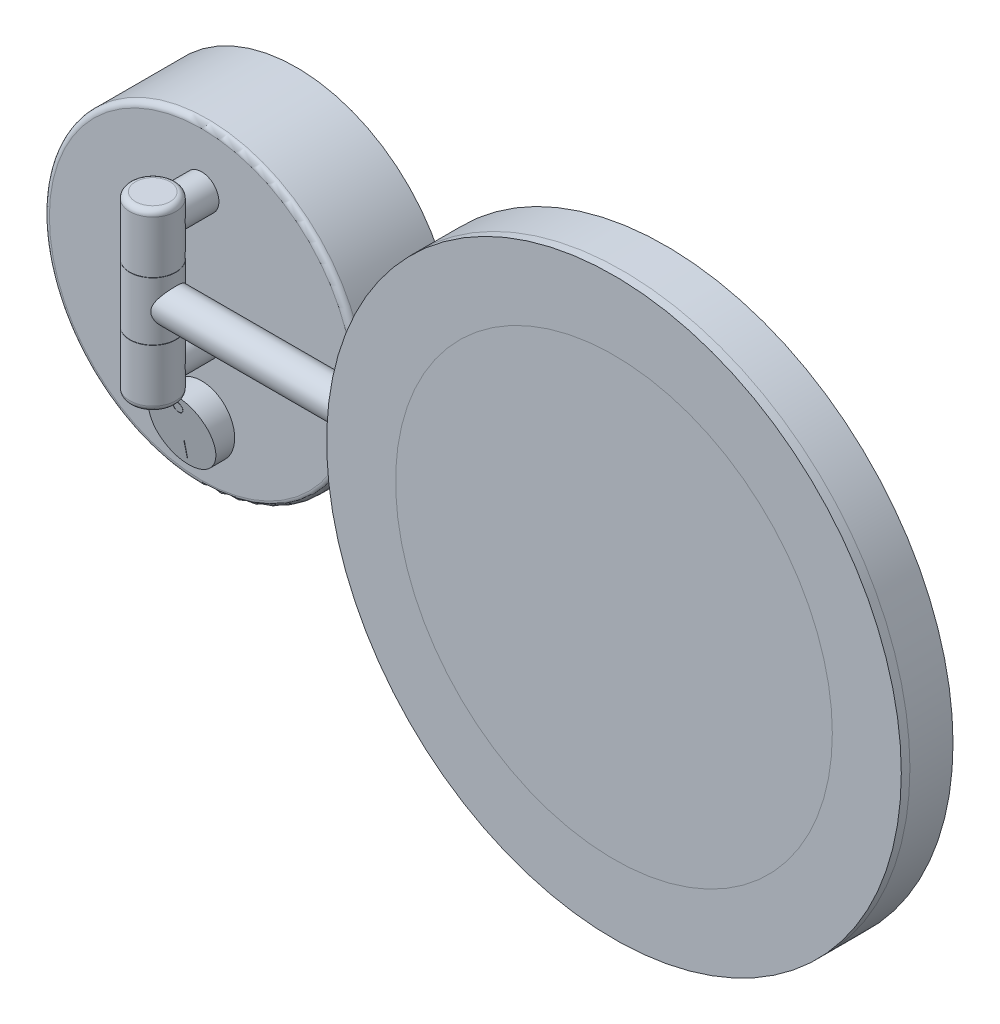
ISO-10303-21;
HEADER;
FILE_DESCRIPTION(('STEP AP214'),'2;1');
FILE_NAME('part.step','',(''),(''),'','','');
FILE_SCHEMA(('AUTOMOTIVE_DESIGN { 1 0 10303 214 1 1 1 1 }'));
ENDSEC;
DATA;
#1=APPLICATION_CONTEXT('core data for automotive mechanical design processes');
#2=APPLICATION_PROTOCOL_DEFINITION('international standard','automotive_design',2000,#1);
#3=PRODUCT_CONTEXT('',#1,'mechanical');
#4=PRODUCT('Part','Part','',(#3));
#5=PRODUCT_RELATED_PRODUCT_CATEGORY('part','',(#4));
#6=PRODUCT_DEFINITION_FORMATION('','',#4);
#7=PRODUCT_DEFINITION_CONTEXT('part definition',#1,'design');
#8=PRODUCT_DEFINITION('design','',#6,#7);
#9=PRODUCT_DEFINITION_SHAPE('','',#8);
#10=(LENGTH_UNIT() NAMED_UNIT(*) SI_UNIT(.MILLI.,.METRE.));
#11=(NAMED_UNIT(*) PLANE_ANGLE_UNIT() SI_UNIT($,.RADIAN.));
#12=(NAMED_UNIT(*) SI_UNIT($,.STERADIAN.) SOLID_ANGLE_UNIT());
#13=UNCERTAINTY_MEASURE_WITH_UNIT(LENGTH_MEASURE(1.E-05),#10,'distance_accuracy_value','');
#14=(GEOMETRIC_REPRESENTATION_CONTEXT(3) GLOBAL_UNCERTAINTY_ASSIGNED_CONTEXT((#13)) GLOBAL_UNIT_ASSIGNED_CONTEXT((#10,
#11,#12)) REPRESENTATION_CONTEXT('',''));
#15=CARTESIAN_POINT('',(0.,0.,0.));
#16=DIRECTION('',(0.,0.,1.));
#17=DIRECTION('',(1.,0.,0.));
#18=AXIS2_PLACEMENT_3D('',#15,#16,#17);
#19=CARTESIAN_POINT('',(200.,37.,304.46046148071));
#20=DIRECTION('',(0.,0.,-1.));
#21=DIRECTION('',(-1.,0.,0.));
#22=AXIS2_PLACEMENT_3D('',#19,#20,#21);
#23=CYLINDRICAL_SURFACE('',#22,76.);
#24=CARTESIAN_POINT('',(200.,37.,86.5));
#25=DIRECTION('',(0.,0.,1.));
#26=DIRECTION('',(1.,0.,0.));
#27=AXIS2_PLACEMENT_3D('',#24,#25,#26);
#28=CIRCLE('',#27,76.);
#29=CARTESIAN_POINT('',(276.,37.,86.5));
#30=VERTEX_POINT('',#29);
#31=EDGE_CURVE('E74',#30,#30,#28,.T.);
#32=ORIENTED_EDGE('',*,*,#31,.T.);
#33=EDGE_LOOP('',(#32));
#34=FACE_BOUND('',#33,.T.);
#35=CARTESIAN_POINT('',(200.,37.,89.5));
#36=DIRECTION('',(0.,0.,1.));
#37=DIRECTION('',(1.,0.,0.));
#38=AXIS2_PLACEMENT_3D('',#35,#36,#37);
#39=CIRCLE('',#38,76.);
#40=CARTESIAN_POINT('',(276.,37.,89.5));
#41=VERTEX_POINT('',#40);
#42=EDGE_CURVE('E12',#41,#41,#39,.T.);
#43=ORIENTED_EDGE('',*,*,#42,.F.);
#44=EDGE_LOOP('',(#43));
#45=FACE_BOUND('',#44,.T.);
#46=ADVANCED_FACE('F67',(#34,#45),#23,.T.);
#47=CARTESIAN_POINT('',(200.,37.,86.5));
#48=DIRECTION('',(0.,0.,1.));
#49=DIRECTION('',(1.,0.,0.));
#50=AXIS2_PLACEMENT_3D('',#47,#48,#49);
#51=PLANE('',#50);
#52=ORIENTED_EDGE('',*,*,#31,.F.);
#53=EDGE_LOOP('',(#52));
#54=FACE_BOUND('',#53,.T.);
#55=ADVANCED_FACE('F82',(#54),#51,.F.);
#56=CARTESIAN_POINT('',(200.,37.,89.5));
#57=DIRECTION('',(0.,0.,1.));
#58=DIRECTION('',(1.,0.,0.));
#59=AXIS2_PLACEMENT_3D('',#56,#57,#58);
#60=PLANE('',#59);
#61=ORIENTED_EDGE('',*,*,#42,.T.);
#62=EDGE_LOOP('',(#61));
#63=FACE_BOUND('',#62,.T.);
#64=ADVANCED_FACE('F69',(#63),#60,.T.);
#65=CLOSED_SHELL('',(#46,#55,#64));
#66=MANIFOLD_SOLID_BREP('B2',#65);
#67=CARTESIAN_POINT('',(200.,37.,89.5));
#68=DIRECTION('',(0.,0.,1.));
#69=DIRECTION('',(1.,0.,0.));
#70=AXIS2_PLACEMENT_3D('',#67,#68,#69);
#71=PLANE('',#70);
#72=CARTESIAN_POINT('',(200.,37.,89.5));
#73=DIRECTION('',(0.,0.,1.));
#74=DIRECTION('',(1.,0.,0.));
#75=AXIS2_PLACEMENT_3D('',#72,#73,#74);
#76=CIRCLE('',#75,100.);
#77=CARTESIAN_POINT('',(300.,37.,89.5));
#78=VERTEX_POINT('',#77);
#79=EDGE_CURVE('E66',#78,#78,#76,.T.);
#80=ORIENTED_EDGE('',*,*,#79,.T.);
#81=EDGE_LOOP('',(#80));
#82=FACE_BOUND('',#81,.T.);
#83=CARTESIAN_POINT('',(200.,37.,89.5));
#84=DIRECTION('',(0.,0.,1.));
#85=DIRECTION('',(1.,0.,0.));
#86=AXIS2_PLACEMENT_3D('',#83,#84,#85);
#87=CIRCLE('',#86,76.);
#88=CARTESIAN_POINT('',(276.,37.,89.5));
#89=VERTEX_POINT('',#88);
#90=EDGE_CURVE('E129',#89,#89,#87,.T.);
#91=ORIENTED_EDGE('',*,*,#90,.F.);
#92=EDGE_LOOP('',(#91));
#93=FACE_BOUND('',#92,.T.);
#94=ADVANCED_FACE('F118',(#82,#93),#71,.T.);
#95=CARTESIAN_POINT('',(200.,37.,86.5));
#96=DIRECTION('',(0.,0.,1.));
#97=DIRECTION('',(1.,0.,0.));
#98=AXIS2_PLACEMENT_3D('',#95,#96,#97);
#99=PLANE('',#98);
#100=CARTESIAN_POINT('',(200.,37.,86.5));
#101=DIRECTION('',(0.,0.,1.));
#102=DIRECTION('',(1.,0.,0.));
#103=AXIS2_PLACEMENT_3D('',#100,#101,#102);
#104=CIRCLE('',#103,100.);
#105=CARTESIAN_POINT('',(300.,37.,86.5));
#106=VERTEX_POINT('',#105);
#107=EDGE_CURVE('E122',#106,#106,#104,.T.);
#108=ORIENTED_EDGE('',*,*,#107,.F.);
#109=EDGE_LOOP('',(#108));
#110=FACE_BOUND('',#109,.T.);
#111=CARTESIAN_POINT('',(200.,37.,86.5));
#112=DIRECTION('',(0.,0.,1.));
#113=DIRECTION('',(1.,0.,0.));
#114=AXIS2_PLACEMENT_3D('',#111,#112,#113);
#115=CIRCLE('',#114,76.);
#116=CARTESIAN_POINT('',(276.,37.,86.5));
#117=VERTEX_POINT('',#116);
#118=EDGE_CURVE('E131',#117,#117,#115,.T.);
#119=ORIENTED_EDGE('',*,*,#118,.T.);
#120=EDGE_LOOP('',(#119));
#121=FACE_BOUND('',#120,.T.);
#122=ADVANCED_FACE('F141',(#110,#121),#99,.F.);
#123=CARTESIAN_POINT('',(200.,37.,89.5));
#124=DIRECTION('',(0.,0.,-1.));
#125=DIRECTION('',(-1.,0.,0.));
#126=AXIS2_PLACEMENT_3D('',#123,#124,#125);
#127=CYLINDRICAL_SURFACE('',#126,100.);
#128=ORIENTED_EDGE('',*,*,#79,.F.);
#129=EDGE_LOOP('',(#128));
#130=FACE_BOUND('',#129,.T.);
#131=ORIENTED_EDGE('',*,*,#107,.T.);
#132=EDGE_LOOP('',(#131));
#133=FACE_BOUND('',#132,.T.);
#134=ADVANCED_FACE('F120',(#130,#133),#127,.T.);
#135=CARTESIAN_POINT('',(200.,37.,89.5));
#136=DIRECTION('',(0.,0.,-1.));
#137=DIRECTION('',(-1.,0.,0.));
#138=AXIS2_PLACEMENT_3D('',#135,#136,#137);
#139=CYLINDRICAL_SURFACE('',#138,76.);
#140=ORIENTED_EDGE('',*,*,#90,.T.);
#141=EDGE_LOOP('',(#140));
#142=FACE_BOUND('',#141,.T.);
#143=ORIENTED_EDGE('',*,*,#118,.F.);
#144=EDGE_LOOP('',(#143));
#145=FACE_BOUND('',#144,.T.);
#146=ADVANCED_FACE('F137',(#142,#145),#139,.F.);
#147=CLOSED_SHELL('',(#94,#122,#134,#146));
#148=MANIFOLD_SOLID_BREP('B7',#147);
#149=CARTESIAN_POINT('',(231.,37.,55.5));
#150=DIRECTION('',(-1.,0.,0.));
#151=DIRECTION('',(0.,0.,1.));
#152=AXIS2_PLACEMENT_3D('',#149,#150,#151);
#153=CYLINDRICAL_SURFACE('',#152,8.);
#154=CARTESIAN_POINT('',(229.,37.,55.5));
#155=DIRECTION('',(-1.,0.,0.));
#156=DIRECTION('',(0.,0.,1.));
#157=AXIS2_PLACEMENT_3D('',#154,#155,#156);
#158=CIRCLE('',#157,8.);
#159=CARTESIAN_POINT('',(229.,37.,63.5));
#160=VERTEX_POINT('',#159);
#161=EDGE_CURVE('E790',#160,#160,#158,.T.);
#162=ORIENTED_EDGE('',*,*,#161,.T.);
#163=EDGE_LOOP('',(#162));
#164=FACE_BOUND('',#163,.T.);
#165=CARTESIAN_POINT('',(227.166666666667,37.,63.5));
#166=CARTESIAN_POINT('',(227.166666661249,36.8445510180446,63.4999999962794));
#167=CARTESIAN_POINT('',(227.161081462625,36.6891021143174,63.4954600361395));
#168=CARTESIAN_POINT('',(227.13884086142,36.3794635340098,63.4774053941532));
#169=CARTESIAN_POINT('',(227.12218087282,36.2252744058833,63.463886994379));
#170=CARTESIAN_POINT('',(227.078060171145,35.9192779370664,63.4281649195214));
#171=CARTESIAN_POINT('',(227.050585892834,35.7674738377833,63.4059503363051));
#172=CARTESIAN_POINT('',(226.985291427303,35.467498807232,63.3533207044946));
#173=CARTESIAN_POINT('',(226.947466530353,35.3193295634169,63.3229019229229));
#174=CARTESIAN_POINT('',(226.862347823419,35.0286268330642,63.2547287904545));
#175=CARTESIAN_POINT('',(226.81512032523,34.8860618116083,63.2170258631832));
#176=CARTESIAN_POINT('',(226.711672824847,34.6062183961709,63.1348620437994));
#177=CARTESIAN_POINT('',(226.655448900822,34.4689423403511,63.0903982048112));
#178=CARTESIAN_POINT('',(226.474289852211,34.0660475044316,62.948010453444));
#179=CARTESIAN_POINT('',(226.336788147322,33.8090967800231,62.8410259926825));
#180=CARTESIAN_POINT('',(226.082344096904,33.4002143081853,62.6466902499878));
#181=CARTESIAN_POINT('',(225.973005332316,33.2410787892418,62.5640857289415));
#182=CARTESIAN_POINT('',(225.742496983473,32.9352029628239,62.3926127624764));
#183=CARTESIAN_POINT('',(225.621327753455,32.7884622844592,62.3037445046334));
#184=CARTESIAN_POINT('',(225.367820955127,32.507215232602,62.1214098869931));
#185=CARTESIAN_POINT('',(225.235453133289,32.372744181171,62.0279313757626));
#186=CARTESIAN_POINT('',(224.960540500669,32.1165643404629,61.8385657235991));
#187=CARTESIAN_POINT('',(224.817996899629,31.9948540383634,61.7426788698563));
#188=CARTESIAN_POINT('',(224.520634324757,31.7623330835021,61.5489764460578));
#189=CARTESIAN_POINT('',(224.365650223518,31.651738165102,61.4511553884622));
#190=CARTESIAN_POINT('',(224.045562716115,31.4439681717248,61.2576609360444));
#191=CARTESIAN_POINT('',(223.880456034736,31.3467974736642,61.1619882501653));
#192=CARTESIAN_POINT('',(223.54038636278,31.1665914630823,60.9761339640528));
#193=CARTESIAN_POINT('',(223.365450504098,31.0835195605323,60.8859385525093));
#194=CARTESIAN_POINT('',(223.005191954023,30.9320940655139,60.714744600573));
#195=CARTESIAN_POINT('',(222.819878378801,30.8637278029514,60.6337381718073));
#196=CARTESIAN_POINT('',(222.413903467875,30.7351783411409,60.4763075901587));
#197=CARTESIAN_POINT('',(222.191756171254,30.6771677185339,60.4018021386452));
#198=CARTESIAN_POINT('',(221.849890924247,30.6075434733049,60.3101950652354));
#199=CARTESIAN_POINT('',(221.734576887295,30.5872419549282,60.2830295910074));
#200=CARTESIAN_POINT('',(221.50151623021,30.5527617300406,60.2364501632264));
#201=CARTESIAN_POINT('',(221.383770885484,30.5385798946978,60.2170322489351));
#202=CARTESIAN_POINT('',(221.145329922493,30.516531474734,60.1866828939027));
#203=CARTESIAN_POINT('',(221.024616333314,30.5087324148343,60.175842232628));
#204=CARTESIAN_POINT('',(220.78246381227,30.4999026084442,60.1635601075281));
#205=CARTESIAN_POINT('',(220.661024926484,30.4988714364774,60.1621180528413));
#206=CARTESIAN_POINT('',(220.418478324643,30.5036068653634,60.1687141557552));
#207=CARTESIAN_POINT('',(220.297370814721,30.5093770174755,60.1767572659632));
#208=CARTESIAN_POINT('',(220.056607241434,30.5275653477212,60.201895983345));
#209=CARTESIAN_POINT('',(219.93695137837,30.5399844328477,60.2189928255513));
#210=CARTESIAN_POINT('',(219.684303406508,30.5732379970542,60.2642015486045));
#211=CARTESIAN_POINT('',(219.551637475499,30.5949673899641,60.2934701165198));
#212=CARTESIAN_POINT('',(219.290051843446,30.6460471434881,60.3609739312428));
#213=CARTESIAN_POINT('',(219.161134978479,30.6754031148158,60.3992157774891));
#214=CARTESIAN_POINT('',(218.907259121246,30.7412677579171,60.4830829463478));
#215=CARTESIAN_POINT('',(218.7823107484,30.7777940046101,60.5287263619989));
#216=CARTESIAN_POINT('',(218.536901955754,30.8574643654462,60.6257388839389));
#217=CARTESIAN_POINT('',(218.416440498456,30.900606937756,60.677106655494));
#218=CARTESIAN_POINT('',(218.117328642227,31.0176417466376,60.8125390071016));
#219=CARTESIAN_POINT('',(217.941628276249,31.0957227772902,60.899518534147));
#220=CARTESIAN_POINT('',(217.600251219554,31.2655890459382,61.0795951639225));
#221=CARTESIAN_POINT('',(217.43457967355,31.3573812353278,61.1726953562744));
#222=CARTESIAN_POINT('',(217.112854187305,31.5542659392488,61.3619668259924));
#223=CARTESIAN_POINT('',(216.956812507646,31.659374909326,61.458141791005));
#224=CARTESIAN_POINT('',(216.654587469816,31.8825303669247,61.6508736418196));
#225=CARTESIAN_POINT('',(216.508402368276,32.0005745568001,61.7474304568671));
#226=CARTESIAN_POINT('',(216.221217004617,32.2538547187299,61.9420881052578));
#227=CARTESIAN_POINT('',(216.080574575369,32.3895462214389,62.0401256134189));
#228=CARTESIAN_POINT('',(215.810757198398,32.6746490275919,62.2320781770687));
#229=CARTESIAN_POINT('',(215.681583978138,32.8240623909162,62.3259926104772));
#230=CARTESIAN_POINT('',(215.436025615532,33.1361000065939,62.5073371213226));
#231=CARTESIAN_POINT('',(215.319613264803,33.2986948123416,62.594780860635));
#232=CARTESIAN_POINT('',(215.100640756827,33.6369793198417,62.761238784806));
#233=CARTESIAN_POINT('',(214.998074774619,33.8126634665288,62.8402565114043));
#234=CARTESIAN_POINT('',(214.834718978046,34.12591603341,62.9672460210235));
#235=CARTESIAN_POINT('',(214.770231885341,34.2605430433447,63.017750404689));
#236=CARTESIAN_POINT('',(214.650006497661,34.535788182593,63.1124125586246));
#237=CARTESIAN_POINT('',(214.594266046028,34.6764048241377,63.156571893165));
#238=CARTESIAN_POINT('',(214.492235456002,34.9629633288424,63.2377416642));
#239=CARTESIAN_POINT('',(214.445940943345,35.1089026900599,63.2747554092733));
#240=CARTESIAN_POINT('',(214.363429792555,35.4053605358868,63.3409302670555));
#241=CARTESIAN_POINT('',(214.32721338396,35.5558791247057,63.3700912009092));
#242=CARTESIAN_POINT('',(214.265255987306,35.8614117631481,63.4200834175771));
#243=CARTESIAN_POINT('',(214.239580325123,36.0164476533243,63.4408627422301));
#244=CARTESIAN_POINT('',(214.19948370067,36.3289167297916,63.4733504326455));
#245=CARTESIAN_POINT('',(214.185062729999,36.4863499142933,63.4850588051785));
#246=CARTESIAN_POINT('',(214.167751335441,36.8022292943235,63.4991171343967));
#247=CARTESIAN_POINT('',(214.16485810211,36.9606752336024,63.5014693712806));
#248=CARTESIAN_POINT('',(214.170651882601,37.2772075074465,63.4967621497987));
#249=CARTESIAN_POINT('',(214.179338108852,37.435293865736,63.4897033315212));
#250=CARTESIAN_POINT('',(214.206755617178,37.7348377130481,63.4674584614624));
#251=CARTESIAN_POINT('',(214.224458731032,37.876453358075,63.4531045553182));
#252=CARTESIAN_POINT('',(214.268951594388,38.1573551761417,63.417107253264));
#253=CARTESIAN_POINT('',(214.295744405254,38.2966405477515,63.3954614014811));
#254=CARTESIAN_POINT('',(214.358030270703,38.5719466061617,63.3452885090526));
#255=CARTESIAN_POINT('',(214.393521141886,38.7079681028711,63.3167631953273));
#256=CARTESIAN_POINT('',(214.472745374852,38.9760846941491,63.2533284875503));
#257=CARTESIAN_POINT('',(214.516481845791,39.108178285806,63.2184166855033));
#258=CARTESIAN_POINT('',(214.663660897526,39.5094585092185,63.1014725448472));
#259=CARTESIAN_POINT('',(214.780214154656,39.7711121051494,63.0095621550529));
#260=CARTESIAN_POINT('',(215.042423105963,40.2707316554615,62.8058394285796));
#261=CARTESIAN_POINT('',(215.188086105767,40.5086916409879,62.6940220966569));
#262=CARTESIAN_POINT('',(215.460835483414,40.8973246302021,62.4889189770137));
#263=CARTESIAN_POINT('',(215.582014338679,41.0540055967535,62.3989934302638));
#264=CARTESIAN_POINT('',(215.836373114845,41.3539577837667,62.2137267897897));
#265=CARTESIAN_POINT('',(215.969557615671,41.4972238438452,62.1183836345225));
#266=CARTESIAN_POINT('',(216.247559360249,41.770710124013,61.9240624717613));
#267=CARTESIAN_POINT('',(216.392421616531,41.9008750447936,61.8250712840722));
#268=CARTESIAN_POINT('',(216.692763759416,42.1474111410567,61.626111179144));
#269=CARTESIAN_POINT('',(216.848242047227,42.2637843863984,61.5261424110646));
#270=CARTESIAN_POINT('',(217.17229416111,42.4843786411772,61.3261568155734));
#271=CARTESIAN_POINT('',(217.341040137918,42.5883706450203,61.2261657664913));
#272=CARTESIAN_POINT('',(217.689608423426,42.7815970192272,61.0310024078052));
#273=CARTESIAN_POINT('',(217.869436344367,42.8708238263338,60.9358325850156));
#274=CARTESIAN_POINT('',(218.239469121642,43.0331820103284,60.7550348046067));
#275=CARTESIAN_POINT('',(218.429610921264,43.1063998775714,60.6693568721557));
#276=CARTESIAN_POINT('',(218.821057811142,43.2358790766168,60.5123988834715));
#277=CARTESIAN_POINT('',(219.022345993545,43.2921653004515,60.441097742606));
#278=CARTESIAN_POINT('',(219.442577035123,43.3874347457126,60.317373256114));
#279=CARTESIAN_POINT('',(219.661882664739,43.4257886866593,60.2656471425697));
#280=CARTESIAN_POINT('',(219.996288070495,43.4663158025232,60.2103344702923));
#281=CARTESIAN_POINT('',(220.108602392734,43.4769896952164,60.1956116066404));
#282=CARTESIAN_POINT('',(220.334375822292,43.492484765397,60.174165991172));
#283=CARTESIAN_POINT('',(220.44783443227,43.4973083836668,60.1674399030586));
#284=CARTESIAN_POINT('',(220.675470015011,43.5009948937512,60.162303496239));
#285=CARTESIAN_POINT('',(220.789648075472,43.4998349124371,60.1639250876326));
#286=CARTESIAN_POINT('',(221.017356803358,43.4915328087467,60.1754734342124));
#287=CARTESIAN_POINT('',(221.130887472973,43.4843907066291,60.185400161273));
#288=CARTESIAN_POINT('',(221.356609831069,43.4642735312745,60.2131153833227));
#289=CARTESIAN_POINT('',(221.468799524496,43.4512906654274,60.230914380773));
#290=CARTESIAN_POINT('',(221.691048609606,43.4197560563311,60.2736190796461));
#291=CARTESIAN_POINT('',(221.801106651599,43.4012009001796,60.2985291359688));
#292=CARTESIAN_POINT('',(222.203731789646,43.3227316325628,60.4022464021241));
#293=CARTESIAN_POINT('',(222.48826960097,43.2461574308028,60.5006522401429));
#294=CARTESIAN_POINT('',(222.897827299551,43.1067953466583,60.6684042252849));
#295=CARTESIAN_POINT('',(223.031715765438,43.0561350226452,60.7278143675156));
#296=CARTESIAN_POINT('',(223.293991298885,42.9470397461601,60.8515899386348));
#297=CARTESIAN_POINT('',(223.422378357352,42.8886047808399,60.9159553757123));
#298=CARTESIAN_POINT('',(223.730994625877,42.7359923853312,61.0781537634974));
#299=CARTESIAN_POINT('',(223.908178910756,42.6376640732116,61.1778683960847));
#300=CARTESIAN_POINT('',(224.251376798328,42.4259107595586,61.3805619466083));
#301=CARTESIAN_POINT('',(224.417385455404,42.3124791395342,61.4835422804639));
#302=CARTESIAN_POINT('',(224.738093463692,42.0708747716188,61.6896233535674));
#303=CARTESIAN_POINT('',(224.892797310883,41.9427079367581,61.7927240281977));
#304=CARTESIAN_POINT('',(225.190529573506,41.6717401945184,61.9964271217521));
#305=CARTESIAN_POINT('',(225.333561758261,41.5289440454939,62.0970303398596));
#306=CARTESIAN_POINT('',(225.584145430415,41.2540479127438,62.2768231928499));
#307=CARTESIAN_POINT('',(225.69361788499,41.1241896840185,62.3567680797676));
#308=CARTESIAN_POINT('',(225.903256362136,40.8545149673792,62.5119114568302));
#309=CARTESIAN_POINT('',(226.003424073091,40.7147002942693,62.5871108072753));
#310=CARTESIAN_POINT('',(226.193509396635,40.4254812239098,62.7313321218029));
#311=CARTESIAN_POINT('',(226.283437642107,40.2760870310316,62.8003604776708));
#312=CARTESIAN_POINT('',(226.452138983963,39.96801802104,62.930937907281));
#313=CARTESIAN_POINT('',(226.530914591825,39.8093453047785,62.9924886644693));
#314=CARTESIAN_POINT('',(226.66305687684,39.5129006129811,63.0964035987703));
#315=CARTESIAN_POINT('',(226.718442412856,39.3765366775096,63.1402246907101));
#316=CARTESIAN_POINT('',(226.82033928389,39.0986203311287,63.2211870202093));
#317=CARTESIAN_POINT('',(226.866852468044,38.9570690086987,63.2583296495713));
#318=CARTESIAN_POINT('',(226.950322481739,38.6697337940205,63.3251969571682));
#319=CARTESIAN_POINT('',(226.987295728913,38.5239576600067,63.3549343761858));
#320=CARTESIAN_POINT('',(227.051225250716,38.2288966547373,63.4064676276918));
#321=CARTESIAN_POINT('',(227.07818538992,38.079613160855,63.4282665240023));
#322=CARTESIAN_POINT('',(227.122033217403,37.7759918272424,63.463767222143));
#323=CARTESIAN_POINT('',(227.138742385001,37.6216112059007,63.4773254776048));
#324=CARTESIAN_POINT('',(227.161060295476,37.3114872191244,63.4954428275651));
#325=CARTESIAN_POINT('',(227.166666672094,37.1557435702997,63.5000000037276));
#326=CARTESIAN_POINT('',(227.166666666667,37.,63.5));
#327=B_SPLINE_CURVE_WITH_KNOTS('',3,(#165,#166,#167,#168,#169,#170,#171,#172,#173,#174,#175,
#176,#177,#178,#179,#180,#181,#182,#183,#184,#185,#186,#187,#188,#189,#190,#191,#192,#193,#194,
#195,#196,#197,#198,#199,#200,#201,#202,#203,#204,#205,#206,#207,#208,#209,#210,#211,#212,#213,
#214,#215,#216,#217,#218,#219,#220,#221,#222,#223,#224,#225,#226,#227,#228,#229,#230,#231,#232,
#233,#234,#235,#236,#237,#238,#239,#240,#241,#242,#243,#244,#245,#246,#247,#248,#249,#250,#251,
#252,#253,#254,#255,#256,#257,#258,#259,#260,#261,#262,#263,#264,#265,#266,#267,#268,#269,#270,
#271,#272,#273,#274,#275,#276,#277,#278,#279,#280,#281,#282,#283,#284,#285,#286,#287,#288,#289,
#290,#291,#292,#293,#294,#295,#296,#297,#298,#299,#300,#301,#302,#303,#304,#305,#306,#307,#308,
#309,#310,#311,#312,#313,#314,#315,#316,#317,#318,#319,#320,#321,#322,#323,#324,#325,#326),
.UNSPECIFIED.,.T.,.F.,(4,2,2,2,2,2,2,2,2,2,2,2,2,2,2,2,2,2,2,2,2,2,2,2,2,2,2,2,2,2,2,2,2,2,2,2,
2,2,2,2,2,2,2,2,2,2,2,2,2,2,2,2,2,2,2,2,2,2,2,2,2,2,2,2,2,2,2,2,2,2,2,2,2,2,2,2,2,2,2,2,4),(0.,
0.466181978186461,0.932557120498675,1.39951914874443,1.86669400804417,2.33068392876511,
2.79487667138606,3.72241850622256,4.35174293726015,4.98104853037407,5.61211210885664,
6.24310078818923,6.88461712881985,7.52634214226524,8.1663753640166,8.80585491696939,
9.52731306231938,9.8875500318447,10.2476026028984,10.6114167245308,10.9752079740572,
11.3391892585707,11.7032202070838,12.1153366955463,12.5277572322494,12.9412015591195,
13.3545496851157,13.9866897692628,14.6191514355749,15.2524023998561,15.8855410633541,
16.5407279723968,17.1960133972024,17.8498732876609,18.5034572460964,18.9757845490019,
19.4479952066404,19.9199866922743,20.3919889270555,20.8668737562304,21.34175823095,
21.8165269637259,22.291263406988,22.7210828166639,23.1510471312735,23.5809036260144,
24.0109225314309,24.9097305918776,25.808764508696,26.4605592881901,27.1126037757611,
27.7672942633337,28.4218863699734,29.0871485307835,29.7527504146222,30.4146622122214,
31.0755960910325,31.758245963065,32.0992037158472,32.4400191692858,32.7821383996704,
33.1242564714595,33.4668323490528,33.8096184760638,34.7355465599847,35.2003263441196,
35.6651068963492,36.341746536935,37.0186836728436,37.6953501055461,38.3717971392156,
38.9344482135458,39.496996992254,40.0589561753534,40.6207886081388,41.0810402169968,
41.5411957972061,42.0005541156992,42.4597349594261,42.9267008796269,43.3937663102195),.UNSPECIFIED.);
#328=CARTESIAN_POINT('',(227.166666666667,37.,63.5));
#329=VERTEX_POINT('',#328);
#330=EDGE_CURVE('E428',#329,#329,#327,.T.);
#331=ORIENTED_EDGE('',*,*,#330,.T.);
#332=EDGE_LOOP('',(#331));
#333=FACE_BOUND('',#332,.T.);
#334=CARTESIAN_POINT('',(209.76666666,37.,55.5));
#335=DIRECTION('',(-1.,0.,0.));
#336=DIRECTION('',(0.,0.,1.));
#337=AXIS2_PLACEMENT_3D('',#334,#335,#336);
#338=CIRCLE('',#337,8.);
#339=CARTESIAN_POINT('',(209.76666666,37.,63.5));
#340=VERTEX_POINT('',#339);
#341=EDGE_CURVE('E507',#340,#340,#338,.F.);
#342=ORIENTED_EDGE('',*,*,#341,.T.);
#343=EDGE_LOOP('',(#342));
#344=FACE_BOUND('',#343,.T.);
#345=ADVANCED_FACE('F179',(#164,#333,#344),#153,.T.);
#346=CARTESIAN_POINT('',(209.66666666,37.,55.5));
#347=DIRECTION('',(-1.,0.,0.));
#348=DIRECTION('',(0.,0.,1.));
#349=AXIS2_PLACEMENT_3D('',#346,#347,#348);
#350=CIRCLE('',#349,8.);
#351=CARTESIAN_POINT('',(209.66666666,37.,63.5));
#352=VERTEX_POINT('',#351);
#353=EDGE_CURVE('E511',#352,#352,#350,.F.);
#354=ORIENTED_EDGE('',*,*,#353,.F.);
#355=EDGE_LOOP('',(#354));
#356=FACE_BOUND('',#355,.T.);
#357=CARTESIAN_POINT('',(200.,29.4006579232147,58.));
#358=CARTESIAN_POINT('',(200.221905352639,29.4006580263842,58.0000000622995));
#359=CARTESIAN_POINT('',(200.443809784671,29.3975993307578,57.9907594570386));
#360=CARTESIAN_POINT('',(200.885923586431,29.3856187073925,57.9538888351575));
#361=CARTESIAN_POINT('',(201.106132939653,29.37669672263,57.926258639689));
#362=CARTESIAN_POINT('',(201.543325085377,29.3537227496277,57.8528532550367));
#363=CARTESIAN_POINT('',(201.760306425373,29.3396685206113,57.8070701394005));
#364=CARTESIAN_POINT('',(202.18944439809,29.3075926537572,57.6977506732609));
#365=CARTESIAN_POINT('',(202.401600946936,29.2895709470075,57.6342140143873));
#366=CARTESIAN_POINT('',(202.819239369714,29.2511084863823,57.4900323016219));
#367=CARTESIAN_POINT('',(203.02473535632,29.2306733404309,57.4094265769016));
#368=CARTESIAN_POINT('',(203.428309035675,29.1891057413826,57.2315507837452));
#369=CARTESIAN_POINT('',(203.626386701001,29.1679732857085,57.1342806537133));
#370=CARTESIAN_POINT('',(204.013996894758,29.1269558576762,56.9236188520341));
#371=CARTESIAN_POINT('',(204.203526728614,29.1070712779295,56.8102221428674));
#372=CARTESIAN_POINT('',(204.572886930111,29.0706513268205,56.5679153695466));
#373=CARTESIAN_POINT('',(204.752712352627,29.054117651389,56.4389975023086));
#374=CARTESIAN_POINT('',(205.105220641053,29.026327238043,56.1634300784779));
#375=CARTESIAN_POINT('',(205.277655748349,29.015196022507,56.0164499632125));
#376=CARTESIAN_POINT('',(205.609524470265,29.0012259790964,55.7082806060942));
#377=CARTESIAN_POINT('',(205.76896634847,28.998381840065,55.5471005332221));
#378=CARTESIAN_POINT('',(206.073377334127,29.0034313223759,55.2120302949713));
#379=CARTESIAN_POINT('',(206.218361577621,29.0113135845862,55.0381537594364));
#380=CARTESIAN_POINT('',(206.492604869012,29.0401631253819,54.6794247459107));
#381=CARTESIAN_POINT('',(206.62186732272,29.0611275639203,54.4945746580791));
#382=CARTESIAN_POINT('',(206.84854220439,29.1147332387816,54.1395913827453));
#383=CARTESIAN_POINT('',(206.947916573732,29.1456210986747,53.9704445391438));
#384=CARTESIAN_POINT('',(207.132947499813,29.2202417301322,53.6275332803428));
#385=CARTESIAN_POINT('',(207.218605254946,29.2639733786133,53.4537692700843));
#386=CARTESIAN_POINT('',(207.375773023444,29.3650656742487,53.1039835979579));
#387=CARTESIAN_POINT('',(207.447293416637,29.4224162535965,52.9279636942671));
#388=CARTESIAN_POINT('',(207.576262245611,29.5511821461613,52.5759235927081));
#389=CARTESIAN_POINT('',(207.633712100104,29.622596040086,52.3999033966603));
#390=CARTESIAN_POINT('',(207.727766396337,29.7683270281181,52.0750981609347));
#391=CARTESIAN_POINT('',(207.766172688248,29.840790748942,51.9259961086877));
#392=CARTESIAN_POINT('',(207.833449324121,29.9958481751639,51.6309398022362));
#393=CARTESIAN_POINT('',(207.862319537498,30.0784420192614,51.4849855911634));
#394=CARTESIAN_POINT('',(207.911210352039,30.2533820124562,51.1975048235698));
#395=CARTESIAN_POINT('',(207.931230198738,30.3457289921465,51.05597864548));
#396=CARTESIAN_POINT('',(207.963259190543,30.5396724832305,50.7784714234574));
#397=CARTESIAN_POINT('',(207.97526783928,30.6412695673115,50.6424907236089));
#398=CARTESIAN_POINT('',(207.992507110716,30.856754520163,50.3724889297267));
#399=CARTESIAN_POINT('',(207.997492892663,30.9709431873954,50.2386924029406));
#400=CARTESIAN_POINT('',(208.001028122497,31.2079468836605,49.9788514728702));
#401=CARTESIAN_POINT('',(207.999575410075,31.3307647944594,49.8528096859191));
#402=CARTESIAN_POINT('',(207.987277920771,31.7111428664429,49.4873884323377));
#403=CARTESIAN_POINT('',(207.968498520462,31.9807081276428,49.2606120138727));
#404=CARTESIAN_POINT('',(207.915037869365,32.5912230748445,48.8121072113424));
#405=CARTESIAN_POINT('',(207.878316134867,32.9367264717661,48.5968130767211));
#406=CARTESIAN_POINT('',(207.821140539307,33.4760185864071,48.3150946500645));
#407=CARTESIAN_POINT('',(207.801717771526,33.6594347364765,48.2280090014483));
#408=CARTESIAN_POINT('',(207.763644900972,34.0324035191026,48.0680087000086));
#409=CARTESIAN_POINT('',(207.744994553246,34.2219541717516,47.9950895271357));
#410=CARTESIAN_POINT('',(207.707905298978,34.6272069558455,47.8566646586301));
#411=CARTESIAN_POINT('',(207.689711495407,34.8435058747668,47.7928359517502));
#412=CARTESIAN_POINT('',(207.657517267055,35.28103630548,47.6836068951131));
#413=CARTESIAN_POINT('',(207.643517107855,35.5022681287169,47.638207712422));
#414=CARTESIAN_POINT('',(207.620916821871,35.9479474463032,47.5662676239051));
#415=CARTESIAN_POINT('',(207.612314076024,36.1723933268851,47.5397175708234));
#416=CARTESIAN_POINT('',(207.60123712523,36.6228714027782,47.5057027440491));
#417=CARTESIAN_POINT('',(207.598762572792,36.8489035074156,47.4982368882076));
#418=CARTESIAN_POINT('',(207.600127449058,37.2928261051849,47.5023888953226));
#419=CARTESIAN_POINT('',(207.603748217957,37.5107237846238,47.5133458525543));
#420=CARTESIAN_POINT('',(207.616598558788,37.94472807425,47.5529897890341));
#421=CARTESIAN_POINT('',(207.625828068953,38.1608347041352,47.5816765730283));
#422=CARTESIAN_POINT('',(207.649163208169,38.5897987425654,47.6565336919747));
#423=CARTESIAN_POINT('',(207.66327050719,38.8026550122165,47.7027100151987));
#424=CARTESIAN_POINT('',(207.695234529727,39.2236316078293,47.8121675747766));
#425=CARTESIAN_POINT('',(207.713091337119,39.4317518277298,47.8754491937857));
#426=CARTESIAN_POINT('',(207.751093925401,39.8417410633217,48.018582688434));
#427=CARTESIAN_POINT('',(207.771237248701,40.0436164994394,48.0984168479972));
#428=CARTESIAN_POINT('',(207.812158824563,40.4402275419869,48.2742195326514));
#429=CARTESIAN_POINT('',(207.832937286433,40.6349607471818,48.3701934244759));
#430=CARTESIAN_POINT('',(207.873270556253,41.0161679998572,48.5777523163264));
#431=CARTESIAN_POINT('',(207.892824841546,41.2026385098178,48.6893439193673));
#432=CARTESIAN_POINT('',(207.928697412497,41.5661202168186,48.9274998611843));
#433=CARTESIAN_POINT('',(207.94501543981,41.743130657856,49.0540653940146));
#434=CARTESIAN_POINT('',(207.972838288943,42.0932651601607,49.3266878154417));
#435=CARTESIAN_POINT('',(207.984128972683,42.2659637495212,49.4733148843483));
#436=CARTESIAN_POINT('',(207.998476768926,42.5984123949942,49.7808206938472));
#437=CARTESIAN_POINT('',(208.001538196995,42.7581691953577,49.9416919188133));
#438=CARTESIAN_POINT('',(207.99697831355,43.0632427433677,50.276183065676));
#439=CARTESIAN_POINT('',(207.989368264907,43.2085745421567,50.4497893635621));
#440=CARTESIAN_POINT('',(207.961114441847,43.483543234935,50.8080267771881));
#441=CARTESIAN_POINT('',(207.940473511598,43.6131835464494,50.9926554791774));
#442=CARTESIAN_POINT('',(207.887487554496,43.8407128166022,51.3474705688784));
#443=CARTESIAN_POINT('',(207.856877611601,43.9405458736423,51.5166709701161));
#444=CARTESIAN_POINT('',(207.782807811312,44.1264755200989,51.859753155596));
#445=CARTESIAN_POINT('',(207.739349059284,44.2125732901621,52.0336345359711));
#446=CARTESIAN_POINT('',(207.638786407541,44.370590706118,52.3837119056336));
#447=CARTESIAN_POINT('',(207.581692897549,44.4425210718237,52.5599060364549));
#448=CARTESIAN_POINT('',(207.453413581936,44.5722727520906,52.9123488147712));
#449=CARTESIAN_POINT('',(207.382229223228,44.6300955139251,53.0885974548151));
#450=CARTESIAN_POINT('',(207.236941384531,44.7247681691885,53.4137553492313));
#451=CARTESIAN_POINT('',(207.164703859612,44.7634334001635,53.5629770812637));
#452=CARTESIAN_POINT('',(207.010083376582,44.8312056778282,53.8583035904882));
#453=CARTESIAN_POINT('',(206.927700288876,44.8603126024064,54.004408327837));
#454=CARTESIAN_POINT('',(206.75316304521,44.9096512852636,54.2922161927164));
#455=CARTESIAN_POINT('',(206.661008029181,44.9298822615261,54.4339189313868));
#456=CARTESIAN_POINT('',(206.467428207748,44.9623057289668,54.711799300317));
#457=CARTESIAN_POINT('',(206.366002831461,44.9744977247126,54.8479765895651));
#458=CARTESIAN_POINT('',(206.150963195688,44.9920712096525,55.1182459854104));
#459=CARTESIAN_POINT('',(206.037057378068,44.997214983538,55.2521214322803));
#460=CARTESIAN_POINT('',(205.800615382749,45.0010483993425,55.5121483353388));
#461=CARTESIAN_POINT('',(205.678076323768,44.9997358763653,55.6382971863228));
#462=CARTESIAN_POINT('',(205.298528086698,44.9878280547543,56.0040771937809));
#463=CARTESIAN_POINT('',(205.029506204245,44.9692674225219,56.2311442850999));
#464=CARTESIAN_POINT('',(204.420214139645,44.9161804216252,56.6803173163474));
#465=CARTESIAN_POINT('',(204.075394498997,44.8796008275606,56.8960164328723));
#466=CARTESIAN_POINT('',(203.537100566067,44.8225311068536,57.1784507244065));
#467=CARTESIAN_POINT('',(203.3540123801,44.803125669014,57.2657934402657));
#468=CARTESIAN_POINT('',(202.981687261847,44.7650508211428,57.4263442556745));
#469=CARTESIAN_POINT('',(202.792452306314,44.7463811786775,57.4995568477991));
#470=CARTESIAN_POINT('',(202.387689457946,44.7091984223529,57.6386937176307));
#471=CARTESIAN_POINT('',(202.17155811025,44.6909281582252,57.702931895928));
#472=CARTESIAN_POINT('',(201.734329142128,44.6585469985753,57.8129968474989));
#473=CARTESIAN_POINT('',(201.513231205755,44.6444363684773,57.8588224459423));
#474=CARTESIAN_POINT('',(201.067781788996,44.6215903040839,57.9316294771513));
#475=CARTESIAN_POINT('',(200.843431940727,44.6128522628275,57.9586200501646));
#476=CARTESIAN_POINT('',(200.393104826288,44.6014911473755,57.993526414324));
#477=CARTESIAN_POINT('',(200.167127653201,44.5988677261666,58.0014432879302));
#478=CARTESIAN_POINT('',(199.723161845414,44.5999395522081,57.9981824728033));
#479=CARTESIAN_POINT('',(199.505167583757,44.6034191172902,57.9876565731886));
#480=CARTESIAN_POINT('',(199.070932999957,44.6160033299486,57.9488584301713));
#481=CARTESIAN_POINT('',(198.854692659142,44.6251079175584,57.9205863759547));
#482=CARTESIAN_POINT('',(198.425429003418,44.6482188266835,57.846539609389));
#483=CARTESIAN_POINT('',(198.212406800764,44.6622268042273,57.800758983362));
#484=CARTESIAN_POINT('',(197.791069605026,44.6940251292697,57.6920715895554));
#485=CARTESIAN_POINT('',(197.582754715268,44.7118155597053,57.6291644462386));
#486=CARTESIAN_POINT('',(197.172486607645,44.7497109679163,57.4868041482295));
#487=CARTESIAN_POINT('',(196.97052305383,44.7698119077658,57.4073796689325));
#488=CARTESIAN_POINT('',(196.573703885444,44.8106900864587,57.2323947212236));
#489=CARTESIAN_POINT('',(196.378850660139,44.8314675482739,57.1368288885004));
#490=CARTESIAN_POINT('',(195.997370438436,44.8718459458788,56.9300824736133));
#491=CARTESIAN_POINT('',(195.810746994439,44.8914463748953,56.8188952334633));
#492=CARTESIAN_POINT('',(195.446925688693,44.9274632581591,56.5815418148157));
#493=CARTESIAN_POINT('',(195.269728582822,44.9438794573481,56.4553744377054));
#494=CARTESIAN_POINT('',(194.919088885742,44.9719669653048,56.1834851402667));
#495=CARTESIAN_POINT('',(194.746075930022,44.9834235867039,56.0371850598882));
#496=CARTESIAN_POINT('',(194.412969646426,44.9981585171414,55.7303001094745));
#497=CARTESIAN_POINT('',(194.252869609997,45.0014410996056,55.5697227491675));
#498=CARTESIAN_POINT('',(193.947079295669,44.997376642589,55.2357755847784));
#499=CARTESIAN_POINT('',(193.801374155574,44.990040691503,55.0624193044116));
#500=CARTESIAN_POINT('',(193.52563222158,44.9623832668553,54.7046290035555));
#501=CARTESIAN_POINT('',(193.395592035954,44.9420646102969,54.5201973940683));
#502=CARTESIAN_POINT('',(193.16718433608,44.889696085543,54.1655239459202));
#503=CARTESIAN_POINT('',(193.066888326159,44.8593650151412,53.9962687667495));
#504=CARTESIAN_POINT('',(192.880051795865,44.7858478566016,53.6530127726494));
#505=CARTESIAN_POINT('',(192.793510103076,44.7426628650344,53.4790123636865));
#506=CARTESIAN_POINT('',(192.63463481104,44.6426308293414,53.1286377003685));
#507=CARTESIAN_POINT('',(192.562290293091,44.5857943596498,52.9522653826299));
#508=CARTESIAN_POINT('',(192.431748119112,44.4580009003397,52.5994115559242));
#509=CARTESIAN_POINT('',(192.373548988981,44.3870453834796,52.422930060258));
#510=CARTESIAN_POINT('',(192.278253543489,44.2421996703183,52.0974142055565));
#511=CARTESIAN_POINT('',(192.239328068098,44.1701883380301,51.9480719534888));
#512=CARTESIAN_POINT('',(192.171057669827,44.0160046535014,51.6524734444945));
#513=CARTESIAN_POINT('',(192.14171286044,43.9338321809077,51.5062172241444));
#514=CARTESIAN_POINT('',(192.091924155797,43.7596973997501,51.2180805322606));
#515=CARTESIAN_POINT('',(192.071481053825,43.6677342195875,51.0762004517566));
#516=CARTESIAN_POINT('',(192.038661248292,43.4745176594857,50.7979453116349));
#517=CARTESIAN_POINT('',(192.026285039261,43.3732637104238,50.6615705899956));
#518=CARTESIAN_POINT('',(192.00837612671,43.1586687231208,50.3910328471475));
#519=CARTESIAN_POINT('',(192.003073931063,43.0450454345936,50.2570785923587));
#520=CARTESIAN_POINT('',(191.998941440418,42.8091644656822,49.9968659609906));
#521=CARTESIAN_POINT('',(192.000113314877,42.6869039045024,49.8706101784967));
#522=CARTESIAN_POINT('',(192.011630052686,42.3081843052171,49.504471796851));
#523=CARTESIAN_POINT('',(192.02997092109,42.0397048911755,49.277114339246));
#524=CARTESIAN_POINT('',(192.082681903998,41.4316351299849,48.8272755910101));
#525=CARTESIAN_POINT('',(192.119117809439,41.0874997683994,48.6111735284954));
#526=CARTESIAN_POINT('',(192.176079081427,40.5502051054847,48.3280264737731));
#527=CARTESIAN_POINT('',(192.195466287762,40.3674453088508,48.2404277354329));
#528=CARTESIAN_POINT('',(192.233541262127,39.9957648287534,48.0793285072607));
#529=CARTESIAN_POINT('',(192.252229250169,39.8068461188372,48.0058235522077));
#530=CARTESIAN_POINT('',(192.289503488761,39.4025758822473,47.8659766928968));
#531=CARTESIAN_POINT('',(192.307849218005,39.1866142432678,47.8013298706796));
#532=CARTESIAN_POINT('',(192.340415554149,38.7496911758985,47.6904303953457));
#533=CARTESIAN_POINT('',(192.354635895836,38.5287294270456,47.6441789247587));
#534=CARTESIAN_POINT('',(192.377726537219,38.0835146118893,47.5705057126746));
#535=CARTESIAN_POINT('',(192.386599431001,37.8592631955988,47.5430748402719));
#536=CARTESIAN_POINT('',(192.398244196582,37.4090919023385,47.507277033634));
#537=CARTESIAN_POINT('',(192.401016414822,37.1831721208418,47.4989090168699));
#538=CARTESIAN_POINT('',(192.400238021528,36.7391659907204,47.5012776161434));
#539=CARTESIAN_POINT('',(192.396900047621,36.5210755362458,47.511371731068));
#540=CARTESIAN_POINT('',(192.384582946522,36.0866113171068,47.5493226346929));
#541=CARTESIAN_POINT('',(192.375603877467,35.8702375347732,47.5771792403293));
#542=CARTESIAN_POINT('',(192.352718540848,35.4406746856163,47.6504142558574));
#543=CARTESIAN_POINT('',(192.338810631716,35.2274867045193,47.6957985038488));
#544=CARTESIAN_POINT('',(192.307179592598,34.8057891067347,47.8037144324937));
#545=CARTESIAN_POINT('',(192.289456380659,34.5972795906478,47.8662464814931));
#546=CARTESIAN_POINT('',(192.251669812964,34.1867328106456,48.0078329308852));
#547=CARTESIAN_POINT('',(192.231612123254,33.9846813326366,48.0868476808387));
#548=CARTESIAN_POINT('',(192.190779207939,33.5876544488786,48.2610148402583));
#549=CARTESIAN_POINT('',(192.170003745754,33.3926814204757,48.3561726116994));
#550=CARTESIAN_POINT('',(192.1295823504,33.010928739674,48.5621065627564));
#551=CARTESIAN_POINT('',(192.10993690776,32.8241526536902,48.6728894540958));
#552=CARTESIAN_POINT('',(192.073778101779,32.4599924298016,48.9094403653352));
#553=CARTESIAN_POINT('',(192.057264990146,32.2826090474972,49.0352095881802));
#554=CARTESIAN_POINT('',(192.028915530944,31.9314665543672,49.3063639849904));
#555=CARTESIAN_POINT('',(192.017294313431,31.7581411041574,49.4523351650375));
#556=CARTESIAN_POINT('',(192.002174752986,31.4243807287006,49.7585950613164));
#557=CARTESIAN_POINT('',(191.998672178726,31.263939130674,49.9188762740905));
#558=CARTESIAN_POINT('',(192.002243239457,30.9574351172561,50.2522745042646));
#559=CARTESIAN_POINT('',(192.009305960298,30.8113580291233,50.4253781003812));
#560=CARTESIAN_POINT('',(192.036368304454,30.5348452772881,50.7827155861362));
#561=CARTESIAN_POINT('',(192.056365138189,30.4044062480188,50.9669470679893));
#562=CARTESIAN_POINT('',(192.108116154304,30.1751200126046,51.3214739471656));
#563=CARTESIAN_POINT('',(192.138167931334,30.0743600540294,51.4907822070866));
#564=CARTESIAN_POINT('',(192.21113129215,29.8866144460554,51.8342088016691));
#565=CARTESIAN_POINT('',(192.254041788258,29.7996276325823,52.0083267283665));
#566=CARTESIAN_POINT('',(192.353541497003,29.6398918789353,52.3589959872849));
#567=CARTESIAN_POINT('',(192.410119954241,29.5671318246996,52.5355453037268));
#568=CARTESIAN_POINT('',(192.537425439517,29.4357962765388,52.8888081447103));
#569=CARTESIAN_POINT('',(192.608150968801,29.3772192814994,53.0655216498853));
#570=CARTESIAN_POINT('',(192.752553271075,29.2812982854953,53.3913953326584));
#571=CARTESIAN_POINT('',(192.82433834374,29.2421113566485,53.5408587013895));
#572=CARTESIAN_POINT('',(192.978085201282,29.1733405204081,53.8367305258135));
#573=CARTESIAN_POINT('',(193.060047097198,29.143756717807,53.9831389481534));
#574=CARTESIAN_POINT('',(193.233779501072,29.0935159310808,54.2716057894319));
#575=CARTESIAN_POINT('',(193.325550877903,29.0728597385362,54.4136638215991));
#576=CARTESIAN_POINT('',(193.518404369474,29.0396417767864,54.6922950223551));
#577=CARTESIAN_POINT('',(193.61948705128,29.0270805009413,54.8288678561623));
#578=CARTESIAN_POINT('',(193.833637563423,29.0088349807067,55.099674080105));
#579=CARTESIAN_POINT('',(193.946978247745,29.0033739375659,55.2337065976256));
#580=CARTESIAN_POINT('',(194.182298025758,28.9989414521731,55.4941039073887));
#581=CARTESIAN_POINT('',(194.30428000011,28.9999721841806,55.620466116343));
#582=CARTESIAN_POINT('',(194.682172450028,29.0110963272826,55.9869631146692));
#583=CARTESIAN_POINT('',(194.95011117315,29.0292164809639,56.2146114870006));
#584=CARTESIAN_POINT('',(195.556966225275,29.0815496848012,56.6651186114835));
#585=CARTESIAN_POINT('',(195.900423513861,29.1178411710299,56.8816251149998));
#586=CARTESIAN_POINT('',(196.436722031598,29.1746919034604,57.1654821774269));
#587=CARTESIAN_POINT('',(196.619150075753,29.1940596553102,57.2533340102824));
#588=CARTESIAN_POINT('',(196.990178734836,29.2321321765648,57.4149761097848));
#589=CARTESIAN_POINT('',(197.178777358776,29.2508371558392,57.4887708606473));
#590=CARTESIAN_POINT('',(197.580460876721,29.2880074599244,57.6285977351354));
#591=CARTESIAN_POINT('',(197.794099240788,29.306259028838,57.6931001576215));
#592=CARTESIAN_POINT('',(198.226323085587,29.3387657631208,57.8040918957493));
#593=CARTESIAN_POINT('',(198.444908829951,29.353020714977,57.8505802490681));
#594=CARTESIAN_POINT('',(198.885381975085,29.376330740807,57.9251179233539));
#595=CARTESIAN_POINT('',(199.107267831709,29.3853881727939,57.9531756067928));
#596=CARTESIAN_POINT('',(199.552769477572,29.397551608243,57.9906162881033));
#597=CARTESIAN_POINT('',(199.776385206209,29.4006578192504,57.9999999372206));
#598=CARTESIAN_POINT('',(200.,29.4006579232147,58.));
#599=B_SPLINE_CURVE_WITH_KNOTS('',3,(#357,#358,#359,#360,#361,#362,#363,#364,#365,#366,#367,
#368,#369,#370,#371,#372,#373,#374,#375,#376,#377,#378,#379,#380,#381,#382,#383,#384,#385,#386,
#387,#388,#389,#390,#391,#392,#393,#394,#395,#396,#397,#398,#399,#400,#401,#402,#403,#404,#405,
#406,#407,#408,#409,#410,#411,#412,#413,#414,#415,#416,#417,#418,#419,#420,#421,#422,#423,#424,
#425,#426,#427,#428,#429,#430,#431,#432,#433,#434,#435,#436,#437,#438,#439,#440,#441,#442,#443,
#444,#445,#446,#447,#448,#449,#450,#451,#452,#453,#454,#455,#456,#457,#458,#459,#460,#461,#462,
#463,#464,#465,#466,#467,#468,#469,#470,#471,#472,#473,#474,#475,#476,#477,#478,#479,#480,#481,
#482,#483,#484,#485,#486,#487,#488,#489,#490,#491,#492,#493,#494,#495,#496,#497,#498,#499,#500,
#501,#502,#503,#504,#505,#506,#507,#508,#509,#510,#511,#512,#513,#514,#515,#516,#517,#518,#519,
#520,#521,#522,#523,#524,#525,#526,#527,#528,#529,#530,#531,#532,#533,#534,#535,#536,#537,#538,
#539,#540,#541,#542,#543,#544,#545,#546,#547,#548,#549,#550,#551,#552,#553,#554,#555,#556,#557,
#558,#559,#560,#561,#562,#563,#564,#565,#566,#567,#568,#569,#570,#571,#572,#573,#574,#575,#576,
#577,#578,#579,#580,#581,#582,#583,#584,#585,#586,#587,#588,#589,#590,#591,#592,#593,#594,#595,
#596,#597,#598),.UNSPECIFIED.,.T.,.F.,(4,2,2,2,2,2,2,2,2,2,2,2,2,2,2,2,2,2,2,2,2,2,2,2,2,2,2,2,
2,2,2,2,2,2,2,2,2,2,2,2,2,2,2,2,2,2,2,2,2,2,2,2,2,2,2,2,2,2,2,2,2,2,2,2,2,2,2,2,2,2,2,2,2,2,2,2,
2,2,2,2,2,2,2,2,2,2,2,2,2,2,2,2,2,2,2,2,2,2,2,2,2,2,2,2,2,2,2,2,2,2,2,2,2,2,2,2,2,2,2,2,4),(0.,
0.665502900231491,1.33101227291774,1.99681256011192,2.66262441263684,3.32691853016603,
3.99121510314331,4.65571964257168,5.32055966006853,6.00018410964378,6.67937289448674,
7.35784298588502,8.03616583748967,8.631056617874,9.22589539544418,9.82029579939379,
10.4146362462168,10.9245514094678,11.4344735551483,11.9444391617,12.4544363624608,
12.9818074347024,13.5093554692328,14.5640670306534,15.7850846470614,16.3965142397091,
17.0077484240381,17.6856744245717,18.3636433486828,19.0412830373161,19.7188843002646,
20.3726920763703,21.0264926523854,21.680517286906,22.3345565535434,22.9878993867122,
23.6414598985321,24.2952975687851,24.9491874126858,25.6287511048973,26.3079583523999,
26.9864492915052,27.6647921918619,28.2603786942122,28.8559139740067,29.4509968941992,
30.0460187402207,30.5561348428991,31.0662574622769,31.5764250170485,32.086624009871,
32.6136388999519,33.1408305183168,34.1948242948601,35.4147222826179,36.0255938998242,
36.6362709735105,37.3140836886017,37.991939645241,38.6694664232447,39.3469547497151,
40.0009802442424,40.6549987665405,41.3092383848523,41.9634923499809,42.6166198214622,
43.2699647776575,43.9235890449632,44.5772656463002,45.2569409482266,45.9362608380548,
46.6148718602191,47.2933356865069,47.8896305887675,48.48587463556,49.081658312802,
49.677379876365,50.1877022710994,50.698030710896,51.2084046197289,51.7188098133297,
52.2454705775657,52.7723078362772,53.8255882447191,55.044365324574,55.6546782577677,
56.2647975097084,56.9424925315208,57.6202311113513,58.2976406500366,58.975011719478,
59.6292565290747,60.2834945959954,60.9379507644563,61.5924209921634,62.2453346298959,
62.8984655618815,63.5518779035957,64.2053427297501,64.8851245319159,65.5645519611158,
66.243278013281,66.9218577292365,67.5188616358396,68.1158150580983,68.7123002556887,
69.3087222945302,69.8192555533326,70.3297943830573,70.8403784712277,71.3509936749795,
71.8773006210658,72.4037838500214,73.4563589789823,74.6740361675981,75.283779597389,
75.8933281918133,76.5642499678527,77.2352075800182,77.905860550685,78.576490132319),.UNSPECIFIED.);
#600=CARTESIAN_POINT('',(200.,29.4006579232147,58.));
#601=VERTEX_POINT('',#600);
#602=EDGE_CURVE('E693',#601,#601,#599,.T.);
#603=ORIENTED_EDGE('',*,*,#602,.T.);
#604=EDGE_LOOP('',(#603));
#605=FACE_BOUND('',#604,.T.);
#606=CARTESIAN_POINT('',(189.43333333,37.,55.5));
#607=DIRECTION('',(-1.,0.,0.));
#608=DIRECTION('',(0.,0.,1.));
#609=AXIS2_PLACEMENT_3D('',#606,#607,#608);
#610=CIRCLE('',#609,8.);
#611=CARTESIAN_POINT('',(189.43333333,37.,63.5));
#612=VERTEX_POINT('',#611);
#613=EDGE_CURVE('E564',#612,#612,#610,.F.);
#614=ORIENTED_EDGE('',*,*,#613,.T.);
#615=EDGE_LOOP('',(#614));
#616=FACE_BOUND('',#615,.T.);
#617=ADVANCED_FACE('F383',(#356,#605,#616),#153,.T.);
#618=CARTESIAN_POINT('',(0.,-18.5,50.));
#619=DIRECTION('',(0.,1.,0.));
#620=DIRECTION('',(0.,0.,1.));
#621=AXIS2_PLACEMENT_3D('',#618,#619,#620);
#622=CYLINDRICAL_SURFACE('',#621,8.);
#623=CARTESIAN_POINT('',(0.,40.5,50.));
#624=DIRECTION('',(0.,1.,0.));
#625=DIRECTION('',(0.,0.,1.));
#626=AXIS2_PLACEMENT_3D('',#623,#624,#625);
#627=CIRCLE('',#626,8.);
#628=CARTESIAN_POINT('',(0.,40.5,58.));
#629=VERTEX_POINT('',#628);
#630=EDGE_CURVE('E674',#629,#629,#627,.F.);
#631=ORIENTED_EDGE('',*,*,#630,.T.);
#632=EDGE_LOOP('',(#631));
#633=FACE_BOUND('',#632,.T.);
#634=CARTESIAN_POINT('',(-6.00000000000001,34.,44.7084973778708));
#635=CARTESIAN_POINT('',(-6.00000675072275,34.1400772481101,44.7085108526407));
#636=CARTESIAN_POINT('',(-5.99508571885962,34.2801068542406,44.7029109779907));
#637=CARTESIAN_POINT('',(-5.9755628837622,34.5586851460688,44.6808951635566));
#638=CARTESIAN_POINT('',(-5.96095785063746,34.6972333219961,44.6644756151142));
#639=CARTESIAN_POINT('',(-5.92241214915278,34.9717536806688,44.6217240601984));
#640=CARTESIAN_POINT('',(-5.89845093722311,35.1077194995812,44.595370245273));
#641=CARTESIAN_POINT('',(-5.84172345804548,35.3758877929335,44.5341051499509));
#642=CARTESIAN_POINT('',(-5.80895177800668,35.5080878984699,44.4991886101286));
#643=CARTESIAN_POINT('',(-5.73570934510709,35.7661758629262,44.4228693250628));
#644=CARTESIAN_POINT('',(-5.69535590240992,35.8921271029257,44.3815669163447));
#645=CARTESIAN_POINT('',(-5.6071707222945,36.1393604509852,44.2935537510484));
#646=CARTESIAN_POINT('',(-5.55934019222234,36.2606433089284,44.2468438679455));
#647=CARTESIAN_POINT('',(-5.40526527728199,36.6172860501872,44.1005884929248));
#648=CARTESIAN_POINT('',(-5.28838261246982,36.8456297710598,43.9948573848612));
#649=CARTESIAN_POINT('',(-5.08007216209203,37.1963261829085,43.8191030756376));
#650=CARTESIAN_POINT('',(-4.99682320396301,37.3249214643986,43.7514697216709));
#651=CARTESIAN_POINT('',(-4.82110471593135,37.5749547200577,43.6149127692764));
#652=CARTESIAN_POINT('',(-4.72863363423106,37.6963914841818,43.5459889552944));
#653=CARTESIAN_POINT('',(-4.43740338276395,38.0500369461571,43.3392171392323));
#654=CARTESIAN_POINT('',(-4.2249499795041,38.2713746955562,43.2014763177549));
#655=CARTESIAN_POINT('',(-3.85676621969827,38.5999755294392,42.9892219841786));
#656=CARTESIAN_POINT('',(-3.7120387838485,38.7176208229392,42.9113318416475));
#657=CARTESIAN_POINT('',(-3.41019332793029,38.9402158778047,42.7612884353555));
#658=CARTESIAN_POINT('',(-3.25307253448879,39.0451627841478,42.6891364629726));
#659=CARTESIAN_POINT('',(-2.92741331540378,39.2408274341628,42.5527608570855));
#660=CARTESIAN_POINT('',(-2.75889726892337,39.3315719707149,42.4885223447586));
#661=CARTESIAN_POINT('',(-2.41116777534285,39.4975751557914,42.3697991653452));
#662=CARTESIAN_POINT('',(-2.23196005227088,39.5728419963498,42.3153093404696));
#663=CARTESIAN_POINT('',(-1.91981679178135,39.6862083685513,42.2326351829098));
#664=CARTESIAN_POINT('',(-1.78923411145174,39.7286701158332,42.2014744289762));
#665=CARTESIAN_POINT('',(-1.52423464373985,39.8047996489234,42.1453813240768));
#666=CARTESIAN_POINT('',(-1.38981878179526,39.8384695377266,42.1204474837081));
#667=CARTESIAN_POINT('',(-1.11803011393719,39.8965504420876,42.0773155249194));
#668=CARTESIAN_POINT('',(-0.980659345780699,39.9209676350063,42.0591129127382));
#669=CARTESIAN_POINT('',(-0.703794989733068,39.9602197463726,42.0298024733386));
#670=CARTESIAN_POINT('',(-0.564301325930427,39.9750543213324,42.018694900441));
#671=CARTESIAN_POINT('',(-0.283857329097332,39.9949342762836,42.003801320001));
#672=CARTESIAN_POINT('',(-0.142904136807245,39.9999539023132,42.0000345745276));
#673=CARTESIAN_POINT('',(0.139006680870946,40.0000454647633,41.999965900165));
#674=CARTESIAN_POINT('',(0.279964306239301,39.995117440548,42.0036639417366));
#675=CARTESIAN_POINT('',(0.56082208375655,39.975391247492,42.0184426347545));
#676=CARTESIAN_POINT('',(0.70072202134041,39.9605911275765,42.0295247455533));
#677=CARTESIAN_POINT('',(0.978397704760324,39.9213513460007,42.0588267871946));
#678=CARTESIAN_POINT('',(1.11617346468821,39.8969117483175,42.0770466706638));
#679=CARTESIAN_POINT('',(1.38395600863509,39.8397562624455,42.1194924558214));
#680=CARTESIAN_POINT('',(1.51406672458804,39.8073556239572,42.1434890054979));
#681=CARTESIAN_POINT('',(1.77073325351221,39.7343118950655,42.1973255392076));
#682=CARTESIAN_POINT('',(1.89728782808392,39.6936659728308,42.2271675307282));
#683=CARTESIAN_POINT('',(2.2705903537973,39.5600501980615,42.3246881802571));
#684=CARTESIAN_POINT('',(2.51117015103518,39.4553602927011,42.4003932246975));
#685=CARTESIAN_POINT('',(2.99690389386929,39.2058750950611,42.5775610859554));
#686=CARTESIAN_POINT('',(3.23973258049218,39.057964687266,42.680925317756));
#687=CARTESIAN_POINT('',(3.69827796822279,38.7330520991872,42.9015849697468));
#688=CARTESIAN_POINT('',(3.91397128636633,38.5560251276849,43.018892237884));
#689=CARTESIAN_POINT('',(4.23586921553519,38.2526303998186,43.2119791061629));
#690=CARTESIAN_POINT('',(4.35128480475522,38.1344292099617,43.2855396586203));
#691=CARTESIAN_POINT('',(4.57172204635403,37.889282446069,43.433649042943));
#692=CARTESIAN_POINT('',(4.67674550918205,37.7623384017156,43.5081977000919));
#693=CARTESIAN_POINT('',(4.87624550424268,37.4999176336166,43.6566800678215));
#694=CARTESIAN_POINT('',(4.97071446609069,37.364434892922,43.7306133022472));
#695=CARTESIAN_POINT('',(5.14869623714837,37.0851795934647,43.8759397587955));
#696=CARTESIAN_POINT('',(5.23221149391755,36.9414088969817,43.9473335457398));
#697=CARTESIAN_POINT('',(5.3724578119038,36.674824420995,44.0717897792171));
#698=CARTESIAN_POINT('',(5.43122281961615,36.553469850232,44.125690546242));
#699=CARTESIAN_POINT('',(5.54105006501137,36.3054629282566,44.2291719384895));
#700=CARTESIAN_POINT('',(5.59210987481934,36.1788089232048,44.2787511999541));
#701=CARTESIAN_POINT('',(5.68595036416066,35.9206248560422,44.3720040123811));
#702=CARTESIAN_POINT('',(5.72874572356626,35.7891039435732,44.415687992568));
#703=CARTESIAN_POINT('',(5.80557907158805,35.5213871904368,44.4956082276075));
#704=CARTESIAN_POINT('',(5.83962333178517,35.3851947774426,44.5318498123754));
#705=CARTESIAN_POINT('',(5.89255136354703,35.1360860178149,44.5889889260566));
#706=CARTESIAN_POINT('',(5.91310189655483,35.0238940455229,44.6115035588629));
#707=CARTESIAN_POINT('',(5.94787197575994,34.7974512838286,44.6499072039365));
#708=CARTESIAN_POINT('',(5.96209457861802,34.6832015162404,44.6657994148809));
#709=CARTESIAN_POINT('',(5.98395670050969,34.4533981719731,44.6903357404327));
#710=CARTESIAN_POINT('',(5.99160219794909,34.337845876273,44.698986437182));
#711=CARTESIAN_POINT('',(6.0001804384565,34.1061689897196,44.7086979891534));
#712=CARTESIAN_POINT('',(6.00111311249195,33.9900443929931,44.7097587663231));
#713=CARTESIAN_POINT('',(5.99624362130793,33.758099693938,44.7042395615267));
#714=CARTESIAN_POINT('',(5.99044041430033,33.6422796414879,44.6976583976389));
#715=CARTESIAN_POINT('',(5.97221961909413,33.4118002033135,44.6771467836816));
#716=CARTESIAN_POINT('',(5.95979971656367,33.2971412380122,44.6632137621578));
#717=CARTESIAN_POINT('',(5.91290246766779,32.9558449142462,44.611135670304));
#718=CARTESIAN_POINT('',(5.86879103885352,32.7320333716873,44.5627161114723));
#719=CARTESIAN_POINT('',(5.73654750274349,32.2145546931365,44.4228890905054));
#720=CARTESIAN_POINT('',(5.63811852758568,31.9260963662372,44.3221748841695));
#721=CARTESIAN_POINT('',(5.46224478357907,31.5127492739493,44.1544434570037));
#722=CARTESIAN_POINT('',(5.39881575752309,31.3780302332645,44.0956703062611));
#723=CARTESIAN_POINT('',(5.26294819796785,31.1149933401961,43.9742505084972));
#724=CARTESIAN_POINT('',(5.19051047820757,30.9866749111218,43.9116042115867));
#725=CARTESIAN_POINT('',(5.03428667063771,30.7321189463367,43.7817497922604));
#726=CARTESIAN_POINT('',(4.95019012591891,30.6061149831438,43.7144586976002));
#727=CARTESIAN_POINT('',(4.77300888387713,30.3611472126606,43.5788737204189));
#728=CARTESIAN_POINT('',(4.67992112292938,30.2421858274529,43.5105795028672));
#729=CARTESIAN_POINT('',(4.38735635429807,29.8960530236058,43.3061561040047));
#730=CARTESIAN_POINT('',(4.17453226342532,29.6795588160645,43.1704468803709));
#731=CARTESIAN_POINT('',(3.80483443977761,29.356966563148,42.9608768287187));
#732=CARTESIAN_POINT('',(3.65854695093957,29.2407621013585,42.8835510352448));
#733=CARTESIAN_POINT('',(3.35362772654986,29.021198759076,42.734884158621));
#734=CARTESIAN_POINT('',(3.19499320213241,28.9178427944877,42.6635444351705));
#735=CARTESIAN_POINT('',(2.86636114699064,28.7255176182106,42.5290255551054));
#736=CARTESIAN_POINT('',(2.69638349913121,28.6365241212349,42.4658326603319));
#737=CARTESIAN_POINT('',(2.34586824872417,28.4742290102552,42.3494481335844));
#738=CARTESIAN_POINT('',(2.16533641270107,28.4009189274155,42.2962511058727));
#739=CARTESIAN_POINT('',(1.8516693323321,28.2912424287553,42.2161077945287));
#740=CARTESIAN_POINT('',(1.72085147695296,28.2504253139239,42.1861016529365));
#741=CARTESIAN_POINT('',(1.45553723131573,28.1776018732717,42.1323628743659));
#742=CARTESIAN_POINT('',(1.32104172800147,28.1455934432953,42.1086287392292));
#743=CARTESIAN_POINT('',(1.04926799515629,28.0908343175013,42.0679193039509));
#744=CARTESIAN_POINT('',(0.911991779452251,28.0680771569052,42.0509392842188));
#745=CARTESIAN_POINT('',(0.635494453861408,28.0321208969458,42.0240713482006));
#746=CARTESIAN_POINT('',(0.49627327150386,28.0189221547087,42.0141836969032));
#747=CARTESIAN_POINT('',(0.216589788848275,28.0022704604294,42.001704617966));
#748=CARTESIAN_POINT('',(0.076125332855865,27.9988406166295,41.9991304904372));
#749=CARTESIAN_POINT('',(-0.204637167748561,28.0018475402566,42.0013856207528));
#750=CARTESIAN_POINT('',(-0.344935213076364,28.0082842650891,42.0062148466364));
#751=CARTESIAN_POINT('',(-0.624324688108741,28.0309241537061,42.0231704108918));
#752=CARTESIAN_POINT('',(-0.763415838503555,28.0471295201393,42.0352983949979));
#753=CARTESIAN_POINT('',(-1.0393457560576,28.0890578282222,42.0665869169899));
#754=CARTESIAN_POINT('',(-1.17618452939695,28.1147807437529,42.0857474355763));
#755=CARTESIAN_POINT('',(-1.44273366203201,28.1744855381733,42.1300426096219));
#756=CARTESIAN_POINT('',(-1.57253537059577,28.2082029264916,42.1549854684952));
#757=CARTESIAN_POINT('',(-1.828474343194,28.2838375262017,42.2106570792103));
#758=CARTESIAN_POINT('',(-1.95461031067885,28.32575759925,42.2413878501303));
#759=CARTESIAN_POINT('',(-2.32651467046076,28.4631181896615,42.3414696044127));
#760=CARTESIAN_POINT('',(-2.56597237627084,28.5702031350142,42.418743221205));
#761=CARTESIAN_POINT('',(-3.05022699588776,28.8251186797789,42.5992975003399));
#762=CARTESIAN_POINT('',(-3.29255596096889,28.9761907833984,42.7045326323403));
#763=CARTESIAN_POINT('',(-3.74966824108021,29.3074787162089,42.928593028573));
#764=CARTESIAN_POINT('',(-3.96442591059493,29.4877213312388,43.0474307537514));
#765=CARTESIAN_POINT('',(-4.28458653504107,29.7964190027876,43.2426255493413));
#766=CARTESIAN_POINT('',(-4.39932520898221,29.9166838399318,43.3169230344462));
#767=CARTESIAN_POINT('',(-4.618279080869,30.1660683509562,43.4663143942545));
#768=CARTESIAN_POINT('',(-4.72249212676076,30.2951898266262,43.5414084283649));
#769=CARTESIAN_POINT('',(-4.920157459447,30.5620299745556,43.6906900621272));
#770=CARTESIAN_POINT('',(-5.01360492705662,30.6997524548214,43.7648772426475));
#771=CARTESIAN_POINT('',(-5.18930377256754,30.9835510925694,43.9103244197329));
#772=CARTESIAN_POINT('',(-5.27155804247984,31.1296250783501,43.9815851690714));
#773=CARTESIAN_POINT('',(-5.46780157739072,31.5154369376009,44.1579988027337));
#774=CARTESIAN_POINT('',(-5.57333215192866,31.7613110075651,44.2594524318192));
#775=CARTESIAN_POINT('',(-5.75222479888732,32.2723604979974,44.4386999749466));
#776=CARTESIAN_POINT('',(-5.82567229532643,32.5374824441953,44.5165565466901));
#777=CARTESIAN_POINT('',(-5.91988344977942,33.0031389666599,44.6187078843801));
#778=CARTESIAN_POINT('',(-5.9497782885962,33.1998352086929,44.6520125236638));
#779=CARTESIAN_POINT('',(-5.98982524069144,33.5977223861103,44.6968904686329));
#780=CARTESIAN_POINT('',(-5.99999030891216,33.7989102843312,44.7084780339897));
#781=CARTESIAN_POINT('',(-6.00000000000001,34.,44.7084973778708));
#782=B_SPLINE_CURVE_WITH_KNOTS('',3,(#634,#635,#636,#637,#638,#639,#640,#641,#642,#643,#644,
#645,#646,#647,#648,#649,#650,#651,#652,#653,#654,#655,#656,#657,#658,#659,#660,#661,#662,#663,
#664,#665,#666,#667,#668,#669,#670,#671,#672,#673,#674,#675,#676,#677,#678,#679,#680,#681,#682,
#683,#684,#685,#686,#687,#688,#689,#690,#691,#692,#693,#694,#695,#696,#697,#698,#699,#700,#701,
#702,#703,#704,#705,#706,#707,#708,#709,#710,#711,#712,#713,#714,#715,#716,#717,#718,#719,#720,
#721,#722,#723,#724,#725,#726,#727,#728,#729,#730,#731,#732,#733,#734,#735,#736,#737,#738,#739,
#740,#741,#742,#743,#744,#745,#746,#747,#748,#749,#750,#751,#752,#753,#754,#755,#756,#757,#758,
#759,#760,#761,#762,#763,#764,#765,#766,#767,#768,#769,#770,#771,#772,#773,#774,#775,#776,#777,
#778,#779,#780,#781),.UNSPECIFIED.,.T.,.F.,(4,2,2,2,2,2,2,2,2,2,2,2,2,2,2,2,2,2,2,2,2,2,2,2,2,2,
2,2,2,2,2,2,2,2,2,2,2,2,2,2,2,2,2,2,2,2,2,2,2,2,2,2,2,2,2,2,2,2,2,2,2,2,2,2,2,2,2,2,2,2,2,2,2,
4),(0.,0.419957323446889,0.840054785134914,1.26107989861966,1.68236426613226,2.097599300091,
2.51276735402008,3.34248975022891,3.84451042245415,4.34661571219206,5.35160860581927,
5.9572838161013,6.56309495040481,7.16774907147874,7.7720823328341,8.19407681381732,
8.61597026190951,9.03758154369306,9.45920793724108,9.88193918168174,10.3046687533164,
10.7274818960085,11.1502922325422,11.5584889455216,11.9668260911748,12.7829064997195,
13.6873496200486,14.5925668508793,15.1346453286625,15.6766292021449,16.2189993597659,
16.7612481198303,17.196550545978,17.6319898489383,18.0666484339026,18.500994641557,
18.8494289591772,19.1976947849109,19.5456437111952,19.893596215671,20.2416025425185,
20.5897306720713,21.2864173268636,22.2438713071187,22.7238291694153,23.2037437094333,
23.7006087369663,24.197643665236,25.1914292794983,25.7973105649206,26.4033291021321,
27.0083119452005,27.6129672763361,28.0334017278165,28.4537356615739,28.8737753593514,
29.2938307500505,29.7148789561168,30.1359253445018,30.5570667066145,30.9782069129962,
31.3869895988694,31.7959151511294,32.6131708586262,33.5230047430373,34.4336788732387,
34.9794296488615,35.5252917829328,36.0713973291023,36.6173615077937,37.4729635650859,
38.3262734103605,38.9295448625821,39.5324200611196),.UNSPECIFIED.);
#783=CARTESIAN_POINT('',(-6.00000000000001,34.,44.7084973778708));
#784=VERTEX_POINT('',#783);
#785=EDGE_CURVE('E280',#784,#784,#782,.T.);
#786=ORIENTED_EDGE('',*,*,#785,.F.);
#787=EDGE_LOOP('',(#786));
#788=FACE_BOUND('',#787,.T.);
#789=CARTESIAN_POINT('',(0.,22.26666666,50.));
#790=DIRECTION('',(0.,-1.,0.));
#791=DIRECTION('',(0.,0.,-1.));
#792=AXIS2_PLACEMENT_3D('',#789,#790,#791);
#793=CIRCLE('',#792,8.);
#794=CARTESIAN_POINT('',(0.,22.26666666,42.));
#795=VERTEX_POINT('',#794);
#796=EDGE_CURVE('E547',#795,#795,#793,.F.);
#797=ORIENTED_EDGE('',*,*,#796,.T.);
#798=EDGE_LOOP('',(#797));
#799=FACE_BOUND('',#798,.T.);
#800=ADVANCED_FACE('F316',(#633,#788,#799),#622,.T.);
#801=CARTESIAN_POINT('',(0.,22.16666666,50.));
#802=DIRECTION('',(0.,-1.,0.));
#803=DIRECTION('',(0.,0.,-1.));
#804=AXIS2_PLACEMENT_3D('',#801,#802,#803);
#805=CIRCLE('',#804,8.);
#806=CARTESIAN_POINT('',(0.,22.16666666,42.));
#807=VERTEX_POINT('',#806);
#808=EDGE_CURVE('E543',#807,#807,#805,.F.);
#809=ORIENTED_EDGE('',*,*,#808,.F.);
#810=EDGE_LOOP('',(#809));
#811=FACE_BOUND('',#810,.T.);
#812=CARTESIAN_POINT('',(5.29150262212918,12.,56.));
#813=CARTESIAN_POINT('',(5.29148914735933,12.1400772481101,56.0000067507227));
#814=CARTESIAN_POINT('',(5.29708902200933,12.2801068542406,55.9950857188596));
#815=CARTESIAN_POINT('',(5.31910483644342,12.5586851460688,55.9755628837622));
#816=CARTESIAN_POINT('',(5.33552438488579,12.697233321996,55.9609578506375));
#817=CARTESIAN_POINT('',(5.37827593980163,12.9717536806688,55.9224121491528));
#818=CARTESIAN_POINT('',(5.40462975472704,13.1077194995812,55.8984509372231));
#819=CARTESIAN_POINT('',(5.46589485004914,13.3758877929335,55.8417234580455));
#820=CARTESIAN_POINT('',(5.50081138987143,13.5080878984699,55.8089517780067));
#821=CARTESIAN_POINT('',(5.57713067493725,13.7661758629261,55.7357093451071));
#822=CARTESIAN_POINT('',(5.61843308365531,13.8921271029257,55.6953559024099));
#823=CARTESIAN_POINT('',(5.70644624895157,14.1393604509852,55.6071707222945));
#824=CARTESIAN_POINT('',(5.75315613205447,14.2606433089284,55.5593401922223));
#825=CARTESIAN_POINT('',(5.89941150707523,14.6172860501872,55.405265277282));
#826=CARTESIAN_POINT('',(6.00514261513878,14.8456297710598,55.2883826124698));
#827=CARTESIAN_POINT('',(6.18089692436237,15.1963261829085,55.080072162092));
#828=CARTESIAN_POINT('',(6.24853027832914,15.3249214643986,54.996823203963));
#829=CARTESIAN_POINT('',(6.38508723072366,15.5749547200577,54.8211047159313));
#830=CARTESIAN_POINT('',(6.45401104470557,15.6963914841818,54.7286336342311));
#831=CARTESIAN_POINT('',(6.66078286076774,16.0500369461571,54.437403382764));
#832=CARTESIAN_POINT('',(6.79852368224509,16.2713746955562,54.2249499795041));
#833=CARTESIAN_POINT('',(7.01077801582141,16.5999755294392,53.8567662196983));
#834=CARTESIAN_POINT('',(7.08866815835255,16.7176208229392,53.7120387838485));
#835=CARTESIAN_POINT('',(7.23871156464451,16.9402158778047,53.4101933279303));
#836=CARTESIAN_POINT('',(7.31086353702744,17.0451627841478,53.2530725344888));
#837=CARTESIAN_POINT('',(7.44723914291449,17.2408274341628,52.9274133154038));
#838=CARTESIAN_POINT('',(7.51147765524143,17.3315719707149,52.7588972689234));
#839=CARTESIAN_POINT('',(7.63020083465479,17.4975751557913,52.4111677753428));
#840=CARTESIAN_POINT('',(7.68469065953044,17.5728419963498,52.2319600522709));
#841=CARTESIAN_POINT('',(7.7673648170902,17.6862083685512,51.9198167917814));
#842=CARTESIAN_POINT('',(7.79852557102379,17.7286701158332,51.7892341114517));
#843=CARTESIAN_POINT('',(7.8546186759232,17.8047996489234,51.5242346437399));
#844=CARTESIAN_POINT('',(7.87955251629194,17.8384695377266,51.3898187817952));
#845=CARTESIAN_POINT('',(7.92268447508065,17.8965504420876,51.1180301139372));
#846=CARTESIAN_POINT('',(7.9408870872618,17.9209676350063,50.9806593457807));
#847=CARTESIAN_POINT('',(7.97019752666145,17.9602197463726,50.7037949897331));
#848=CARTESIAN_POINT('',(7.98130509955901,17.9750543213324,50.5643013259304));
#849=CARTESIAN_POINT('',(7.99619867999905,17.9949342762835,50.2838573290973));
#850=CARTESIAN_POINT('',(7.99996542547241,17.9999539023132,50.1429041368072));
#851=CARTESIAN_POINT('',(8.00003409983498,18.0000454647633,49.860993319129));
#852=CARTESIAN_POINT('',(7.99633605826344,17.995117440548,49.7200356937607));
#853=CARTESIAN_POINT('',(7.9815573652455,17.975391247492,49.4391779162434));
#854=CARTESIAN_POINT('',(7.97047525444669,17.9605911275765,49.2992779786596));
#855=CARTESIAN_POINT('',(7.94117321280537,17.9213513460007,49.0216022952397));
#856=CARTESIAN_POINT('',(7.92295332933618,17.8969117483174,48.8838265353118));
#857=CARTESIAN_POINT('',(7.88050754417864,17.8397562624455,48.6160439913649));
#858=CARTESIAN_POINT('',(7.85651099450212,17.8073556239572,48.485933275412));
#859=CARTESIAN_POINT('',(7.80267446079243,17.7343118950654,48.2292667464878));
#860=CARTESIAN_POINT('',(7.77283246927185,17.6936659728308,48.1027121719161));
#861=CARTESIAN_POINT('',(7.67531181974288,17.5600501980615,47.7294096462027));
#862=CARTESIAN_POINT('',(7.59960677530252,17.4553602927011,47.4888298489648));
#863=CARTESIAN_POINT('',(7.42243891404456,17.2058750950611,47.0030961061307));
#864=CARTESIAN_POINT('',(7.31907468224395,17.0579646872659,46.7602674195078));
#865=CARTESIAN_POINT('',(7.09841503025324,16.7330520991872,46.3017220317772));
#866=CARTESIAN_POINT('',(6.98110776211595,16.5560251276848,46.0860287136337));
#867=CARTESIAN_POINT('',(6.78802089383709,16.2526303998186,45.7641307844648));
#868=CARTESIAN_POINT('',(6.71446034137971,16.1344292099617,45.6487151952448));
#869=CARTESIAN_POINT('',(6.56635095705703,15.889282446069,45.428277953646));
#870=CARTESIAN_POINT('',(6.49180229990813,15.7623384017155,45.3232544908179));
#871=CARTESIAN_POINT('',(6.34331993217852,15.4999176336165,45.1237544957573));
#872=CARTESIAN_POINT('',(6.26938669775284,15.364434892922,45.0292855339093));
#873=CARTESIAN_POINT('',(6.12406024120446,15.0851795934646,44.8513037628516));
#874=CARTESIAN_POINT('',(6.0526664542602,14.9414088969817,44.7677885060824));
#875=CARTESIAN_POINT('',(5.92821022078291,14.6748244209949,44.6275421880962));
#876=CARTESIAN_POINT('',(5.87430945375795,14.553469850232,44.5687771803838));
#877=CARTESIAN_POINT('',(5.77082806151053,14.3054629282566,44.4589499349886));
#878=CARTESIAN_POINT('',(5.72124880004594,14.1788089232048,44.4078901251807));
#879=CARTESIAN_POINT('',(5.62799598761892,13.9206248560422,44.3140496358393));
#880=CARTESIAN_POINT('',(5.58431200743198,13.7891039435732,44.2712542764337));
#881=CARTESIAN_POINT('',(5.50439177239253,13.5213871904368,44.194420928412));
#882=CARTESIAN_POINT('',(5.46815018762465,13.3851947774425,44.1603766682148));
#883=CARTESIAN_POINT('',(5.41101107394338,13.1360860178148,44.107448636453));
#884=CARTESIAN_POINT('',(5.38849644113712,13.0238940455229,44.0868981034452));
#885=CARTESIAN_POINT('',(5.35009279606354,12.7974512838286,44.0521280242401));
#886=CARTESIAN_POINT('',(5.33420058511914,12.6832015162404,44.037905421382));
#887=CARTESIAN_POINT('',(5.30966425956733,12.4533981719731,44.0160432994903));
#888=CARTESIAN_POINT('',(5.301013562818,12.337845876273,44.0083978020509));
#889=CARTESIAN_POINT('',(5.2913020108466,12.1061689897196,43.9998195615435));
#890=CARTESIAN_POINT('',(5.29024123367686,11.9900443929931,43.9988868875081));
#891=CARTESIAN_POINT('',(5.29576043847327,11.7580996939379,44.0037563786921));
#892=CARTESIAN_POINT('',(5.3023416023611,11.6422796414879,44.0095595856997));
#893=CARTESIAN_POINT('',(5.32285321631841,11.4118002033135,44.0277803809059));
#894=CARTESIAN_POINT('',(5.33678623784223,11.2971412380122,44.0402002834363));
#895=CARTESIAN_POINT('',(5.38886432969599,10.9558449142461,44.0870975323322));
#896=CARTESIAN_POINT('',(5.43728388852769,10.7320333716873,44.1312089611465));
#897=CARTESIAN_POINT('',(5.57711090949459,10.2145546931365,44.2634524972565));
#898=CARTESIAN_POINT('',(5.67782511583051,9.92609636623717,44.3618814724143));
#899=CARTESIAN_POINT('',(5.84555654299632,9.51274927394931,44.5377552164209));
#900=CARTESIAN_POINT('',(5.90432969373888,9.37803023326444,44.6011842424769));
#901=CARTESIAN_POINT('',(6.02574949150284,9.11499334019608,44.7370518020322));
#902=CARTESIAN_POINT('',(6.08839578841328,8.98667491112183,44.8094895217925));
#903=CARTESIAN_POINT('',(6.21825020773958,8.7321189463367,44.9657133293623));
#904=CARTESIAN_POINT('',(6.2855413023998,8.60611498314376,45.0498098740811));
#905=CARTESIAN_POINT('',(6.4211262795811,8.36114721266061,45.2269911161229));
#906=CARTESIAN_POINT('',(6.4894204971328,8.24218582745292,45.3200788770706));
#907=CARTESIAN_POINT('',(6.69384389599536,7.89605302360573,45.612643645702));
#908=CARTESIAN_POINT('',(6.82955311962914,7.67955881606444,45.8254677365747));
#909=CARTESIAN_POINT('',(7.03912317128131,7.35696656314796,46.1951655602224));
#910=CARTESIAN_POINT('',(7.11644896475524,7.24076210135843,46.3414530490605));
#911=CARTESIAN_POINT('',(7.26511584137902,7.02119875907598,46.6463722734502));
#912=CARTESIAN_POINT('',(7.33645556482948,6.91784279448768,46.8050067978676));
#913=CARTESIAN_POINT('',(7.47097444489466,6.72551761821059,47.1336388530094));
#914=CARTESIAN_POINT('',(7.53416733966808,6.63652412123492,47.3036165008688));
#915=CARTESIAN_POINT('',(7.65055186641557,6.47422901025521,47.6541317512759));
#916=CARTESIAN_POINT('',(7.70374889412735,6.40091892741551,47.834663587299));
#917=CARTESIAN_POINT('',(7.78389220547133,6.29124242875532,48.1483306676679));
#918=CARTESIAN_POINT('',(7.8138983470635,6.2504253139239,48.2791485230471));
#919=CARTESIAN_POINT('',(7.86763712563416,6.17760187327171,48.5444627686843));
#920=CARTESIAN_POINT('',(7.8913712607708,6.14559344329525,48.6789582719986));
#921=CARTESIAN_POINT('',(7.93208069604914,6.0908343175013,48.9507320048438));
#922=CARTESIAN_POINT('',(7.94906071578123,6.06807715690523,49.0880082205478));
#923=CARTESIAN_POINT('',(7.97592865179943,6.03212089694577,49.3645055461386));
#924=CARTESIAN_POINT('',(7.98581630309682,6.01892215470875,49.5037267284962));
#925=CARTESIAN_POINT('',(7.99829538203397,6.00227046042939,49.7834102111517));
#926=CARTESIAN_POINT('',(8.00086950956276,5.99884061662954,49.9238746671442));
#927=CARTESIAN_POINT('',(7.99861437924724,6.00184754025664,50.2046371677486));
#928=CARTESIAN_POINT('',(7.99378515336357,6.00828426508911,50.3449352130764));
#929=CARTESIAN_POINT('',(7.97682958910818,6.03092415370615,50.6243246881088));
#930=CARTESIAN_POINT('',(7.96470160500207,6.04712952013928,50.7634158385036));
#931=CARTESIAN_POINT('',(7.93341308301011,6.08905782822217,51.0393457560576));
#932=CARTESIAN_POINT('',(7.91425256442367,6.11478074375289,51.176184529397));
#933=CARTESIAN_POINT('',(7.86995739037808,6.17448553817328,51.442733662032));
#934=CARTESIAN_POINT('',(7.84501453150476,6.20820292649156,51.5725353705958));
#935=CARTESIAN_POINT('',(7.78934292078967,6.28383752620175,51.828474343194));
#936=CARTESIAN_POINT('',(7.75861214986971,6.32575759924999,51.9546103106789));
#937=CARTESIAN_POINT('',(7.65853039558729,6.46311818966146,52.3265146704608));
#938=CARTESIAN_POINT('',(7.581256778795,6.57020313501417,52.5659723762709));
#939=CARTESIAN_POINT('',(7.40070249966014,6.82511867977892,53.0502269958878));
#940=CARTESIAN_POINT('',(7.2954673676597,6.97619078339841,53.2925559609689));
#941=CARTESIAN_POINT('',(7.07140697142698,7.30747871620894,53.7496682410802));
#942=CARTESIAN_POINT('',(6.95256924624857,7.48772133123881,53.9644259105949));
#943=CARTESIAN_POINT('',(6.75737445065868,7.79641900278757,54.2845865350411));
#944=CARTESIAN_POINT('',(6.68307696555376,7.91668383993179,54.3993252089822));
#945=CARTESIAN_POINT('',(6.53368560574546,8.16606835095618,54.618279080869));
#946=CARTESIAN_POINT('',(6.45859157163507,8.29518982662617,54.7224921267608));
#947=CARTESIAN_POINT('',(6.3093099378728,8.56202997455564,54.920157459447));
#948=CARTESIAN_POINT('',(6.23512275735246,8.6997524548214,55.0136049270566));
#949=CARTESIAN_POINT('',(6.08967558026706,8.9835510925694,55.1893037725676));
#950=CARTESIAN_POINT('',(6.0184148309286,9.12962507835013,55.2715580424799));
#951=CARTESIAN_POINT('',(5.84200119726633,9.51543693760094,55.4678015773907));
#952=CARTESIAN_POINT('',(5.74054756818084,9.7613110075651,55.5733321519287));
#953=CARTESIAN_POINT('',(5.56130002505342,10.2723604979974,55.7522247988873));
#954=CARTESIAN_POINT('',(5.48344345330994,10.5374824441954,55.8256722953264));
#955=CARTESIAN_POINT('',(5.38129211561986,11.0031389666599,55.9198834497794));
#956=CARTESIAN_POINT('',(5.3479874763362,11.1998352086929,55.9497782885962));
#957=CARTESIAN_POINT('',(5.30310953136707,11.5977223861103,55.9898252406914));
#958=CARTESIAN_POINT('',(5.2915219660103,11.7989102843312,55.9999903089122));
#959=CARTESIAN_POINT('',(5.29150262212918,12.,56.));
#960=B_SPLINE_CURVE_WITH_KNOTS('',3,(#812,#813,#814,#815,#816,#817,#818,#819,#820,#821,#822,
#823,#824,#825,#826,#827,#828,#829,#830,#831,#832,#833,#834,#835,#836,#837,#838,#839,#840,#841,
#842,#843,#844,#845,#846,#847,#848,#849,#850,#851,#852,#853,#854,#855,#856,#857,#858,#859,#860,
#861,#862,#863,#864,#865,#866,#867,#868,#869,#870,#871,#872,#873,#874,#875,#876,#877,#878,#879,
#880,#881,#882,#883,#884,#885,#886,#887,#888,#889,#890,#891,#892,#893,#894,#895,#896,#897,#898,
#899,#900,#901,#902,#903,#904,#905,#906,#907,#908,#909,#910,#911,#912,#913,#914,#915,#916,#917,
#918,#919,#920,#921,#922,#923,#924,#925,#926,#927,#928,#929,#930,#931,#932,#933,#934,#935,#936,
#937,#938,#939,#940,#941,#942,#943,#944,#945,#946,#947,#948,#949,#950,#951,#952,#953,#954,#955,
#956,#957,#958,#959),.UNSPECIFIED.,.T.,.F.,(4,2,2,2,2,2,2,2,2,2,2,2,2,2,2,2,2,2,2,2,2,2,2,2,2,2,
2,2,2,2,2,2,2,2,2,2,2,2,2,2,2,2,2,2,2,2,2,2,2,2,2,2,2,2,2,2,2,2,2,2,2,2,2,2,2,2,2,2,2,2,2,2,2,
4),(0.,0.419957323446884,0.840054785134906,1.26107989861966,1.68236426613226,2.097599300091,
2.51276735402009,3.34248975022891,3.84451042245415,4.34661571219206,5.35160860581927,
5.9572838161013,6.5630949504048,7.16774907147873,7.77208233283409,8.19407681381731,
8.61597026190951,9.03758154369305,9.45920793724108,9.88193918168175,10.3046687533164,
10.7274818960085,11.1502922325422,11.5584889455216,11.9668260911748,12.7829064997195,
13.6873496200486,14.5925668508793,15.1346453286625,15.6766292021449,16.2189993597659,
16.7612481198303,17.196550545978,17.6319898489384,18.0666484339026,18.500994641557,
18.8494289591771,19.1976947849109,19.5456437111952,19.893596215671,20.2416025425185,
20.5897306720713,21.2864173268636,22.2438713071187,22.7238291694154,23.2037437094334,
23.7006087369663,24.197643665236,25.1914292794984,25.7973105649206,26.4033291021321,
27.0083119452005,27.6129672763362,28.0334017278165,28.4537356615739,28.8737753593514,
29.2938307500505,29.7148789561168,30.1359253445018,30.5570667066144,30.9782069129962,
31.3869895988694,31.7959151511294,32.6131708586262,33.5230047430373,34.4336788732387,
34.9794296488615,35.5252917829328,36.0713973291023,36.6173615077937,37.4729635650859,
38.3262734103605,38.9295448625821,39.5324200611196),.UNSPECIFIED.);
#961=CARTESIAN_POINT('',(5.29150262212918,12.,56.));
#962=VERTEX_POINT('',#961);
#963=EDGE_CURVE('E319',#962,#962,#960,.T.);
#964=ORIENTED_EDGE('',*,*,#963,.T.);
#965=EDGE_LOOP('',(#964));
#966=FACE_BOUND('',#965,.T.);
#967=CARTESIAN_POINT('',(0.,1.93333333,50.));
#968=DIRECTION('',(0.,-1.,0.));
#969=DIRECTION('',(0.,0.,-1.));
#970=AXIS2_PLACEMENT_3D('',#967,#968,#969);
#971=CIRCLE('',#970,8.);
#972=CARTESIAN_POINT('',(0.,1.93333333,42.));
#973=VERTEX_POINT('',#972);
#974=EDGE_CURVE('E477',#973,#973,#971,.F.);
#975=ORIENTED_EDGE('',*,*,#974,.T.);
#976=EDGE_LOOP('',(#975));
#977=FACE_BOUND('',#976,.T.);
#978=ADVANCED_FACE('F314',(#811,#966,#977),#622,.T.);
#979=CARTESIAN_POINT('',(0.,1.83333333,50.));
#980=DIRECTION('',(0.,-1.,0.));
#981=DIRECTION('',(0.,0.,-1.));
#982=AXIS2_PLACEMENT_3D('',#979,#980,#981);
#983=CIRCLE('',#982,8.);
#984=CARTESIAN_POINT('',(0.,1.83333333,42.));
#985=VERTEX_POINT('',#984);
#986=EDGE_CURVE('E484',#985,#985,#983,.F.);
#987=ORIENTED_EDGE('',*,*,#986,.F.);
#988=EDGE_LOOP('',(#987));
#989=FACE_BOUND('',#988,.T.);
#990=CARTESIAN_POINT('',(0.,-16.5,50.));
#991=DIRECTION('',(0.,1.,0.));
#992=DIRECTION('',(0.,0.,1.));
#993=AXIS2_PLACEMENT_3D('',#990,#991,#992);
#994=CIRCLE('',#993,8.);
#995=CARTESIAN_POINT('',(0.,-16.5,58.));
#996=VERTEX_POINT('',#995);
#997=EDGE_CURVE('E774',#996,#996,#994,.T.);
#998=ORIENTED_EDGE('',*,*,#997,.T.);
#999=EDGE_LOOP('',(#998));
#1000=FACE_BOUND('',#999,.T.);
#1001=CARTESIAN_POINT('',(-6.00000000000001,-10.,44.7084973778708));
#1002=CARTESIAN_POINT('',(-6.00000675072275,-9.8599227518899,44.7085108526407));
#1003=CARTESIAN_POINT('',(-5.99508571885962,-9.71989314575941,44.7029109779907));
#1004=CARTESIAN_POINT('',(-5.9755628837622,-9.44131485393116,44.6808951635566));
#1005=CARTESIAN_POINT('',(-5.96095785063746,-9.30276667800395,44.6644756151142));
#1006=CARTESIAN_POINT('',(-5.92241214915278,-9.02824631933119,44.6217240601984));
#1007=CARTESIAN_POINT('',(-5.89845093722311,-8.89228050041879,44.595370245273));
#1008=CARTESIAN_POINT('',(-5.84172345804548,-8.62411220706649,44.5341051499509));
#1009=CARTESIAN_POINT('',(-5.80895177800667,-8.49191210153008,44.4991886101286));
#1010=CARTESIAN_POINT('',(-5.73570934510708,-8.23382413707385,44.4228693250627));
#1011=CARTESIAN_POINT('',(-5.69535590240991,-8.10787289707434,44.3815669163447));
#1012=CARTESIAN_POINT('',(-5.6071707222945,-7.86063954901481,44.2935537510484));
#1013=CARTESIAN_POINT('',(-5.55934019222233,-7.73935669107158,44.2468438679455));
#1014=CARTESIAN_POINT('',(-5.40526527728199,-7.38271394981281,44.1005884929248));
#1015=CARTESIAN_POINT('',(-5.28838261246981,-7.15437022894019,43.9948573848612));
#1016=CARTESIAN_POINT('',(-5.08007216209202,-6.80367381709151,43.8191030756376));
#1017=CARTESIAN_POINT('',(-4.99682320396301,-6.67507853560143,43.7514697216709));
#1018=CARTESIAN_POINT('',(-4.82110471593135,-6.42504527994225,43.6149127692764));
#1019=CARTESIAN_POINT('',(-4.72863363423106,-6.30360851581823,43.5459889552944));
#1020=CARTESIAN_POINT('',(-4.43740338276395,-5.94996305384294,43.3392171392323));
#1021=CARTESIAN_POINT('',(-4.2249499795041,-5.72862530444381,43.2014763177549));
#1022=CARTESIAN_POINT('',(-3.85676621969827,-5.40002447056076,42.9892219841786));
#1023=CARTESIAN_POINT('',(-3.7120387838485,-5.28237917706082,42.9113318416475));
#1024=CARTESIAN_POINT('',(-3.4101933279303,-5.05978412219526,42.7612884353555));
#1025=CARTESIAN_POINT('',(-3.2530725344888,-4.95483721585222,42.6891364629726));
#1026=CARTESIAN_POINT('',(-2.92741331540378,-4.75917256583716,42.5527608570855));
#1027=CARTESIAN_POINT('',(-2.75889726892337,-4.66842802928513,42.4885223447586));
#1028=CARTESIAN_POINT('',(-2.41116777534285,-4.50242484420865,42.3697991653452));
#1029=CARTESIAN_POINT('',(-2.23196005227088,-4.42715800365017,42.3153093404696));
#1030=CARTESIAN_POINT('',(-1.91981679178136,-4.31379163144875,42.2326351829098));
#1031=CARTESIAN_POINT('',(-1.78923411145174,-4.2713298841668,42.2014744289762));
#1032=CARTESIAN_POINT('',(-1.52423464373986,-4.19520035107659,42.1453813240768));
#1033=CARTESIAN_POINT('',(-1.38981878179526,-4.16153046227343,42.1204474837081));
#1034=CARTESIAN_POINT('',(-1.11803011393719,-4.10344955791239,42.0773155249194));
#1035=CARTESIAN_POINT('',(-0.980659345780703,-4.07903236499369,42.0591129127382));
#1036=CARTESIAN_POINT('',(-0.703794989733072,-4.03978025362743,42.0298024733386));
#1037=CARTESIAN_POINT('',(-0.56430132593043,-4.02494567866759,42.018694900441));
#1038=CARTESIAN_POINT('',(-0.283857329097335,-4.00506572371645,42.003801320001));
#1039=CARTESIAN_POINT('',(-0.142904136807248,-4.00004609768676,42.0000345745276));
#1040=CARTESIAN_POINT('',(0.139006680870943,-3.99995453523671,41.999965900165));
#1041=CARTESIAN_POINT('',(0.279964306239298,-4.00488255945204,42.0036639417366));
#1042=CARTESIAN_POINT('',(0.560822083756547,-4.02460875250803,42.0184426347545));
#1043=CARTESIAN_POINT('',(0.700722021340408,-4.03940887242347,42.0295247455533));
#1044=CARTESIAN_POINT('',(0.978397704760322,-4.07864865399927,42.0588267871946));
#1045=CARTESIAN_POINT('',(1.11617346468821,-4.10308825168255,42.0770466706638));
#1046=CARTESIAN_POINT('',(1.38395600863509,-4.1602437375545,42.1194924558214));
#1047=CARTESIAN_POINT('',(1.51406672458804,-4.1926443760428,42.1434890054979));
#1048=CARTESIAN_POINT('',(1.77073325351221,-4.26568810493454,42.1973255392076));
#1049=CARTESIAN_POINT('',(1.89728782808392,-4.30633402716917,42.2271675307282));
#1050=CARTESIAN_POINT('',(2.2705903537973,-4.43994980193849,42.3246881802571));
#1051=CARTESIAN_POINT('',(2.51117015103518,-4.54463970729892,42.4003932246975));
#1052=CARTESIAN_POINT('',(2.99690389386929,-4.79412490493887,42.5775610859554));
#1053=CARTESIAN_POINT('',(3.23973258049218,-4.94203531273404,42.680925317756));
#1054=CARTESIAN_POINT('',(3.69827796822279,-5.26694790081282,42.9015849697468));
#1055=CARTESIAN_POINT('',(3.91397128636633,-5.44397487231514,43.018892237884));
#1056=CARTESIAN_POINT('',(4.23586921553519,-5.74736960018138,43.2119791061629));
#1057=CARTESIAN_POINT('',(4.35128480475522,-5.86557079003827,43.2855396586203));
#1058=CARTESIAN_POINT('',(4.57172204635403,-6.110717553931,43.433649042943));
#1059=CARTESIAN_POINT('',(4.67674550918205,-6.23766159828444,43.5081977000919));
#1060=CARTESIAN_POINT('',(4.87624550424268,-6.50008236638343,43.6566800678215));
#1061=CARTESIAN_POINT('',(4.97071446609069,-6.63556510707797,43.7306133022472));
#1062=CARTESIAN_POINT('',(5.14869623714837,-6.91482040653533,43.8759397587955));
#1063=CARTESIAN_POINT('',(5.23221149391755,-7.05859110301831,43.9473335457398));
#1064=CARTESIAN_POINT('',(5.3724578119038,-7.32517557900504,44.0717897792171));
#1065=CARTESIAN_POINT('',(5.43122281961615,-7.44653014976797,44.125690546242));
#1066=CARTESIAN_POINT('',(5.54105006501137,-7.69453707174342,44.2291719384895));
#1067=CARTESIAN_POINT('',(5.59210987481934,-7.82119107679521,44.2787511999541));
#1068=CARTESIAN_POINT('',(5.68595036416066,-8.07937514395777,44.3720040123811));
#1069=CARTESIAN_POINT('',(5.72874572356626,-8.21089605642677,44.415687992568));
#1070=CARTESIAN_POINT('',(5.80557907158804,-8.47861280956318,44.4956082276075));
#1071=CARTESIAN_POINT('',(5.83962333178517,-8.61480522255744,44.5318498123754));
#1072=CARTESIAN_POINT('',(5.89255136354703,-8.86391398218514,44.5889889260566));
#1073=CARTESIAN_POINT('',(5.91310189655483,-8.9761059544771,44.6115035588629));
#1074=CARTESIAN_POINT('',(5.94787197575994,-9.20254871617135,44.6499072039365));
#1075=CARTESIAN_POINT('',(5.96209457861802,-9.31679848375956,44.6657994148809));
#1076=CARTESIAN_POINT('',(5.98395670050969,-9.5466018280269,44.6903357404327));
#1077=CARTESIAN_POINT('',(5.99160219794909,-9.66215412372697,44.698986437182));
#1078=CARTESIAN_POINT('',(6.00018043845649,-9.89383101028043,44.7086979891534));
#1079=CARTESIAN_POINT('',(6.00111311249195,-10.0099556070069,44.7097587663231));
#1080=CARTESIAN_POINT('',(5.99624362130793,-10.241900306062,44.7042395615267));
#1081=CARTESIAN_POINT('',(5.99044041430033,-10.3577203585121,44.6976583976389));
#1082=CARTESIAN_POINT('',(5.97221961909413,-10.5881997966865,44.6771467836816));
#1083=CARTESIAN_POINT('',(5.95979971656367,-10.7028587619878,44.6632137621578));
#1084=CARTESIAN_POINT('',(5.91290246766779,-11.0441550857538,44.611135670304));
#1085=CARTESIAN_POINT('',(5.86879103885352,-11.2679666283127,44.5627161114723));
#1086=CARTESIAN_POINT('',(5.73654750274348,-11.7854453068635,44.4228890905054));
#1087=CARTESIAN_POINT('',(5.63811852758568,-12.0739036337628,44.3221748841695));
#1088=CARTESIAN_POINT('',(5.46224478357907,-12.4872507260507,44.1544434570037));
#1089=CARTESIAN_POINT('',(5.39881575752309,-12.6219697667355,44.0956703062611));
#1090=CARTESIAN_POINT('',(5.26294819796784,-12.8850066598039,43.9742505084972));
#1091=CARTESIAN_POINT('',(5.19051047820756,-13.0133250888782,43.9116042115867));
#1092=CARTESIAN_POINT('',(5.0342866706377,-13.2678810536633,43.7817497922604));
#1093=CARTESIAN_POINT('',(4.9501901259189,-13.3938850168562,43.7144586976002));
#1094=CARTESIAN_POINT('',(4.77300888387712,-13.6388527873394,43.5788737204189));
#1095=CARTESIAN_POINT('',(4.67992112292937,-13.7578141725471,43.5105795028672));
#1096=CARTESIAN_POINT('',(4.38735635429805,-14.1039469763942,43.3061561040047));
#1097=CARTESIAN_POINT('',(4.17453226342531,-14.3204411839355,43.1704468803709));
#1098=CARTESIAN_POINT('',(3.8048344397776,-14.643033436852,42.9608768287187));
#1099=CARTESIAN_POINT('',(3.65854695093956,-14.7592378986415,42.8835510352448));
#1100=CARTESIAN_POINT('',(3.35362772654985,-14.978801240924,42.734884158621));
#1101=CARTESIAN_POINT('',(3.1949932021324,-15.0821572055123,42.6635444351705));
#1102=CARTESIAN_POINT('',(2.86636114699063,-15.2744823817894,42.5290255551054));
#1103=CARTESIAN_POINT('',(2.69638349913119,-15.3634758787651,42.4658326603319));
#1104=CARTESIAN_POINT('',(2.34586824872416,-15.5257709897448,42.3494481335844));
#1105=CARTESIAN_POINT('',(2.16533641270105,-15.5990810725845,42.2962511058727));
#1106=CARTESIAN_POINT('',(1.85166933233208,-15.7087575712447,42.2161077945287));
#1107=CARTESIAN_POINT('',(1.72085147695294,-15.7495746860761,42.1861016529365));
#1108=CARTESIAN_POINT('',(1.45553723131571,-15.8223981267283,42.1323628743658));
#1109=CARTESIAN_POINT('',(1.32104172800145,-15.8544065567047,42.1086287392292));
#1110=CARTESIAN_POINT('',(1.04926799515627,-15.9091656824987,42.0679193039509));
#1111=CARTESIAN_POINT('',(0.911991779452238,-15.9319228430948,42.0509392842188));
#1112=CARTESIAN_POINT('',(0.635494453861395,-15.9678791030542,42.0240713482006));
#1113=CARTESIAN_POINT('',(0.496273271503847,-15.9810778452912,42.0141836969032));
#1114=CARTESIAN_POINT('',(0.216589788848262,-15.9977295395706,42.001704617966));
#1115=CARTESIAN_POINT('',(0.076125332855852,-16.0011593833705,41.9991304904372));
#1116=CARTESIAN_POINT('',(-0.204637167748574,-15.9981524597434,42.0013856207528));
#1117=CARTESIAN_POINT('',(-0.344935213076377,-15.9917157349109,42.0062148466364));
#1118=CARTESIAN_POINT('',(-0.624324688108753,-15.9690758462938,42.0231704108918));
#1119=CARTESIAN_POINT('',(-0.763415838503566,-15.9528704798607,42.0352983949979));
#1120=CARTESIAN_POINT('',(-1.0393457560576,-15.9109421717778,42.0665869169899));
#1121=CARTESIAN_POINT('',(-1.17618452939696,-15.8852192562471,42.0857474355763));
#1122=CARTESIAN_POINT('',(-1.44273366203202,-15.8255144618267,42.1300426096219));
#1123=CARTESIAN_POINT('',(-1.57253537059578,-15.7917970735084,42.1549854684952));
#1124=CARTESIAN_POINT('',(-1.82847434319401,-15.7161624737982,42.2106570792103));
#1125=CARTESIAN_POINT('',(-1.95461031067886,-15.67424240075,42.2413878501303));
#1126=CARTESIAN_POINT('',(-2.32651467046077,-15.5368818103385,42.3414696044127));
#1127=CARTESIAN_POINT('',(-2.56597237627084,-15.4297968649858,42.418743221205));
#1128=CARTESIAN_POINT('',(-3.05022699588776,-15.1748813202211,42.5992975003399));
#1129=CARTESIAN_POINT('',(-3.2925559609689,-15.0238092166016,42.7045326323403));
#1130=CARTESIAN_POINT('',(-3.74966824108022,-14.6925212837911,42.928593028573));
#1131=CARTESIAN_POINT('',(-3.96442591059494,-14.5122786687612,43.0474307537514));
#1132=CARTESIAN_POINT('',(-4.28458653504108,-14.2035809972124,43.2426255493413));
#1133=CARTESIAN_POINT('',(-4.39932520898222,-14.0833161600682,43.3169230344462));
#1134=CARTESIAN_POINT('',(-4.61827908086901,-13.8339316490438,43.4663143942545));
#1135=CARTESIAN_POINT('',(-4.72249212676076,-13.7048101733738,43.5414084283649));
#1136=CARTESIAN_POINT('',(-4.92015745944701,-13.4379700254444,43.6906900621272));
#1137=CARTESIAN_POINT('',(-5.01360492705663,-13.3002475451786,43.7648772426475));
#1138=CARTESIAN_POINT('',(-5.18930377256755,-13.0164489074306,43.9103244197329));
#1139=CARTESIAN_POINT('',(-5.27155804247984,-12.8703749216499,43.9815851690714));
#1140=CARTESIAN_POINT('',(-5.46780157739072,-12.4845630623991,44.1579988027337));
#1141=CARTESIAN_POINT('',(-5.57333215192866,-12.2386889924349,44.2594524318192));
#1142=CARTESIAN_POINT('',(-5.75222479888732,-11.7276395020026,44.4386999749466));
#1143=CARTESIAN_POINT('',(-5.82567229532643,-11.4625175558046,44.5165565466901));
#1144=CARTESIAN_POINT('',(-5.91988344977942,-10.9968610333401,44.6187078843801));
#1145=CARTESIAN_POINT('',(-5.9497782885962,-10.8001647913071,44.6520125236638));
#1146=CARTESIAN_POINT('',(-5.98982524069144,-10.4022776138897,44.6968904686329));
#1147=CARTESIAN_POINT('',(-5.99999030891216,-10.2010897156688,44.7084780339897));
#1148=CARTESIAN_POINT('',(-6.00000000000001,-10.,44.7084973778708));
#1149=B_SPLINE_CURVE_WITH_KNOTS('',3,(#1001,#1002,#1003,#1004,#1005,#1006,#1007,#1008,#1009,
#1010,#1011,#1012,#1013,#1014,#1015,#1016,#1017,#1018,#1019,#1020,#1021,#1022,#1023,#1024,#1025,
#1026,#1027,#1028,#1029,#1030,#1031,#1032,#1033,#1034,#1035,#1036,#1037,#1038,#1039,#1040,#1041,
#1042,#1043,#1044,#1045,#1046,#1047,#1048,#1049,#1050,#1051,#1052,#1053,#1054,#1055,#1056,#1057,
#1058,#1059,#1060,#1061,#1062,#1063,#1064,#1065,#1066,#1067,#1068,#1069,#1070,#1071,#1072,#1073,
#1074,#1075,#1076,#1077,#1078,#1079,#1080,#1081,#1082,#1083,#1084,#1085,#1086,#1087,#1088,#1089,
#1090,#1091,#1092,#1093,#1094,#1095,#1096,#1097,#1098,#1099,#1100,#1101,#1102,#1103,#1104,#1105,
#1106,#1107,#1108,#1109,#1110,#1111,#1112,#1113,#1114,#1115,#1116,#1117,#1118,#1119,#1120,#1121,
#1122,#1123,#1124,#1125,#1126,#1127,#1128,#1129,#1130,#1131,#1132,#1133,#1134,#1135,#1136,#1137,
#1138,#1139,#1140,#1141,#1142,#1143,#1144,#1145,#1146,#1147,#1148),.UNSPECIFIED.,.T.,.F.,(4,2,2,
2,2,2,2,2,2,2,2,2,2,2,2,2,2,2,2,2,2,2,2,2,2,2,2,2,2,2,2,2,2,2,2,2,2,2,2,2,2,2,2,2,2,2,2,2,2,2,2,
2,2,2,2,2,2,2,2,2,2,2,2,2,2,2,2,2,2,2,2,2,2,4),(0.,0.419957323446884,0.840054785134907,
1.26107989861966,1.68236426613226,2.097599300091,2.51276735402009,3.34248975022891,
3.84451042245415,4.34661571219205,5.35160860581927,5.95728381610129,6.5630949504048,
7.16774907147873,7.77208233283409,8.19407681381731,8.6159702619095,9.03758154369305,
9.45920793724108,9.88193918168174,10.3046687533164,10.7274818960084,11.1502922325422,
11.5584889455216,11.9668260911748,12.7829064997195,13.6873496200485,14.5925668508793,
15.1346453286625,15.6766292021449,16.2189993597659,16.7612481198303,17.196550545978,
17.6319898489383,18.0666484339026,18.500994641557,18.8494289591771,19.1976947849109,
19.5456437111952,19.893596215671,20.2416025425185,20.5897306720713,21.2864173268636,
22.2438713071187,22.7238291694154,23.2037437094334,23.7006087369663,24.197643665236,
25.1914292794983,25.7973105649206,26.4033291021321,27.0083119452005,27.6129672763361,
28.0334017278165,28.4537356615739,28.8737753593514,29.2938307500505,29.7148789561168,
30.1359253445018,30.5570667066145,30.9782069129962,31.3869895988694,31.7959151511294,
32.6131708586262,33.5230047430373,34.4336788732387,34.9794296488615,35.5252917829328,
36.0713973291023,36.6173615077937,37.4729635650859,38.3262734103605,38.9295448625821,
39.5324200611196),.UNSPECIFIED.);
#1150=CARTESIAN_POINT('',(-6.00000000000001,-10.,44.7084973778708));
#1151=VERTEX_POINT('',#1150);
#1152=EDGE_CURVE('E289',#1151,#1151,#1149,.T.);
#1153=ORIENTED_EDGE('',*,*,#1152,.F.);
#1154=EDGE_LOOP('',(#1153));
#1155=FACE_BOUND('',#1154,.T.);
#1156=ADVANCED_FACE('F309',(#989,#1000,#1155),#622,.T.);
#1157=CARTESIAN_POINT('',(0.,0.,33.));
#1158=DIRECTION('',(0.,0.,-1.));
#1159=DIRECTION('',(-1.,0.,0.));
#1160=AXIS2_PLACEMENT_3D('',#1157,#1158,#1159);
#1161=CYLINDRICAL_SURFACE('',#1160,55.);
#1162=CARTESIAN_POINT('',(0.,0.,31.));
#1163=DIRECTION('',(0.,0.,1.));
#1164=DIRECTION('',(1.,0.,0.));
#1165=AXIS2_PLACEMENT_3D('',#1162,#1163,#1164);
#1166=CIRCLE('',#1165,55.);
#1167=CARTESIAN_POINT('',(55.,0.,31.));
#1168=VERTEX_POINT('',#1167);
#1169=EDGE_CURVE('E116',#1168,#1168,#1166,.F.);
#1170=ORIENTED_EDGE('',*,*,#1169,.T.);
#1171=EDGE_LOOP('',(#1170));
#1172=FACE_BOUND('',#1171,.T.);
#1173=CARTESIAN_POINT('',(0.,0.,0.));
#1174=DIRECTION('',(0.,0.,1.));
#1175=DIRECTION('',(1.,0.,0.));
#1176=AXIS2_PLACEMENT_3D('',#1173,#1174,#1175);
#1177=CIRCLE('',#1176,55.);
#1178=CARTESIAN_POINT('',(55.,0.,0.));
#1179=VERTEX_POINT('',#1178);
#1180=EDGE_CURVE('E330',#1179,#1179,#1177,.T.);
#1181=ORIENTED_EDGE('',*,*,#1180,.T.);
#1182=EDGE_LOOP('',(#1181));
#1183=FACE_BOUND('',#1182,.T.);
#1184=ADVANCED_FACE('F313',(#1172,#1183),#1161,.T.);
#1185=CARTESIAN_POINT('',(0.,0.,33.));
#1186=DIRECTION('',(0.,0.,1.));
#1187=DIRECTION('',(1.,0.,0.));
#1188=AXIS2_PLACEMENT_3D('',#1185,#1186,#1187);
#1189=PLANE('',#1188);
#1190=CARTESIAN_POINT('',(0.,0.,33.));
#1191=DIRECTION('',(0.,0.,1.));
#1192=DIRECTION('',(1.,0.,0.));
#1193=AXIS2_PLACEMENT_3D('',#1190,#1191,#1192);
#1194=CIRCLE('',#1193,53.);
#1195=CARTESIAN_POINT('',(53.,0.,33.));
#1196=VERTEX_POINT('',#1195);
#1197=EDGE_CURVE('E188',#1196,#1196,#1194,.T.);
#1198=ORIENTED_EDGE('',*,*,#1197,.T.);
#1199=EDGE_LOOP('',(#1198));
#1200=FACE_BOUND('',#1199,.T.);
#1201=CARTESIAN_POINT('',(0.,-34.5,33.));
#1202=DIRECTION('',(0.,0.,1.));
#1203=DIRECTION('',(1.,0.,0.));
#1204=AXIS2_PLACEMENT_3D('',#1201,#1202,#1203);
#1205=CIRCLE('',#1204,11.5);
#1206=CARTESIAN_POINT('',(11.5,-34.5,33.));
#1207=VERTEX_POINT('',#1206);
#1208=EDGE_CURVE('E276',#1207,#1207,#1205,.T.);
#1209=ORIENTED_EDGE('',*,*,#1208,.F.);
#1210=EDGE_LOOP('',(#1209));
#1211=FACE_BOUND('',#1210,.T.);
#1212=CARTESIAN_POINT('',(0.,-10.,33.));
#1213=DIRECTION('',(0.,0.,1.));
#1214=DIRECTION('',(1.,0.,0.));
#1215=AXIS2_PLACEMENT_3D('',#1212,#1213,#1214);
#1216=CIRCLE('',#1215,6.00000000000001);
#1217=CARTESIAN_POINT('',(6.00000000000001,-10.,33.));
#1218=VERTEX_POINT('',#1217);
#1219=EDGE_CURVE('E689',#1218,#1218,#1216,.T.);
#1220=ORIENTED_EDGE('',*,*,#1219,.F.);
#1221=EDGE_LOOP('',(#1220));
#1222=FACE_BOUND('',#1221,.T.);
#1223=CARTESIAN_POINT('',(0.,34.,33.));
#1224=DIRECTION('',(0.,0.,1.));
#1225=DIRECTION('',(1.,0.,0.));
#1226=AXIS2_PLACEMENT_3D('',#1223,#1224,#1225);
#1227=CIRCLE('',#1226,6.00000000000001);
#1228=CARTESIAN_POINT('',(6.00000000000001,34.,33.));
#1229=VERTEX_POINT('',#1228);
#1230=EDGE_CURVE('E686',#1229,#1229,#1227,.T.);
#1231=ORIENTED_EDGE('',*,*,#1230,.F.);
#1232=EDGE_LOOP('',(#1231));
#1233=FACE_BOUND('',#1232,.T.);
#1234=ADVANCED_FACE('F708',(#1200,#1211,#1222,#1233),#1189,.T.);
#1235=CARTESIAN_POINT('',(0.,0.,0.));
#1236=DIRECTION('',(0.,0.,1.));
#1237=DIRECTION('',(1.,0.,0.));
#1238=AXIS2_PLACEMENT_3D('',#1235,#1236,#1237);
#1239=PLANE('',#1238);
#1240=CARTESIAN_POINT('',(0.,0.,0.));
#1241=DIRECTION('',(0.,0.,-1.));
#1242=DIRECTION('',(-1.,0.,0.));
#1243=AXIS2_PLACEMENT_3D('',#1240,#1241,#1242);
#1244=CIRCLE('',#1243,54.);
#1245=CARTESIAN_POINT('',(-54.,0.,0.));
#1246=VERTEX_POINT('',#1245);
#1247=EDGE_CURVE('E820',#1246,#1246,#1244,.T.);
#1248=ORIENTED_EDGE('',*,*,#1247,.F.);
#1249=EDGE_LOOP('',(#1248));
#1250=FACE_BOUND('',#1249,.T.);
#1251=ORIENTED_EDGE('',*,*,#1180,.F.);
#1252=EDGE_LOOP('',(#1251));
#1253=FACE_BOUND('',#1252,.T.);
#1254=ADVANCED_FACE('F682',(#1250,#1253),#1239,.F.);
#1255=CARTESIAN_POINT('',(0.,34.,42.));
#1256=DIRECTION('',(0.,0.,-1.));
#1257=DIRECTION('',(-1.,0.,0.));
#1258=AXIS2_PLACEMENT_3D('',#1255,#1256,#1257);
#1259=CYLINDRICAL_SURFACE('',#1258,6.00000000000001);
#1260=ORIENTED_EDGE('',*,*,#785,.T.);
#1261=EDGE_LOOP('',(#1260));
#1262=FACE_BOUND('',#1261,.T.);
#1263=ORIENTED_EDGE('',*,*,#1230,.T.);
#1264=EDGE_LOOP('',(#1263));
#1265=FACE_BOUND('',#1264,.T.);
#1266=ADVANCED_FACE('F679',(#1262,#1265),#1259,.T.);
#1267=CARTESIAN_POINT('',(0.,-10.,42.));
#1268=DIRECTION('',(0.,0.,-1.));
#1269=DIRECTION('',(-1.,0.,0.));
#1270=AXIS2_PLACEMENT_3D('',#1267,#1268,#1269);
#1271=CYLINDRICAL_SURFACE('',#1270,6.00000000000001);
#1272=ORIENTED_EDGE('',*,*,#1152,.T.);
#1273=EDGE_LOOP('',(#1272));
#1274=FACE_BOUND('',#1273,.T.);
#1275=ORIENTED_EDGE('',*,*,#1219,.T.);
#1276=EDGE_LOOP('',(#1275));
#1277=FACE_BOUND('',#1276,.T.);
#1278=ADVANCED_FACE('F303',(#1274,#1277),#1271,.T.);
#1279=CARTESIAN_POINT('',(0.,-18.5,50.));
#1280=DIRECTION('',(0.,1.,0.));
#1281=DIRECTION('',(0.,0.,1.));
#1282=AXIS2_PLACEMENT_3D('',#1279,#1280,#1281);
#1283=PLANE('',#1282);
#1284=CARTESIAN_POINT('',(0.,-18.5,50.));
#1285=DIRECTION('',(0.,-1.,0.));
#1286=DIRECTION('',(0.,0.,-1.));
#1287=AXIS2_PLACEMENT_3D('',#1284,#1285,#1286);
#1288=CIRCLE('',#1287,5.);
#1289=CARTESIAN_POINT('',(0.,-18.5,45.));
#1290=VERTEX_POINT('',#1289);
#1291=EDGE_CURVE('E828',#1290,#1290,#1288,.T.);
#1292=ORIENTED_EDGE('',*,*,#1291,.F.);
#1293=EDGE_LOOP('',(#1292));
#1294=FACE_BOUND('',#1293,.T.);
#1295=CARTESIAN_POINT('',(0.,-18.5,50.));
#1296=DIRECTION('',(0.,1.,0.));
#1297=DIRECTION('',(0.,0.,1.));
#1298=AXIS2_PLACEMENT_3D('',#1295,#1296,#1297);
#1299=CIRCLE('',#1298,6.);
#1300=CARTESIAN_POINT('',(0.,-18.5,56.));
#1301=VERTEX_POINT('',#1300);
#1302=EDGE_CURVE('E782',#1301,#1301,#1299,.F.);
#1303=ORIENTED_EDGE('',*,*,#1302,.T.);
#1304=EDGE_LOOP('',(#1303));
#1305=FACE_BOUND('',#1304,.T.);
#1306=ADVANCED_FACE('F299',(#1294,#1305),#1283,.F.);
#1307=CARTESIAN_POINT('',(0.,42.5,50.));
#1308=DIRECTION('',(0.,1.,0.));
#1309=DIRECTION('',(0.,0.,1.));
#1310=AXIS2_PLACEMENT_3D('',#1307,#1308,#1309);
#1311=PLANE('',#1310);
#1312=CARTESIAN_POINT('',(0.,42.5,50.));
#1313=DIRECTION('',(0.,1.,0.));
#1314=DIRECTION('',(0.,0.,1.));
#1315=AXIS2_PLACEMENT_3D('',#1312,#1313,#1314);
#1316=CIRCLE('',#1315,6.);
#1317=CARTESIAN_POINT('',(0.,42.5,56.));
#1318=VERTEX_POINT('',#1317);
#1319=EDGE_CURVE('E771',#1318,#1318,#1316,.T.);
#1320=ORIENTED_EDGE('',*,*,#1319,.T.);
#1321=EDGE_LOOP('',(#1320));
#1322=FACE_BOUND('',#1321,.T.);
#1323=ADVANCED_FACE('F302',(#1322),#1311,.T.);
#1324=CARTESIAN_POINT('',(0.,-34.5,42.));
#1325=DIRECTION('',(0.,0.,-1.));
#1326=DIRECTION('',(-1.,0.,0.));
#1327=AXIS2_PLACEMENT_3D('',#1324,#1325,#1326);
#1328=CYLINDRICAL_SURFACE('',#1327,11.5);
#1329=CARTESIAN_POINT('',(0.,-34.5,39.75));
#1330=DIRECTION('',(0.,0.192011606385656,-0.981392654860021));
#1331=DIRECTION('',(0.,-0.981392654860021,-0.192011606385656));
#1332=AXIS2_PLACEMENT_3D('',#1329,#1330,#1331);
#1333=ELLIPSE('',#1332,11.718041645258,11.5);
#1334=CARTESIAN_POINT('',(0.,-46.,37.5));
#1335=VERTEX_POINT('',#1334);
#1336=EDGE_CURVE('E268',#1335,#1335,#1333,.T.);
#1337=ORIENTED_EDGE('',*,*,#1336,.T.);
#1338=EDGE_LOOP('',(#1337));
#1339=FACE_BOUND('',#1338,.T.);
#1340=ORIENTED_EDGE('',*,*,#1208,.T.);
#1341=EDGE_LOOP('',(#1340));
#1342=FACE_BOUND('',#1341,.T.);
#1343=ADVANCED_FACE('F305',(#1339,#1342),#1328,.T.);
#1344=CARTESIAN_POINT('',(-55.,-23.,42.));
#1345=DIRECTION('',(0.,0.192011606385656,-0.981392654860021));
#1346=DIRECTION('',(0.,0.981392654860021,0.192011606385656));
#1347=AXIS2_PLACEMENT_3D('',#1344,#1345,#1346);
#1348=PLANE('',#1347);
#1349=CARTESIAN_POINT('',(0.,-26.7341799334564,41.2693995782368));
#1350=DIRECTION('',(0.,-0.192011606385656,0.981392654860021));
#1351=DIRECTION('',(0.,-0.981392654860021,-0.192011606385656));
#1352=AXIS2_PLACEMENT_3D('',#1349,#1350,#1351);
#1353=CIRCLE('',#1352,1.78526442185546);
#1354=CARTESIAN_POINT('',(0.,-28.4862253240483,40.9266080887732));
#1355=VERTEX_POINT('',#1354);
#1356=EDGE_CURVE('E492',#1355,#1355,#1353,.T.);
#1357=ORIENTED_EDGE('',*,*,#1356,.F.);
#1358=EDGE_LOOP('',(#1357));
#1359=FACE_BOUND('',#1358,.T.);
#1360=DIRECTION('',(0.,0.981392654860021,0.192011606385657));
#1361=VECTOR('',#1360,1.);
#1362=CARTESIAN_POINT('',(0.1,-43.8204035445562,37.9264427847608));
#1363=LINE('',#1362,#1361);
#1364=CARTESIAN_POINT('',(0.100000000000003,-43.8204035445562,37.9264427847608));
#1365=VERTEX_POINT('',#1364);
#1366=CARTESIAN_POINT('',(0.1,-37.9320476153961,39.0785124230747));
#1367=VERTEX_POINT('',#1366);
#1368=EDGE_CURVE('E230',#1365,#1367,#1363,.T.);
#1369=ORIENTED_EDGE('',*,*,#1368,.F.);
#1370=DIRECTION('',(1.,0.,0.));
#1371=VECTOR('',#1370,1.);
#1372=CARTESIAN_POINT('',(-0.1,-43.8204035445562,37.9264427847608));
#1373=LINE('',#1372,#1371);
#1374=CARTESIAN_POINT('',(-0.1,-43.8204035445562,37.9264427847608));
#1375=VERTEX_POINT('',#1374);
#1376=EDGE_CURVE('E195',#1375,#1365,#1373,.T.);
#1377=ORIENTED_EDGE('',*,*,#1376,.F.);
#1378=DIRECTION('',(0.,-0.981392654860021,-0.192011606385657));
#1379=VECTOR('',#1378,1.);
#1380=CARTESIAN_POINT('',(-0.1,-43.8204035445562,37.9264427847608));
#1381=LINE('',#1380,#1379);
#1382=CARTESIAN_POINT('',(-0.1,-37.9320476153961,39.0785124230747));
#1383=VERTEX_POINT('',#1382);
#1384=EDGE_CURVE('E250',#1383,#1375,#1381,.T.);
#1385=ORIENTED_EDGE('',*,*,#1384,.F.);
#1386=DIRECTION('',(-1.,0.,0.));
#1387=VECTOR('',#1386,1.);
#1388=CARTESIAN_POINT('',(-0.1,-37.9320476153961,39.0785124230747));
#1389=LINE('',#1388,#1387);
#1390=EDGE_CURVE('E261',#1367,#1383,#1389,.T.);
#1391=ORIENTED_EDGE('',*,*,#1390,.F.);
#1392=EDGE_LOOP('',(#1369,#1377,#1385,#1391));
#1393=FACE_BOUND('',#1392,.T.);
#1394=ORIENTED_EDGE('',*,*,#1336,.F.);
#1395=EDGE_LOOP('',(#1394));
#1396=FACE_BOUND('',#1395,.T.);
#1397=ADVANCED_FACE('F371',(#1359,#1393,#1396),#1348,.F.);
#1398=CARTESIAN_POINT('',(-0.1,-43.8012023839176,37.8283035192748));
#1399=DIRECTION('',(0.,-0.981392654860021,-0.192011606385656));
#1400=DIRECTION('',(0.,0.192011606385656,-0.981392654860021));
#1401=AXIS2_PLACEMENT_3D('',#1398,#1399,#1400);
#1402=PLANE('',#1401);
#1403=ORIENTED_EDGE('',*,*,#1376,.T.);
#1404=DIRECTION('',(0.,-0.192011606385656,0.981392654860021));
#1405=VECTOR('',#1404,1.);
#1406=CARTESIAN_POINT('',(0.1,-43.8012023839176,37.8283035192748));
#1407=LINE('',#1406,#1405);
#1408=CARTESIAN_POINT('',(0.1,-43.8012023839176,37.8283035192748));
#1409=VERTEX_POINT('',#1408);
#1410=EDGE_CURVE('E218',#1409,#1365,#1407,.T.);
#1411=ORIENTED_EDGE('',*,*,#1410,.F.);
#1412=DIRECTION('',(1.,0.,0.));
#1413=VECTOR('',#1412,1.);
#1414=CARTESIAN_POINT('',(-0.1,-43.8012023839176,37.8283035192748));
#1415=LINE('',#1414,#1413);
#1416=CARTESIAN_POINT('',(-0.1,-43.8012023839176,37.8283035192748));
#1417=VERTEX_POINT('',#1416);
#1418=EDGE_CURVE('E246',#1417,#1409,#1415,.T.);
#1419=ORIENTED_EDGE('',*,*,#1418,.F.);
#1420=DIRECTION('',(0.,-0.192011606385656,0.981392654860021));
#1421=VECTOR('',#1420,1.);
#1422=CARTESIAN_POINT('',(-0.1,-43.8012023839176,37.8283035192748));
#1423=LINE('',#1422,#1421);
#1424=EDGE_CURVE('E203',#1417,#1375,#1423,.T.);
#1425=ORIENTED_EDGE('',*,*,#1424,.T.);
#1426=EDGE_LOOP('',(#1403,#1411,#1419,#1425));
#1427=FACE_BOUND('',#1426,.T.);
#1428=ADVANCED_FACE('F365',(#1427),#1402,.F.);
#1429=CARTESIAN_POINT('',(-0.1,-43.8012023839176,37.8283035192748));
#1430=DIRECTION('',(-1.,0.,0.));
#1431=DIRECTION('',(0.,0.,1.));
#1432=AXIS2_PLACEMENT_3D('',#1429,#1430,#1431);
#1433=PLANE('',#1432);
#1434=ORIENTED_EDGE('',*,*,#1384,.T.);
#1435=ORIENTED_EDGE('',*,*,#1424,.F.);
#1436=DIRECTION('',(0.,-0.981392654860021,-0.192011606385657));
#1437=VECTOR('',#1436,1.);
#1438=CARTESIAN_POINT('',(-0.1,-43.8012023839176,37.8283035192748));
#1439=LINE('',#1438,#1437);
#1440=CARTESIAN_POINT('',(-0.1,-37.9128464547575,38.9803731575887));
#1441=VERTEX_POINT('',#1440);
#1442=EDGE_CURVE('E243',#1441,#1417,#1439,.T.);
#1443=ORIENTED_EDGE('',*,*,#1442,.F.);
#1444=DIRECTION('',(0.,-0.192011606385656,0.981392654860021));
#1445=VECTOR('',#1444,1.);
#1446=CARTESIAN_POINT('',(-0.1,-37.9128464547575,38.9803731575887));
#1447=LINE('',#1446,#1445);
#1448=EDGE_CURVE('E235',#1441,#1383,#1447,.T.);
#1449=ORIENTED_EDGE('',*,*,#1448,.T.);
#1450=EDGE_LOOP('',(#1434,#1435,#1443,#1449));
#1451=FACE_BOUND('',#1450,.T.);
#1452=ADVANCED_FACE('F362',(#1451),#1433,.F.);
#1453=CARTESIAN_POINT('',(-0.1,-37.9128464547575,38.9803731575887));
#1454=DIRECTION('',(0.,0.981392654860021,0.192011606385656));
#1455=DIRECTION('',(0.,-0.192011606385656,0.981392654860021));
#1456=AXIS2_PLACEMENT_3D('',#1453,#1454,#1455);
#1457=PLANE('',#1456);
#1458=ORIENTED_EDGE('',*,*,#1390,.T.);
#1459=ORIENTED_EDGE('',*,*,#1448,.F.);
#1460=DIRECTION('',(-1.,0.,0.));
#1461=VECTOR('',#1460,1.);
#1462=CARTESIAN_POINT('',(-0.1,-37.9128464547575,38.9803731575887));
#1463=LINE('',#1462,#1461);
#1464=CARTESIAN_POINT('',(0.1,-37.9128464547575,38.9803731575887));
#1465=VERTEX_POINT('',#1464);
#1466=EDGE_CURVE('E238',#1465,#1441,#1463,.T.);
#1467=ORIENTED_EDGE('',*,*,#1466,.F.);
#1468=DIRECTION('',(0.,-0.192011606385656,0.981392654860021));
#1469=VECTOR('',#1468,1.);
#1470=CARTESIAN_POINT('',(0.1,-37.9128464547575,38.9803731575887));
#1471=LINE('',#1470,#1469);
#1472=EDGE_CURVE('E223',#1465,#1367,#1471,.T.);
#1473=ORIENTED_EDGE('',*,*,#1472,.T.);
#1474=EDGE_LOOP('',(#1458,#1459,#1467,#1473));
#1475=FACE_BOUND('',#1474,.T.);
#1476=ADVANCED_FACE('F239',(#1475),#1457,.F.);
#1477=CARTESIAN_POINT('',(0.1,-43.8012023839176,37.8283035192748));
#1478=DIRECTION('',(1.,0.,0.));
#1479=DIRECTION('',(0.,0.,-1.));
#1480=AXIS2_PLACEMENT_3D('',#1477,#1478,#1479);
#1481=PLANE('',#1480);
#1482=ORIENTED_EDGE('',*,*,#1368,.T.);
#1483=ORIENTED_EDGE('',*,*,#1472,.F.);
#1484=DIRECTION('',(0.,0.981392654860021,0.192011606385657));
#1485=VECTOR('',#1484,1.);
#1486=CARTESIAN_POINT('',(0.1,-43.8012023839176,37.8283035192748));
#1487=LINE('',#1486,#1485);
#1488=EDGE_CURVE('E227',#1409,#1465,#1487,.T.);
#1489=ORIENTED_EDGE('',*,*,#1488,.F.);
#1490=ORIENTED_EDGE('',*,*,#1410,.T.);
#1491=EDGE_LOOP('',(#1482,#1483,#1489,#1490));
#1492=FACE_BOUND('',#1491,.T.);
#1493=ADVANCED_FACE('F225',(#1492),#1481,.F.);
#1494=CARTESIAN_POINT('',(0.,-8.74320211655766,44.6874774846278));
#1495=DIRECTION('',(0.,-0.192011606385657,0.981392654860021));
#1496=DIRECTION('',(0.,-0.981392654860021,-0.192011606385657));
#1497=AXIS2_PLACEMENT_3D('',#1494,#1495,#1496);
#1498=PLANE('',#1497);
#1499=ORIENTED_EDGE('',*,*,#1418,.T.);
#1500=ORIENTED_EDGE('',*,*,#1488,.T.);
#1501=ORIENTED_EDGE('',*,*,#1466,.T.);
#1502=ORIENTED_EDGE('',*,*,#1442,.T.);
#1503=EDGE_LOOP('',(#1499,#1500,#1501,#1502));
#1504=FACE_BOUND('',#1503,.T.);
#1505=ADVANCED_FACE('F245',(#1504),#1498,.T.);
#1506=CARTESIAN_POINT('',(0.,-26.7149787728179,41.1712603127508));
#1507=DIRECTION('',(0.,-0.192011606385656,0.981392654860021));
#1508=DIRECTION('',(0.,-0.981392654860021,-0.192011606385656));
#1509=AXIS2_PLACEMENT_3D('',#1506,#1507,#1508);
#1510=CYLINDRICAL_SURFACE('',#1509,1.78526442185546);
#1511=CARTESIAN_POINT('',(0.,-26.7149787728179,41.1712603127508));
#1512=DIRECTION('',(0.,-0.192011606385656,0.981392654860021));
#1513=DIRECTION('',(0.,-0.981392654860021,-0.192011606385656));
#1514=AXIS2_PLACEMENT_3D('',#1511,#1512,#1513);
#1515=CIRCLE('',#1514,1.78526442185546);
#1516=CARTESIAN_POINT('',(0.,-28.4670241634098,40.8284688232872));
#1517=VERTEX_POINT('',#1516);
#1518=EDGE_CURVE('E258',#1517,#1517,#1515,.T.);
#1519=ORIENTED_EDGE('',*,*,#1518,.F.);
#1520=EDGE_LOOP('',(#1519));
#1521=FACE_BOUND('',#1520,.T.);
#1522=ORIENTED_EDGE('',*,*,#1356,.T.);
#1523=EDGE_LOOP('',(#1522));
#1524=FACE_BOUND('',#1523,.T.);
#1525=ADVANCED_FACE('F355',(#1521,#1524),#1510,.F.);
#1526=CARTESIAN_POINT('',(0.,-26.7149787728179,41.1712603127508));
#1527=DIRECTION('',(0.,-0.192011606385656,0.981392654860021));
#1528=DIRECTION('',(0.,-0.981392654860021,-0.192011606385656));
#1529=AXIS2_PLACEMENT_3D('',#1526,#1527,#1528);
#1530=PLANE('',#1529);
#1531=CARTESIAN_POINT('',(0.,-26.7149787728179,41.1712603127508));
#1532=DIRECTION('',(0.,-0.192011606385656,0.981392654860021));
#1533=DIRECTION('',(0.,-0.981392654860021,-0.192011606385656));
#1534=AXIS2_PLACEMENT_3D('',#1531,#1532,#1533);
#1535=CIRCLE('',#1534,1.68526442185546);
#1536=CARTESIAN_POINT('',(0.,-28.3688848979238,40.8476699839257));
#1537=VERTEX_POINT('',#1536);
#1538=EDGE_CURVE('E488',#1537,#1537,#1535,.T.);
#1539=ORIENTED_EDGE('',*,*,#1538,.F.);
#1540=EDGE_LOOP('',(#1539));
#1541=FACE_BOUND('',#1540,.T.);
#1542=ORIENTED_EDGE('',*,*,#1518,.T.);
#1543=EDGE_LOOP('',(#1542));
#1544=FACE_BOUND('',#1543,.T.);
#1545=ADVANCED_FACE('F351',(#1541,#1544),#1530,.T.);
#1546=CARTESIAN_POINT('',(0.,-26.7149787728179,41.1712603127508));
#1547=DIRECTION('',(0.,-0.192011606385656,0.981392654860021));
#1548=DIRECTION('',(0.,-0.981392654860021,-0.192011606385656));
#1549=AXIS2_PLACEMENT_3D('',#1546,#1547,#1548);
#1550=CYLINDRICAL_SURFACE('',#1549,1.68526442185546);
#1551=ORIENTED_EDGE('',*,*,#1538,.T.);
#1552=EDGE_LOOP('',(#1551));
#1553=FACE_BOUND('',#1552,.T.);
#1554=CARTESIAN_POINT('',(0.,-26.7341799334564,41.2693995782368));
#1555=DIRECTION('',(0.,-0.192011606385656,0.981392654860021));
#1556=DIRECTION('',(0.,-0.981392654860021,-0.192011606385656));
#1557=AXIS2_PLACEMENT_3D('',#1554,#1555,#1556);
#1558=CIRCLE('',#1557,1.68526442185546);
#1559=CARTESIAN_POINT('',(0.,-28.3880860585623,40.9458092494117));
#1560=VERTEX_POINT('',#1559);
#1561=EDGE_CURVE('E328',#1560,#1560,#1558,.T.);
#1562=ORIENTED_EDGE('',*,*,#1561,.F.);
#1563=EDGE_LOOP('',(#1562));
#1564=FACE_BOUND('',#1563,.T.);
#1565=ADVANCED_FACE('F347',(#1553,#1564),#1550,.T.);
#1566=ORIENTED_EDGE('',*,*,#1561,.T.);
#1567=EDGE_LOOP('',(#1566));
#1568=FACE_BOUND('',#1567,.T.);
#1569=ADVANCED_FACE('F343',(#1568),#1348,.F.);
#1570=CARTESIAN_POINT('',(200.,12.,50.));
#1571=DIRECTION('',(-1.,0.,0.));
#1572=DIRECTION('',(0.,0.,1.));
#1573=AXIS2_PLACEMENT_3D('',#1570,#1571,#1572);
#1574=CYLINDRICAL_SURFACE('',#1573,6.);
#1575=CARTESIAN_POINT('',(194.708497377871,12.,56.));
#1576=CARTESIAN_POINT('',(194.708510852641,12.1400772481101,56.0000067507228));
#1577=CARTESIAN_POINT('',(194.702910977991,12.2801068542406,55.9950857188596));
#1578=CARTESIAN_POINT('',(194.680895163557,12.5586851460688,55.9755628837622));
#1579=CARTESIAN_POINT('',(194.664475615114,12.697233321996,55.9609578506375));
#1580=CARTESIAN_POINT('',(194.621724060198,12.9717536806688,55.9224121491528));
#1581=CARTESIAN_POINT('',(194.595370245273,13.1077194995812,55.8984509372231));
#1582=CARTESIAN_POINT('',(194.534105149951,13.3758877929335,55.8417234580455));
#1583=CARTESIAN_POINT('',(194.499188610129,13.5080878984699,55.8089517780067));
#1584=CARTESIAN_POINT('',(194.422869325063,13.7661758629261,55.7357093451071));
#1585=CARTESIAN_POINT('',(194.381566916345,13.8921271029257,55.6953559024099));
#1586=CARTESIAN_POINT('',(194.293553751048,14.1393604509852,55.6071707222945));
#1587=CARTESIAN_POINT('',(194.246843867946,14.2606433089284,55.5593401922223));
#1588=CARTESIAN_POINT('',(194.100588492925,14.6172860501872,55.405265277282));
#1589=CARTESIAN_POINT('',(193.994857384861,14.8456297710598,55.2883826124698));
#1590=CARTESIAN_POINT('',(193.819103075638,15.1963261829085,55.080072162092));
#1591=CARTESIAN_POINT('',(193.751469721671,15.3249214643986,54.996823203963));
#1592=CARTESIAN_POINT('',(193.614912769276,15.5749547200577,54.8211047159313));
#1593=CARTESIAN_POINT('',(193.545988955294,15.6963914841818,54.7286336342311));
#1594=CARTESIAN_POINT('',(193.339217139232,16.0500369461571,54.4374033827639));
#1595=CARTESIAN_POINT('',(193.201476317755,16.2713746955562,54.2249499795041));
#1596=CARTESIAN_POINT('',(192.989221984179,16.5999755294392,53.8567662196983));
#1597=CARTESIAN_POINT('',(192.911331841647,16.7176208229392,53.7120387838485));
#1598=CARTESIAN_POINT('',(192.761288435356,16.9402158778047,53.4101933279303));
#1599=CARTESIAN_POINT('',(192.689136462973,17.0451627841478,53.2530725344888));
#1600=CARTESIAN_POINT('',(192.552760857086,17.2408274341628,52.9274133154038));
#1601=CARTESIAN_POINT('',(192.488522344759,17.3315719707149,52.7588972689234));
#1602=CARTESIAN_POINT('',(192.369799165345,17.4975751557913,52.4111677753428));
#1603=CARTESIAN_POINT('',(192.31530934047,17.5728419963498,52.2319600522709));
#1604=CARTESIAN_POINT('',(192.23263518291,17.6862083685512,51.9198167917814));
#1605=CARTESIAN_POINT('',(192.201474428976,17.7286701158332,51.7892341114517));
#1606=CARTESIAN_POINT('',(192.145381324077,17.8047996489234,51.5242346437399));
#1607=CARTESIAN_POINT('',(192.120447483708,17.8384695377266,51.3898187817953));
#1608=CARTESIAN_POINT('',(192.077315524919,17.8965504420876,51.1180301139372));
#1609=CARTESIAN_POINT('',(192.059112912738,17.9209676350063,50.9806593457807));
#1610=CARTESIAN_POINT('',(192.029802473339,17.9602197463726,50.7037949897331));
#1611=CARTESIAN_POINT('',(192.018694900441,17.9750543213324,50.5643013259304));
#1612=CARTESIAN_POINT('',(192.003801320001,17.9949342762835,50.2838573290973));
#1613=CARTESIAN_POINT('',(192.000034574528,17.9999539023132,50.1429041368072));
#1614=CARTESIAN_POINT('',(191.999965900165,18.0000454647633,49.8609933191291));
#1615=CARTESIAN_POINT('',(192.003663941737,17.995117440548,49.7200356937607));
#1616=CARTESIAN_POINT('',(192.018442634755,17.975391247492,49.4391779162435));
#1617=CARTESIAN_POINT('',(192.029524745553,17.9605911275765,49.2992779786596));
#1618=CARTESIAN_POINT('',(192.058826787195,17.9213513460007,49.0216022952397));
#1619=CARTESIAN_POINT('',(192.077046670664,17.8969117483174,48.8838265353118));
#1620=CARTESIAN_POINT('',(192.119492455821,17.8397562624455,48.6160439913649));
#1621=CARTESIAN_POINT('',(192.143489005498,17.8073556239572,48.485933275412));
#1622=CARTESIAN_POINT('',(192.197325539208,17.7343118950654,48.2292667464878));
#1623=CARTESIAN_POINT('',(192.227167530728,17.6936659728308,48.1027121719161));
#1624=CARTESIAN_POINT('',(192.324688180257,17.5600501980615,47.7294096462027));
#1625=CARTESIAN_POINT('',(192.400393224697,17.4553602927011,47.4888298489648));
#1626=CARTESIAN_POINT('',(192.577561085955,17.2058750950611,47.0030961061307));
#1627=CARTESIAN_POINT('',(192.680925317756,17.0579646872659,46.7602674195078));
#1628=CARTESIAN_POINT('',(192.901584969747,16.7330520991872,46.3017220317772));
#1629=CARTESIAN_POINT('',(193.018892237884,16.5560251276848,46.0860287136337));
#1630=CARTESIAN_POINT('',(193.211979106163,16.2526303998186,45.7641307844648));
#1631=CARTESIAN_POINT('',(193.28553965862,16.1344292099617,45.6487151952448));
#1632=CARTESIAN_POINT('',(193.433649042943,15.889282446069,45.428277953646));
#1633=CARTESIAN_POINT('',(193.508197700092,15.7623384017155,45.323254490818));
#1634=CARTESIAN_POINT('',(193.656680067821,15.4999176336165,45.1237544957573));
#1635=CARTESIAN_POINT('',(193.730613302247,15.364434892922,45.0292855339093));
#1636=CARTESIAN_POINT('',(193.875939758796,15.0851795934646,44.8513037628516));
#1637=CARTESIAN_POINT('',(193.94733354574,14.9414088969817,44.7677885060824));
#1638=CARTESIAN_POINT('',(194.071789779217,14.6748244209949,44.6275421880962));
#1639=CARTESIAN_POINT('',(194.125690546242,14.553469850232,44.5687771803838));
#1640=CARTESIAN_POINT('',(194.229171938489,14.3054629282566,44.4589499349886));
#1641=CARTESIAN_POINT('',(194.278751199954,14.1788089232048,44.4078901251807));
#1642=CARTESIAN_POINT('',(194.372004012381,13.9206248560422,44.3140496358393));
#1643=CARTESIAN_POINT('',(194.415687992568,13.7891039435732,44.2712542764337));
#1644=CARTESIAN_POINT('',(194.495608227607,13.5213871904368,44.194420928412));
#1645=CARTESIAN_POINT('',(194.531849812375,13.3851947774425,44.1603766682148));
#1646=CARTESIAN_POINT('',(194.588988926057,13.1360860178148,44.107448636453));
#1647=CARTESIAN_POINT('',(194.611503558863,13.0238940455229,44.0868981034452));
#1648=CARTESIAN_POINT('',(194.649907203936,12.7974512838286,44.0521280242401));
#1649=CARTESIAN_POINT('',(194.665799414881,12.6832015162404,44.037905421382));
#1650=CARTESIAN_POINT('',(194.690335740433,12.4533981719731,44.0160432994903));
#1651=CARTESIAN_POINT('',(194.698986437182,12.337845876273,44.0083978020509));
#1652=CARTESIAN_POINT('',(194.708697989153,12.1061689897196,43.9998195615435));
#1653=CARTESIAN_POINT('',(194.709758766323,11.9900443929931,43.9988868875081));
#1654=CARTESIAN_POINT('',(194.704239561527,11.758099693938,44.0037563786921));
#1655=CARTESIAN_POINT('',(194.697658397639,11.6422796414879,44.0095595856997));
#1656=CARTESIAN_POINT('',(194.677146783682,11.4118002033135,44.0277803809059));
#1657=CARTESIAN_POINT('',(194.663213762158,11.2971412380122,44.0402002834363));
#1658=CARTESIAN_POINT('',(194.611135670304,10.9558449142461,44.0870975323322));
#1659=CARTESIAN_POINT('',(194.562716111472,10.7320333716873,44.1312089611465));
#1660=CARTESIAN_POINT('',(194.422889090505,10.2145546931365,44.2634524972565));
#1661=CARTESIAN_POINT('',(194.322174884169,9.92609636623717,44.3618814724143));
#1662=CARTESIAN_POINT('',(194.154443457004,9.51274927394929,44.5377552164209));
#1663=CARTESIAN_POINT('',(194.095670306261,9.37803023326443,44.6011842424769));
#1664=CARTESIAN_POINT('',(193.974250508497,9.11499334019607,44.7370518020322));
#1665=CARTESIAN_POINT('',(193.911604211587,8.98667491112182,44.8094895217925));
#1666=CARTESIAN_POINT('',(193.78174979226,8.7321189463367,44.9657133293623));
#1667=CARTESIAN_POINT('',(193.7144586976,8.60611498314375,45.0498098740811));
#1668=CARTESIAN_POINT('',(193.578873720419,8.3611472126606,45.2269911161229));
#1669=CARTESIAN_POINT('',(193.510579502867,8.24218582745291,45.3200788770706));
#1670=CARTESIAN_POINT('',(193.306156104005,7.89605302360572,45.612643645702));
#1671=CARTESIAN_POINT('',(193.170446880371,7.67955881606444,45.8254677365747));
#1672=CARTESIAN_POINT('',(192.960876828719,7.35696656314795,46.1951655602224));
#1673=CARTESIAN_POINT('',(192.883551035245,7.24076210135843,46.3414530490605));
#1674=CARTESIAN_POINT('',(192.734884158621,7.02119875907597,46.6463722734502));
#1675=CARTESIAN_POINT('',(192.663544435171,6.91784279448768,46.8050067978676));
#1676=CARTESIAN_POINT('',(192.529025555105,6.72551761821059,47.1336388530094));
#1677=CARTESIAN_POINT('',(192.465832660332,6.63652412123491,47.3036165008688));
#1678=CARTESIAN_POINT('',(192.349448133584,6.47422901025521,47.6541317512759));
#1679=CARTESIAN_POINT('',(192.296251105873,6.40091892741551,47.834663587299));
#1680=CARTESIAN_POINT('',(192.216107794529,6.29124242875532,48.1483306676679));
#1681=CARTESIAN_POINT('',(192.186101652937,6.2504253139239,48.2791485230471));
#1682=CARTESIAN_POINT('',(192.132362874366,6.17760187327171,48.5444627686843));
#1683=CARTESIAN_POINT('',(192.108628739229,6.14559344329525,48.6789582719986));
#1684=CARTESIAN_POINT('',(192.067919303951,6.0908343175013,48.9507320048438));
#1685=CARTESIAN_POINT('',(192.050939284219,6.06807715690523,49.0880082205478));
#1686=CARTESIAN_POINT('',(192.024071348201,6.03212089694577,49.3645055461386));
#1687=CARTESIAN_POINT('',(192.014183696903,6.01892215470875,49.5037267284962));
#1688=CARTESIAN_POINT('',(192.001704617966,6.00227046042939,49.7834102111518));
#1689=CARTESIAN_POINT('',(191.999130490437,5.99884061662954,49.9238746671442));
#1690=CARTESIAN_POINT('',(192.001385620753,6.00184754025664,50.2046371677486));
#1691=CARTESIAN_POINT('',(192.006214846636,6.00828426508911,50.3449352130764));
#1692=CARTESIAN_POINT('',(192.023170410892,6.03092415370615,50.6243246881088));
#1693=CARTESIAN_POINT('',(192.035298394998,6.04712952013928,50.7634158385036));
#1694=CARTESIAN_POINT('',(192.06658691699,6.08905782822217,51.0393457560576));
#1695=CARTESIAN_POINT('',(192.085747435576,6.11478074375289,51.176184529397));
#1696=CARTESIAN_POINT('',(192.130042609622,6.17448553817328,51.4427336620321));
#1697=CARTESIAN_POINT('',(192.154985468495,6.20820292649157,51.5725353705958));
#1698=CARTESIAN_POINT('',(192.21065707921,6.28383752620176,51.828474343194));
#1699=CARTESIAN_POINT('',(192.24138785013,6.32575759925,51.9546103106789));
#1700=CARTESIAN_POINT('',(192.341469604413,6.46311818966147,52.3265146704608));
#1701=CARTESIAN_POINT('',(192.418743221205,6.57020313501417,52.5659723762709));
#1702=CARTESIAN_POINT('',(192.59929750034,6.82511867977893,53.0502269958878));
#1703=CARTESIAN_POINT('',(192.70453263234,6.97619078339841,53.2925559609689));
#1704=CARTESIAN_POINT('',(192.928593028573,7.30747871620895,53.7496682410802));
#1705=CARTESIAN_POINT('',(193.047430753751,7.48772133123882,53.964425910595));
#1706=CARTESIAN_POINT('',(193.242625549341,7.79641900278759,54.2845865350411));
#1707=CARTESIAN_POINT('',(193.316923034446,7.9166838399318,54.3993252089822));
#1708=CARTESIAN_POINT('',(193.466314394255,8.16606835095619,54.618279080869));
#1709=CARTESIAN_POINT('',(193.541408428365,8.29518982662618,54.7224921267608));
#1710=CARTESIAN_POINT('',(193.690690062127,8.56202997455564,54.920157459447));
#1711=CARTESIAN_POINT('',(193.764877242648,8.6997524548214,55.0136049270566));
#1712=CARTESIAN_POINT('',(193.910324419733,8.98355109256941,55.1893037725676));
#1713=CARTESIAN_POINT('',(193.981585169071,9.12962507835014,55.2715580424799));
#1714=CARTESIAN_POINT('',(194.157998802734,9.51543693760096,55.4678015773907));
#1715=CARTESIAN_POINT('',(194.259452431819,9.76131100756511,55.5733321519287));
#1716=CARTESIAN_POINT('',(194.438699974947,10.2723604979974,55.7522247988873));
#1717=CARTESIAN_POINT('',(194.51655654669,10.5374824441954,55.8256722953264));
#1718=CARTESIAN_POINT('',(194.61870788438,11.0031389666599,55.9198834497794));
#1719=CARTESIAN_POINT('',(194.652012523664,11.1998352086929,55.9497782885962));
#1720=CARTESIAN_POINT('',(194.696890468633,11.5977223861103,55.9898252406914));
#1721=CARTESIAN_POINT('',(194.70847803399,11.7989102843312,55.9999903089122));
#1722=CARTESIAN_POINT('',(194.708497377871,12.,56.));
#1723=B_SPLINE_CURVE_WITH_KNOTS('',3,(#1575,#1576,#1577,#1578,#1579,#1580,#1581,#1582,#1583,
#1584,#1585,#1586,#1587,#1588,#1589,#1590,#1591,#1592,#1593,#1594,#1595,#1596,#1597,#1598,#1599,
#1600,#1601,#1602,#1603,#1604,#1605,#1606,#1607,#1608,#1609,#1610,#1611,#1612,#1613,#1614,#1615,
#1616,#1617,#1618,#1619,#1620,#1621,#1622,#1623,#1624,#1625,#1626,#1627,#1628,#1629,#1630,#1631,
#1632,#1633,#1634,#1635,#1636,#1637,#1638,#1639,#1640,#1641,#1642,#1643,#1644,#1645,#1646,#1647,
#1648,#1649,#1650,#1651,#1652,#1653,#1654,#1655,#1656,#1657,#1658,#1659,#1660,#1661,#1662,#1663,
#1664,#1665,#1666,#1667,#1668,#1669,#1670,#1671,#1672,#1673,#1674,#1675,#1676,#1677,#1678,#1679,
#1680,#1681,#1682,#1683,#1684,#1685,#1686,#1687,#1688,#1689,#1690,#1691,#1692,#1693,#1694,#1695,
#1696,#1697,#1698,#1699,#1700,#1701,#1702,#1703,#1704,#1705,#1706,#1707,#1708,#1709,#1710,#1711,
#1712,#1713,#1714,#1715,#1716,#1717,#1718,#1719,#1720,#1721,#1722),.UNSPECIFIED.,.T.,.F.,(4,2,2,
2,2,2,2,2,2,2,2,2,2,2,2,2,2,2,2,2,2,2,2,2,2,2,2,2,2,2,2,2,2,2,2,2,2,2,2,2,2,2,2,2,2,2,2,2,2,2,2,
2,2,2,2,2,2,2,2,2,2,2,2,2,2,2,2,2,2,2,2,2,2,4),(0.,0.419957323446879,0.840054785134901,
1.26107989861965,1.68236426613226,2.097599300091,2.51276735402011,3.34248975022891,
3.84451042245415,4.34661571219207,5.35160860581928,5.9572838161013,6.56309495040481,
7.16774907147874,7.77208233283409,8.19407681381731,8.6159702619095,9.03758154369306,
9.45920793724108,9.88193918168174,10.3046687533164,10.7274818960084,11.1502922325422,
11.5584889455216,11.9668260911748,12.7829064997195,13.6873496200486,14.5925668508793,
15.1346453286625,15.6766292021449,16.2189993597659,16.7612481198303,17.196550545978,
17.6319898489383,18.0666484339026,18.500994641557,18.8494289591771,19.1976947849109,
19.5456437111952,19.893596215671,20.2416025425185,20.5897306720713,21.2864173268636,
22.2438713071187,22.7238291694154,23.2037437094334,23.7006087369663,24.197643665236,
25.1914292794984,25.7973105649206,26.4033291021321,27.0083119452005,27.6129672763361,
28.0334017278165,28.4537356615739,28.8737753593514,29.2938307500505,29.7148789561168,
30.1359253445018,30.5570667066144,30.9782069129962,31.3869895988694,31.7959151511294,
32.6131708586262,33.5230047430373,34.4336788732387,34.9794296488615,35.5252917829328,
36.0713973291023,36.6173615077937,37.4729635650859,38.3262734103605,38.9295448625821,
39.5324200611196),.UNSPECIFIED.);
#1724=CARTESIAN_POINT('',(194.708497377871,12.,56.));
#1725=VERTEX_POINT('',#1724);
#1726=EDGE_CURVE('E329',#1725,#1725,#1723,.T.);
#1727=ORIENTED_EDGE('',*,*,#1726,.T.);
#1728=EDGE_LOOP('',(#1727));
#1729=FACE_BOUND('',#1728,.T.);
#1730=ORIENTED_EDGE('',*,*,#963,.F.);
#1731=EDGE_LOOP('',(#1730));
#1732=FACE_BOUND('',#1731,.T.);
#1733=ADVANCED_FACE('F337',(#1729,#1732),#1574,.T.);
#1734=CARTESIAN_POINT('',(200.,-0.500000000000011,50.));
#1735=DIRECTION('',(0.,1.,0.));
#1736=DIRECTION('',(0.,0.,1.));
#1737=AXIS2_PLACEMENT_3D('',#1734,#1735,#1736);
#1738=CYLINDRICAL_SURFACE('',#1737,8.00000000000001);
#1739=CARTESIAN_POINT('',(200.,24.5,50.));
#1740=DIRECTION('',(0.,-1.,0.));
#1741=DIRECTION('',(0.,0.,-1.));
#1742=AXIS2_PLACEMENT_3D('',#1739,#1740,#1741);
#1743=CIRCLE('',#1742,8.00000000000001);
#1744=CARTESIAN_POINT('',(200.,24.5,42.));
#1745=VERTEX_POINT('',#1744);
#1746=EDGE_CURVE('E553',#1745,#1745,#1743,.F.);
#1747=ORIENTED_EDGE('',*,*,#1746,.F.);
#1748=EDGE_LOOP('',(#1747));
#1749=FACE_BOUND('',#1748,.T.);
#1750=CARTESIAN_POINT('',(200.,1.49999999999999,50.));
#1751=DIRECTION('',(0.,1.,0.));
#1752=DIRECTION('',(0.,0.,1.));
#1753=AXIS2_PLACEMENT_3D('',#1750,#1751,#1752);
#1754=CIRCLE('',#1753,8.00000000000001);
#1755=CARTESIAN_POINT('',(200.,1.49999999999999,58.));
#1756=VERTEX_POINT('',#1755);
#1757=EDGE_CURVE('E529',#1756,#1756,#1754,.T.);
#1758=ORIENTED_EDGE('',*,*,#1757,.T.);
#1759=EDGE_LOOP('',(#1758));
#1760=FACE_BOUND('',#1759,.T.);
#1761=ORIENTED_EDGE('',*,*,#1726,.F.);
#1762=EDGE_LOOP('',(#1761));
#1763=FACE_BOUND('',#1762,.T.);
#1764=ADVANCED_FACE('F342',(#1749,#1760,#1763),#1738,.T.);
#1765=CARTESIAN_POINT('',(200.,-0.500000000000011,50.));
#1766=DIRECTION('',(0.,1.,0.));
#1767=DIRECTION('',(0.,0.,1.));
#1768=AXIS2_PLACEMENT_3D('',#1765,#1766,#1767);
#1769=PLANE('',#1768);
#1770=CARTESIAN_POINT('',(200.,-0.500000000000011,50.));
#1771=DIRECTION('',(0.,-1.,0.));
#1772=DIRECTION('',(0.,0.,-1.));
#1773=AXIS2_PLACEMENT_3D('',#1770,#1771,#1772);
#1774=CIRCLE('',#1773,4.99999999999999);
#1775=CARTESIAN_POINT('',(200.,-0.500000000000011,45.));
#1776=VERTEX_POINT('',#1775);
#1777=EDGE_CURVE('E817',#1776,#1776,#1774,.T.);
#1778=ORIENTED_EDGE('',*,*,#1777,.F.);
#1779=EDGE_LOOP('',(#1778));
#1780=FACE_BOUND('',#1779,.T.);
#1781=CARTESIAN_POINT('',(200.,-0.500000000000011,50.));
#1782=DIRECTION('',(0.,1.,0.));
#1783=DIRECTION('',(0.,0.,1.));
#1784=AXIS2_PLACEMENT_3D('',#1781,#1782,#1783);
#1785=CIRCLE('',#1784,6.00000000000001);
#1786=CARTESIAN_POINT('',(200.,-0.500000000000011,56.));
#1787=VERTEX_POINT('',#1786);
#1788=EDGE_CURVE('E524',#1787,#1787,#1785,.F.);
#1789=ORIENTED_EDGE('',*,*,#1788,.T.);
#1790=EDGE_LOOP('',(#1789));
#1791=FACE_BOUND('',#1790,.T.);
#1792=ADVANCED_FACE('F345',(#1780,#1791),#1769,.F.);
#1793=CARTESIAN_POINT('',(0.,40.5,50.));
#1794=DIRECTION('',(0.,1.,0.));
#1795=DIRECTION('',(0.,0.,1.));
#1796=AXIS2_PLACEMENT_3D('',#1793,#1794,#1795);
#1797=TOROIDAL_SURFACE('',#1796,6.,2.);
#1798=ORIENTED_EDGE('',*,*,#630,.F.);
#1799=EDGE_LOOP('',(#1798));
#1800=FACE_BOUND('',#1799,.T.);
#1801=ORIENTED_EDGE('',*,*,#1319,.F.);
#1802=EDGE_LOOP('',(#1801));
#1803=FACE_BOUND('',#1802,.T.);
#1804=ADVANCED_FACE('F717',(#1800,#1803),#1797,.T.);
#1805=CARTESIAN_POINT('',(0.,-16.5,50.));
#1806=DIRECTION('',(0.,1.,0.));
#1807=DIRECTION('',(0.,0.,1.));
#1808=AXIS2_PLACEMENT_3D('',#1805,#1806,#1807);
#1809=TOROIDAL_SURFACE('',#1808,6.,2.);
#1810=ORIENTED_EDGE('',*,*,#1302,.F.);
#1811=EDGE_LOOP('',(#1810));
#1812=FACE_BOUND('',#1811,.T.);
#1813=ORIENTED_EDGE('',*,*,#997,.F.);
#1814=EDGE_LOOP('',(#1813));
#1815=FACE_BOUND('',#1814,.T.);
#1816=ADVANCED_FACE('F720',(#1812,#1815),#1809,.T.);
#1817=CARTESIAN_POINT('',(200.,1.49999999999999,50.));
#1818=DIRECTION('',(0.,1.,0.));
#1819=DIRECTION('',(0.,0.,1.));
#1820=AXIS2_PLACEMENT_3D('',#1817,#1818,#1819);
#1821=TOROIDAL_SURFACE('',#1820,6.00000000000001,2.);
#1822=ORIENTED_EDGE('',*,*,#1788,.F.);
#1823=EDGE_LOOP('',(#1822));
#1824=FACE_BOUND('',#1823,.T.);
#1825=ORIENTED_EDGE('',*,*,#1757,.F.);
#1826=EDGE_LOOP('',(#1825));
#1827=FACE_BOUND('',#1826,.T.);
#1828=ADVANCED_FACE('F611',(#1824,#1827),#1821,.T.);
#1829=CARTESIAN_POINT('',(0.,1.93333333,50.));
#1830=DIRECTION('',(0.,-1.,0.));
#1831=DIRECTION('',(0.,0.,-1.));
#1832=AXIS2_PLACEMENT_3D('',#1829,#1830,#1831);
#1833=PLANE('',#1832);
#1834=ORIENTED_EDGE('',*,*,#974,.F.);
#1835=EDGE_LOOP('',(#1834));
#1836=FACE_BOUND('',#1835,.T.);
#1837=CARTESIAN_POINT('',(0.,1.93333333,50.));
#1838=DIRECTION('',(0.,-1.,0.));
#1839=DIRECTION('',(0.,0.,-1.));
#1840=AXIS2_PLACEMENT_3D('',#1837,#1838,#1839);
#1841=CIRCLE('',#1840,7.05515901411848);
#1842=CARTESIAN_POINT('',(0.,1.93333333,42.9448409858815));
#1843=VERTEX_POINT('',#1842);
#1844=EDGE_CURVE('E541',#1843,#1843,#1841,.T.);
#1845=ORIENTED_EDGE('',*,*,#1844,.F.);
#1846=EDGE_LOOP('',(#1845));
#1847=FACE_BOUND('',#1846,.T.);
#1848=ADVANCED_FACE('F605',(#1836,#1847),#1833,.T.);
#1849=CARTESIAN_POINT('',(0.,1.83333333,50.));
#1850=DIRECTION('',(0.,-1.,0.));
#1851=DIRECTION('',(0.,0.,-1.));
#1852=AXIS2_PLACEMENT_3D('',#1849,#1850,#1851);
#1853=PLANE('',#1852);
#1854=ORIENTED_EDGE('',*,*,#986,.T.);
#1855=EDGE_LOOP('',(#1854));
#1856=FACE_BOUND('',#1855,.T.);
#1857=CARTESIAN_POINT('',(0.,1.83333333,50.));
#1858=DIRECTION('',(0.,-1.,0.));
#1859=DIRECTION('',(0.,0.,-1.));
#1860=AXIS2_PLACEMENT_3D('',#1857,#1858,#1859);
#1861=CIRCLE('',#1860,7.05515901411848);
#1862=CARTESIAN_POINT('',(0.,1.83333333,42.9448409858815));
#1863=VERTEX_POINT('',#1862);
#1864=EDGE_CURVE('E552',#1863,#1863,#1861,.T.);
#1865=ORIENTED_EDGE('',*,*,#1864,.T.);
#1866=EDGE_LOOP('',(#1865));
#1867=FACE_BOUND('',#1866,.T.);
#1868=ADVANCED_FACE('F591',(#1856,#1867),#1853,.F.);
#1869=CARTESIAN_POINT('',(0.,1.93333333,50.));
#1870=DIRECTION('',(0.,-1.,0.));
#1871=DIRECTION('',(0.,0.,-1.));
#1872=AXIS2_PLACEMENT_3D('',#1869,#1870,#1871);
#1873=CYLINDRICAL_SURFACE('',#1872,7.05515901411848);
#1874=ORIENTED_EDGE('',*,*,#1844,.T.);
#1875=EDGE_LOOP('',(#1874));
#1876=FACE_BOUND('',#1875,.T.);
#1877=ORIENTED_EDGE('',*,*,#1864,.F.);
#1878=EDGE_LOOP('',(#1877));
#1879=FACE_BOUND('',#1878,.T.);
#1880=ADVANCED_FACE('F593',(#1876,#1879),#1873,.T.);
#1881=CARTESIAN_POINT('',(0.,22.26666666,50.));
#1882=DIRECTION('',(0.,-1.,0.));
#1883=DIRECTION('',(0.,0.,-1.));
#1884=AXIS2_PLACEMENT_3D('',#1881,#1882,#1883);
#1885=PLANE('',#1884);
#1886=ORIENTED_EDGE('',*,*,#796,.F.);
#1887=EDGE_LOOP('',(#1886));
#1888=FACE_BOUND('',#1887,.T.);
#1889=CARTESIAN_POINT('',(0.,22.26666666,50.));
#1890=DIRECTION('',(0.,-1.,0.));
#1891=DIRECTION('',(0.,0.,-1.));
#1892=AXIS2_PLACEMENT_3D('',#1889,#1890,#1891);
#1893=CIRCLE('',#1892,7.29741581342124);
#1894=CARTESIAN_POINT('',(0.,22.26666666,42.7025841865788));
#1895=VERTEX_POINT('',#1894);
#1896=EDGE_CURVE('E548',#1895,#1895,#1893,.T.);
#1897=ORIENTED_EDGE('',*,*,#1896,.F.);
#1898=EDGE_LOOP('',(#1897));
#1899=FACE_BOUND('',#1898,.T.);
#1900=ADVANCED_FACE('F595',(#1888,#1899),#1885,.T.);
#1901=CARTESIAN_POINT('',(0.,22.16666666,50.));
#1902=DIRECTION('',(0.,-1.,0.));
#1903=DIRECTION('',(0.,0.,-1.));
#1904=AXIS2_PLACEMENT_3D('',#1901,#1902,#1903);
#1905=PLANE('',#1904);
#1906=ORIENTED_EDGE('',*,*,#808,.T.);
#1907=EDGE_LOOP('',(#1906));
#1908=FACE_BOUND('',#1907,.T.);
#1909=CARTESIAN_POINT('',(0.,22.16666666,50.));
#1910=DIRECTION('',(0.,-1.,0.));
#1911=DIRECTION('',(0.,0.,-1.));
#1912=AXIS2_PLACEMENT_3D('',#1909,#1910,#1911);
#1913=CIRCLE('',#1912,7.29741581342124);
#1914=CARTESIAN_POINT('',(0.,22.16666666,42.7025841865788));
#1915=VERTEX_POINT('',#1914);
#1916=EDGE_CURVE('E562',#1915,#1915,#1913,.T.);
#1917=ORIENTED_EDGE('',*,*,#1916,.T.);
#1918=EDGE_LOOP('',(#1917));
#1919=FACE_BOUND('',#1918,.T.);
#1920=ADVANCED_FACE('F602',(#1908,#1919),#1905,.F.);
#1921=CARTESIAN_POINT('',(0.,22.26666666,50.));
#1922=DIRECTION('',(0.,-1.,0.));
#1923=DIRECTION('',(0.,0.,-1.));
#1924=AXIS2_PLACEMENT_3D('',#1921,#1922,#1923);
#1925=CYLINDRICAL_SURFACE('',#1924,7.29741581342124);
#1926=ORIENTED_EDGE('',*,*,#1896,.T.);
#1927=EDGE_LOOP('',(#1926));
#1928=FACE_BOUND('',#1927,.T.);
#1929=ORIENTED_EDGE('',*,*,#1916,.F.);
#1930=EDGE_LOOP('',(#1929));
#1931=FACE_BOUND('',#1930,.T.);
#1932=ADVANCED_FACE('F639',(#1928,#1931),#1925,.T.);
#1933=CARTESIAN_POINT('',(200.,24.6,50.));
#1934=DIRECTION('',(0.,-1.,0.));
#1935=DIRECTION('',(0.,0.,-1.));
#1936=AXIS2_PLACEMENT_3D('',#1933,#1934,#1935);
#1937=PLANE('',#1936);
#1938=CARTESIAN_POINT('',(200.,24.6,50.));
#1939=DIRECTION('',(0.,-1.,0.));
#1940=DIRECTION('',(0.,0.,-1.));
#1941=AXIS2_PLACEMENT_3D('',#1938,#1939,#1940);
#1942=CIRCLE('',#1941,8.00000000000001);
#1943=CARTESIAN_POINT('',(200.,24.6,42.));
#1944=VERTEX_POINT('',#1943);
#1945=EDGE_CURVE('E557',#1944,#1944,#1942,.F.);
#1946=ORIENTED_EDGE('',*,*,#1945,.F.);
#1947=EDGE_LOOP('',(#1946));
#1948=FACE_BOUND('',#1947,.T.);
#1949=CARTESIAN_POINT('',(200.,24.6,50.));
#1950=DIRECTION('',(0.,-1.,0.));
#1951=DIRECTION('',(0.,0.,-1.));
#1952=AXIS2_PLACEMENT_3D('',#1949,#1950,#1951);
#1953=CIRCLE('',#1952,7.55882437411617);
#1954=CARTESIAN_POINT('',(200.,24.6,42.4411756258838));
#1955=VERTEX_POINT('',#1954);
#1956=EDGE_CURVE('E558',#1955,#1955,#1953,.T.);
#1957=ORIENTED_EDGE('',*,*,#1956,.F.);
#1958=EDGE_LOOP('',(#1957));
#1959=FACE_BOUND('',#1958,.T.);
#1960=ADVANCED_FACE('F630',(#1948,#1959),#1937,.T.);
#1961=CARTESIAN_POINT('',(200.,24.5,50.));
#1962=DIRECTION('',(0.,-1.,0.));
#1963=DIRECTION('',(0.,0.,-1.));
#1964=AXIS2_PLACEMENT_3D('',#1961,#1962,#1963);
#1965=PLANE('',#1964);
#1966=ORIENTED_EDGE('',*,*,#1746,.T.);
#1967=EDGE_LOOP('',(#1966));
#1968=FACE_BOUND('',#1967,.T.);
#1969=CARTESIAN_POINT('',(200.,24.5,50.));
#1970=DIRECTION('',(0.,-1.,0.));
#1971=DIRECTION('',(0.,0.,-1.));
#1972=AXIS2_PLACEMENT_3D('',#1969,#1970,#1971);
#1973=CIRCLE('',#1972,7.55882437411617);
#1974=CARTESIAN_POINT('',(200.,24.5,42.4411756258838));
#1975=VERTEX_POINT('',#1974);
#1976=EDGE_CURVE('E567',#1975,#1975,#1973,.T.);
#1977=ORIENTED_EDGE('',*,*,#1976,.T.);
#1978=EDGE_LOOP('',(#1977));
#1979=FACE_BOUND('',#1978,.T.);
#1980=ADVANCED_FACE('F623',(#1968,#1979),#1965,.F.);
#1981=CARTESIAN_POINT('',(200.,24.6,50.));
#1982=DIRECTION('',(0.,-1.,0.));
#1983=DIRECTION('',(0.,0.,-1.));
#1984=AXIS2_PLACEMENT_3D('',#1981,#1982,#1983);
#1985=CYLINDRICAL_SURFACE('',#1984,7.55882437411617);
#1986=ORIENTED_EDGE('',*,*,#1956,.T.);
#1987=EDGE_LOOP('',(#1986));
#1988=FACE_BOUND('',#1987,.T.);
#1989=ORIENTED_EDGE('',*,*,#1976,.F.);
#1990=EDGE_LOOP('',(#1989));
#1991=FACE_BOUND('',#1990,.T.);
#1992=ADVANCED_FACE('F616',(#1988,#1991),#1985,.T.);
#1993=CARTESIAN_POINT('',(200.,37.,86.5));
#1994=DIRECTION('',(0.,0.,1.));
#1995=DIRECTION('',(1.,0.,0.));
#1996=AXIS2_PLACEMENT_3D('',#1993,#1994,#1995);
#1997=PLANE('',#1996);
#1998=CARTESIAN_POINT('',(200.,37.,86.5));
#1999=DIRECTION('',(0.,0.,1.));
#2000=DIRECTION('',(1.,0.,0.));
#2001=AXIS2_PLACEMENT_3D('',#1998,#1999,#2000);
#2002=CIRCLE('',#2001,100.);
#2003=CARTESIAN_POINT('',(300.,37.,86.5));
#2004=VERTEX_POINT('',#2003);
#2005=EDGE_CURVE('E431',#2004,#2004,#2002,.T.);
#2006=ORIENTED_EDGE('',*,*,#2005,.T.);
#2007=EDGE_LOOP('',(#2006));
#2008=FACE_BOUND('',#2007,.T.);
#2009=ADVANCED_FACE('F614',(#2008),#1997,.T.);
#2010=CARTESIAN_POINT('',(200.,37.,86.5));
#2011=DIRECTION('',(0.,0.,-1.));
#2012=DIRECTION('',(-1.,0.,0.));
#2013=AXIS2_PLACEMENT_3D('',#2010,#2011,#2012);
#2014=CYLINDRICAL_SURFACE('',#2013,100.);
#2015=ORIENTED_EDGE('',*,*,#2005,.F.);
#2016=EDGE_LOOP('',(#2015));
#2017=FACE_BOUND('',#2016,.T.);
#2018=CARTESIAN_POINT('',(200.,37.,71.5));
#2019=DIRECTION('',(0.,0.,1.));
#2020=DIRECTION('',(1.,0.,0.));
#2021=AXIS2_PLACEMENT_3D('',#2018,#2019,#2020);
#2022=CIRCLE('',#2021,100.);
#2023=CARTESIAN_POINT('',(300.,37.,71.5));
#2024=VERTEX_POINT('',#2023);
#2025=EDGE_CURVE('E474',#2024,#2024,#2022,.T.);
#2026=ORIENTED_EDGE('',*,*,#2025,.T.);
#2027=EDGE_LOOP('',(#2026));
#2028=FACE_BOUND('',#2027,.T.);
#2029=ADVANCED_FACE('F450',(#2017,#2028),#2014,.T.);
#2030=CARTESIAN_POINT('',(200.,37.,71.5));
#2031=DIRECTION('',(0.,0.,1.));
#2032=DIRECTION('',(1.,0.,0.));
#2033=AXIS2_PLACEMENT_3D('',#2030,#2031,#2032);
#2034=PLANE('',#2033);
#2035=CARTESIAN_POINT('',(220.666666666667,37.,71.5));
#2036=DIRECTION('',(0.,0.,1.));
#2037=DIRECTION('',(1.,0.,0.));
#2038=AXIS2_PLACEMENT_3D('',#2035,#2036,#2037);
#2039=CIRCLE('',#2038,6.50000000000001);
#2040=CARTESIAN_POINT('',(227.166666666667,37.,71.5));
#2041=VERTEX_POINT('',#2040);
#2042=EDGE_CURVE('E422',#2041,#2041,#2039,.T.);
#2043=ORIENTED_EDGE('',*,*,#2042,.T.);
#2044=EDGE_LOOP('',(#2043));
#2045=FACE_BOUND('',#2044,.T.);
#2046=CARTESIAN_POINT('',(179.333333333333,37.,71.5));
#2047=DIRECTION('',(0.,0.,1.));
#2048=DIRECTION('',(-1.,0.,0.));
#2049=AXIS2_PLACEMENT_3D('',#2046,#2047,#2048);
#2050=CIRCLE('',#2049,6.50000000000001);
#2051=CARTESIAN_POINT('',(172.833333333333,37.,71.5));
#2052=VERTEX_POINT('',#2051);
#2053=EDGE_CURVE('E423',#2052,#2052,#2050,.T.);
#2054=ORIENTED_EDGE('',*,*,#2053,.T.);
#2055=EDGE_LOOP('',(#2054));
#2056=FACE_BOUND('',#2055,.T.);
#2057=ORIENTED_EDGE('',*,*,#2025,.F.);
#2058=EDGE_LOOP('',(#2057));
#2059=FACE_BOUND('',#2058,.T.);
#2060=ADVANCED_FACE('F466',(#2045,#2056,#2059),#2034,.F.);
#2061=CARTESIAN_POINT('',(231.,37.,55.5));
#2062=DIRECTION('',(-1.,0.,0.));
#2063=DIRECTION('',(0.,0.,1.));
#2064=AXIS2_PLACEMENT_3D('',#2061,#2062,#2063);
#2065=PLANE('',#2064);
#2066=CARTESIAN_POINT('',(231.,37.,55.5));
#2067=DIRECTION('',(1.,0.,0.));
#2068=DIRECTION('',(0.,0.,-1.));
#2069=AXIS2_PLACEMENT_3D('',#2066,#2067,#2068);
#2070=CIRCLE('',#2069,5.);
#2071=CARTESIAN_POINT('',(231.,37.,50.5));
#2072=VERTEX_POINT('',#2071);
#2073=EDGE_CURVE('E808',#2072,#2072,#2070,.T.);
#2074=ORIENTED_EDGE('',*,*,#2073,.F.);
#2075=EDGE_LOOP('',(#2074));
#2076=FACE_BOUND('',#2075,.T.);
#2077=CARTESIAN_POINT('',(231.,37.,55.5));
#2078=DIRECTION('',(-1.,0.,0.));
#2079=DIRECTION('',(0.,0.,1.));
#2080=AXIS2_PLACEMENT_3D('',#2077,#2078,#2079);
#2081=CIRCLE('',#2080,6.);
#2082=CARTESIAN_POINT('',(231.,37.,61.5));
#2083=VERTEX_POINT('',#2082);
#2084=EDGE_CURVE('E535',#2083,#2083,#2081,.F.);
#2085=ORIENTED_EDGE('',*,*,#2084,.T.);
#2086=EDGE_LOOP('',(#2085));
#2087=FACE_BOUND('',#2086,.T.);
#2088=ADVANCED_FACE('F469',(#2076,#2087),#2065,.F.);
#2089=CARTESIAN_POINT('',(169.,37.,55.5));
#2090=DIRECTION('',(-1.,0.,0.));
#2091=DIRECTION('',(0.,0.,1.));
#2092=AXIS2_PLACEMENT_3D('',#2089,#2090,#2091);
#2093=PLANE('',#2092);
#2094=CARTESIAN_POINT('',(169.,37.,55.5));
#2095=DIRECTION('',(-1.,0.,0.));
#2096=DIRECTION('',(0.,0.,1.));
#2097=AXIS2_PLACEMENT_3D('',#2094,#2095,#2096);
#2098=CIRCLE('',#2097,6.);
#2099=CARTESIAN_POINT('',(169.,37.,61.5));
#2100=VERTEX_POINT('',#2099);
#2101=EDGE_CURVE('E786',#2100,#2100,#2098,.T.);
#2102=ORIENTED_EDGE('',*,*,#2101,.T.);
#2103=EDGE_LOOP('',(#2102));
#2104=FACE_BOUND('',#2103,.T.);
#2105=ADVANCED_FACE('F449',(#2104),#2093,.T.);
#2106=CARTESIAN_POINT('',(179.333333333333,37.,71.5));
#2107=DIRECTION('',(0.,0.,-1.));
#2108=DIRECTION('',(-1.,0.,0.));
#2109=AXIS2_PLACEMENT_3D('',#2106,#2107,#2108);
#2110=CYLINDRICAL_SURFACE('',#2109,6.50000000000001);
#2111=CARTESIAN_POINT('',(185.833333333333,37.,63.5));
#2112=CARTESIAN_POINT('',(185.833333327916,36.8445510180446,63.4999999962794));
#2113=CARTESIAN_POINT('',(185.827748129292,36.6891021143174,63.4954600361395));
#2114=CARTESIAN_POINT('',(185.805507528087,36.3794635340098,63.4774053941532));
#2115=CARTESIAN_POINT('',(185.788847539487,36.2252744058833,63.463886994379));
#2116=CARTESIAN_POINT('',(185.744726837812,35.9192779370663,63.4281649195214));
#2117=CARTESIAN_POINT('',(185.7172525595,35.7674738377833,63.4059503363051));
#2118=CARTESIAN_POINT('',(185.65195809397,35.467498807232,63.3533207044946));
#2119=CARTESIAN_POINT('',(185.61413319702,35.3193295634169,63.3229019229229));
#2120=CARTESIAN_POINT('',(185.529014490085,35.0286268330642,63.2547287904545));
#2121=CARTESIAN_POINT('',(185.481786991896,34.8860618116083,63.2170258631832));
#2122=CARTESIAN_POINT('',(185.378339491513,34.6062183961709,63.1348620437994));
#2123=CARTESIAN_POINT('',(185.322115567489,34.4689423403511,63.0903982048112));
#2124=CARTESIAN_POINT('',(185.140956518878,34.0660475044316,62.948010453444));
#2125=CARTESIAN_POINT('',(185.003454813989,33.8090967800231,62.8410259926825));
#2126=CARTESIAN_POINT('',(184.749010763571,33.4002143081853,62.6466902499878));
#2127=CARTESIAN_POINT('',(184.639671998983,33.2410787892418,62.5640857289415));
#2128=CARTESIAN_POINT('',(184.40916365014,32.9352029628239,62.3926127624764));
#2129=CARTESIAN_POINT('',(184.287994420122,32.7884622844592,62.3037445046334));
#2130=CARTESIAN_POINT('',(184.034487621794,32.5072152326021,62.1214098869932));
#2131=CARTESIAN_POINT('',(183.902119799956,32.372744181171,62.0279313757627));
#2132=CARTESIAN_POINT('',(183.627207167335,32.1165643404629,61.8385657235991));
#2133=CARTESIAN_POINT('',(183.484663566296,31.9948540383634,61.7426788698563));
#2134=CARTESIAN_POINT('',(183.187300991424,31.7623330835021,61.5489764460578));
#2135=CARTESIAN_POINT('',(183.032316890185,31.651738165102,61.4511553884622));
#2136=CARTESIAN_POINT('',(182.712229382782,31.4439681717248,61.2576609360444));
#2137=CARTESIAN_POINT('',(182.547122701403,31.3467974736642,61.1619882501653));
#2138=CARTESIAN_POINT('',(182.207053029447,31.1665914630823,60.9761339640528));
#2139=CARTESIAN_POINT('',(182.032117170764,31.0835195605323,60.8859385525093));
#2140=CARTESIAN_POINT('',(181.671858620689,30.9320940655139,60.714744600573));
#2141=CARTESIAN_POINT('',(181.486545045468,30.8637278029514,60.6337381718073));
#2142=CARTESIAN_POINT('',(181.080570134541,30.7351783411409,60.4763075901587));
#2143=CARTESIAN_POINT('',(180.858422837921,30.6771677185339,60.4018021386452));
#2144=CARTESIAN_POINT('',(180.516557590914,30.6075434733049,60.3101950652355));
#2145=CARTESIAN_POINT('',(180.401243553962,30.5872419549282,60.2830295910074));
#2146=CARTESIAN_POINT('',(180.168182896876,30.5527617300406,60.2364501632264));
#2147=CARTESIAN_POINT('',(180.050437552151,30.5385798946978,60.2170322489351));
#2148=CARTESIAN_POINT('',(179.81199658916,30.516531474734,60.1866828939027));
#2149=CARTESIAN_POINT('',(179.691282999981,30.5087324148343,60.175842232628));
#2150=CARTESIAN_POINT('',(179.449130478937,30.4999026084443,60.1635601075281));
#2151=CARTESIAN_POINT('',(179.327691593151,30.4988714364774,60.1621180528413));
#2152=CARTESIAN_POINT('',(179.08514499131,30.5036068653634,60.1687141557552));
#2153=CARTESIAN_POINT('',(178.964037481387,30.5093770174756,60.1767572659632));
#2154=CARTESIAN_POINT('',(178.723273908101,30.5275653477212,60.201895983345));
#2155=CARTESIAN_POINT('',(178.603618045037,30.5399844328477,60.2189928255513));
#2156=CARTESIAN_POINT('',(178.350970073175,30.5732379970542,60.2642015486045));
#2157=CARTESIAN_POINT('',(178.218304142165,30.5949673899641,60.2934701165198));
#2158=CARTESIAN_POINT('',(177.956718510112,30.6460471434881,60.3609739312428));
#2159=CARTESIAN_POINT('',(177.827801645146,30.6754031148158,60.3992157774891));
#2160=CARTESIAN_POINT('',(177.573925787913,30.7412677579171,60.4830829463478));
#2161=CARTESIAN_POINT('',(177.448977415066,30.7777940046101,60.5287263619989));
#2162=CARTESIAN_POINT('',(177.203568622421,30.8574643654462,60.6257388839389));
#2163=CARTESIAN_POINT('',(177.083107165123,30.900606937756,60.677106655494));
#2164=CARTESIAN_POINT('',(176.783995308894,31.0176417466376,60.8125390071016));
#2165=CARTESIAN_POINT('',(176.608294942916,31.0957227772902,60.899518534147));
#2166=CARTESIAN_POINT('',(176.266917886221,31.2655890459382,61.0795951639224));
#2167=CARTESIAN_POINT('',(176.101246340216,31.3573812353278,61.1726953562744));
#2168=CARTESIAN_POINT('',(175.779520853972,31.5542659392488,61.3619668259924));
#2169=CARTESIAN_POINT('',(175.623479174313,31.659374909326,61.458141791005));
#2170=CARTESIAN_POINT('',(175.321254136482,31.8825303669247,61.6508736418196));
#2171=CARTESIAN_POINT('',(175.175069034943,32.0005745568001,61.7474304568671));
#2172=CARTESIAN_POINT('',(174.887883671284,32.2538547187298,61.9420881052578));
#2173=CARTESIAN_POINT('',(174.747241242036,32.3895462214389,62.0401256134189));
#2174=CARTESIAN_POINT('',(174.477423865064,32.6746490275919,62.2320781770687));
#2175=CARTESIAN_POINT('',(174.348250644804,32.8240623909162,62.3259926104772));
#2176=CARTESIAN_POINT('',(174.102692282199,33.1361000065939,62.5073371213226));
#2177=CARTESIAN_POINT('',(173.98627993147,33.2986948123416,62.594780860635));
#2178=CARTESIAN_POINT('',(173.767307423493,33.6369793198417,62.761238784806));
#2179=CARTESIAN_POINT('',(173.664741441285,33.8126634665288,62.8402565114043));
#2180=CARTESIAN_POINT('',(173.501385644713,34.12591603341,62.9672460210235));
#2181=CARTESIAN_POINT('',(173.436898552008,34.2605430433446,63.017750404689));
#2182=CARTESIAN_POINT('',(173.316673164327,34.535788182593,63.1124125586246));
#2183=CARTESIAN_POINT('',(173.260932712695,34.6764048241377,63.156571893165));
#2184=CARTESIAN_POINT('',(173.158902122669,34.9629633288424,63.2377416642));
#2185=CARTESIAN_POINT('',(173.112607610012,35.1089026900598,63.2747554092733));
#2186=CARTESIAN_POINT('',(173.030096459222,35.4053605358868,63.3409302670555));
#2187=CARTESIAN_POINT('',(172.993880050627,35.5558791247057,63.3700912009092));
#2188=CARTESIAN_POINT('',(172.931922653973,35.861411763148,63.4200834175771));
#2189=CARTESIAN_POINT('',(172.90624699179,36.0164476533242,63.4408627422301));
#2190=CARTESIAN_POINT('',(172.866150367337,36.3289167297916,63.4733504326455));
#2191=CARTESIAN_POINT('',(172.851729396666,36.4863499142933,63.4850588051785));
#2192=CARTESIAN_POINT('',(172.834418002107,36.8022292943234,63.4991171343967));
#2193=CARTESIAN_POINT('',(172.831524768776,36.9606752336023,63.5014693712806));
#2194=CARTESIAN_POINT('',(172.837318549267,37.2772075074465,63.4967621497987));
#2195=CARTESIAN_POINT('',(172.846004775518,37.435293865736,63.4897033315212));
#2196=CARTESIAN_POINT('',(172.873422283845,37.734837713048,63.4674584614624));
#2197=CARTESIAN_POINT('',(172.891125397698,37.876453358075,63.4531045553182));
#2198=CARTESIAN_POINT('',(172.935618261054,38.1573551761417,63.417107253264));
#2199=CARTESIAN_POINT('',(172.962411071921,38.2966405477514,63.3954614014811));
#2200=CARTESIAN_POINT('',(173.02469693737,38.5719466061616,63.3452885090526));
#2201=CARTESIAN_POINT('',(173.060187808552,38.7079681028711,63.3167631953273));
#2202=CARTESIAN_POINT('',(173.139412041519,38.976084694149,63.2533284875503));
#2203=CARTESIAN_POINT('',(173.183148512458,39.108178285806,63.2184166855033));
#2204=CARTESIAN_POINT('',(173.330327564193,39.5094585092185,63.1014725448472));
#2205=CARTESIAN_POINT('',(173.446880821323,39.7711121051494,63.0095621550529));
#2206=CARTESIAN_POINT('',(173.70908977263,40.2707316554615,62.8058394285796));
#2207=CARTESIAN_POINT('',(173.854752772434,40.5086916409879,62.694022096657));
#2208=CARTESIAN_POINT('',(174.127502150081,40.8973246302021,62.4889189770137));
#2209=CARTESIAN_POINT('',(174.248681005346,41.0540055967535,62.3989934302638));
#2210=CARTESIAN_POINT('',(174.503039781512,41.3539577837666,62.2137267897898));
#2211=CARTESIAN_POINT('',(174.636224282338,41.4972238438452,62.1183836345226));
#2212=CARTESIAN_POINT('',(174.914226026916,41.770710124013,61.9240624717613));
#2213=CARTESIAN_POINT('',(175.059088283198,41.9008750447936,61.8250712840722));
#2214=CARTESIAN_POINT('',(175.359430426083,42.1474111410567,61.626111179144));
#2215=CARTESIAN_POINT('',(175.514908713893,42.2637843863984,61.5261424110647));
#2216=CARTESIAN_POINT('',(175.838960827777,42.4843786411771,61.3261568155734));
#2217=CARTESIAN_POINT('',(176.007706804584,42.5883706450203,61.2261657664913));
#2218=CARTESIAN_POINT('',(176.356275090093,42.7815970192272,61.0310024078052));
#2219=CARTESIAN_POINT('',(176.536103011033,42.8708238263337,60.9358325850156));
#2220=CARTESIAN_POINT('',(176.906135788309,43.0331820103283,60.7550348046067));
#2221=CARTESIAN_POINT('',(177.096277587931,43.1063998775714,60.6693568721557));
#2222=CARTESIAN_POINT('',(177.487724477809,43.2358790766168,60.5123988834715));
#2223=CARTESIAN_POINT('',(177.689012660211,43.2921653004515,60.4410977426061));
#2224=CARTESIAN_POINT('',(178.109243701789,43.3874347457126,60.317373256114));
#2225=CARTESIAN_POINT('',(178.328549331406,43.4257886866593,60.2656471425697));
#2226=CARTESIAN_POINT('',(178.662954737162,43.4663158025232,60.2103344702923));
#2227=CARTESIAN_POINT('',(178.775269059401,43.4769896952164,60.1956116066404));
#2228=CARTESIAN_POINT('',(179.001042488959,43.492484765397,60.174165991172));
#2229=CARTESIAN_POINT('',(179.114501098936,43.4973083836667,60.1674399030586));
#2230=CARTESIAN_POINT('',(179.342136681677,43.5009948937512,60.162303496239));
#2231=CARTESIAN_POINT('',(179.456314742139,43.4998349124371,60.1639250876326));
#2232=CARTESIAN_POINT('',(179.684023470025,43.4915328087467,60.1754734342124));
#2233=CARTESIAN_POINT('',(179.79755413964,43.4843907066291,60.185400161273));
#2234=CARTESIAN_POINT('',(180.023276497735,43.4642735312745,60.2131153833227));
#2235=CARTESIAN_POINT('',(180.135466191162,43.4512906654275,60.2309143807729));
#2236=CARTESIAN_POINT('',(180.357715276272,43.4197560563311,60.273619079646));
#2237=CARTESIAN_POINT('',(180.467773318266,43.4012009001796,60.2985291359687));
#2238=CARTESIAN_POINT('',(180.870398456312,43.3227316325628,60.4022464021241));
#2239=CARTESIAN_POINT('',(181.154936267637,43.2461574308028,60.5006522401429));
#2240=CARTESIAN_POINT('',(181.564493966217,43.1067953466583,60.6684042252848));
#2241=CARTESIAN_POINT('',(181.698382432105,43.0561350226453,60.7278143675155));
#2242=CARTESIAN_POINT('',(181.960657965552,42.9470397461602,60.8515899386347));
#2243=CARTESIAN_POINT('',(182.089045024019,42.8886047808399,60.9159553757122));
#2244=CARTESIAN_POINT('',(182.397661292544,42.7359923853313,61.0781537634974));
#2245=CARTESIAN_POINT('',(182.574845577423,42.6376640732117,61.1778683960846));
#2246=CARTESIAN_POINT('',(182.918043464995,42.4259107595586,61.3805619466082));
#2247=CARTESIAN_POINT('',(183.08405212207,42.3124791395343,61.4835422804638));
#2248=CARTESIAN_POINT('',(183.404760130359,42.0708747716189,61.6896233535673));
#2249=CARTESIAN_POINT('',(183.559463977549,41.9427079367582,61.7927240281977));
#2250=CARTESIAN_POINT('',(183.857196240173,41.6717401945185,61.996427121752));
#2251=CARTESIAN_POINT('',(184.000228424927,41.528944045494,62.0970303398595));
#2252=CARTESIAN_POINT('',(184.250812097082,41.254047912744,62.2768231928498));
#2253=CARTESIAN_POINT('',(184.360284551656,41.1241896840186,62.3567680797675));
#2254=CARTESIAN_POINT('',(184.569923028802,40.8545149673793,62.5119114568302));
#2255=CARTESIAN_POINT('',(184.670090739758,40.7147002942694,62.5871108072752));
#2256=CARTESIAN_POINT('',(184.860176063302,40.4254812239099,62.7313321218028));
#2257=CARTESIAN_POINT('',(184.950104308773,40.2760870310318,62.8003604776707));
#2258=CARTESIAN_POINT('',(185.118805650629,39.9680180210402,62.9309379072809));
#2259=CARTESIAN_POINT('',(185.197581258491,39.8093453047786,62.9924886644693));
#2260=CARTESIAN_POINT('',(185.329723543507,39.5129006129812,63.0964035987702));
#2261=CARTESIAN_POINT('',(185.385109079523,39.3765366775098,63.14022469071));
#2262=CARTESIAN_POINT('',(185.487005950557,39.0986203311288,63.2211870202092));
#2263=CARTESIAN_POINT('',(185.533519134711,38.9570690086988,63.2583296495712));
#2264=CARTESIAN_POINT('',(185.616989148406,38.6697337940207,63.3251969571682));
#2265=CARTESIAN_POINT('',(185.65396239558,38.5239576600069,63.3549343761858));
#2266=CARTESIAN_POINT('',(185.717891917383,38.2288966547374,63.4064676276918));
#2267=CARTESIAN_POINT('',(185.744852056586,38.0796131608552,63.4282665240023));
#2268=CARTESIAN_POINT('',(185.78869988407,37.7759918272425,63.463767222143));
#2269=CARTESIAN_POINT('',(185.805409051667,37.6216112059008,63.4773254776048));
#2270=CARTESIAN_POINT('',(185.827726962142,37.3114872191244,63.4954428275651));
#2271=CARTESIAN_POINT('',(185.833333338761,37.1557435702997,63.5000000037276));
#2272=CARTESIAN_POINT('',(185.833333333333,37.,63.5));
#2273=B_SPLINE_CURVE_WITH_KNOTS('',3,(#2111,#2112,#2113,#2114,#2115,#2116,#2117,#2118,#2119,
#2120,#2121,#2122,#2123,#2124,#2125,#2126,#2127,#2128,#2129,#2130,#2131,#2132,#2133,#2134,#2135,
#2136,#2137,#2138,#2139,#2140,#2141,#2142,#2143,#2144,#2145,#2146,#2147,#2148,#2149,#2150,#2151,
#2152,#2153,#2154,#2155,#2156,#2157,#2158,#2159,#2160,#2161,#2162,#2163,#2164,#2165,#2166,#2167,
#2168,#2169,#2170,#2171,#2172,#2173,#2174,#2175,#2176,#2177,#2178,#2179,#2180,#2181,#2182,#2183,
#2184,#2185,#2186,#2187,#2188,#2189,#2190,#2191,#2192,#2193,#2194,#2195,#2196,#2197,#2198,#2199,
#2200,#2201,#2202,#2203,#2204,#2205,#2206,#2207,#2208,#2209,#2210,#2211,#2212,#2213,#2214,#2215,
#2216,#2217,#2218,#2219,#2220,#2221,#2222,#2223,#2224,#2225,#2226,#2227,#2228,#2229,#2230,#2231,
#2232,#2233,#2234,#2235,#2236,#2237,#2238,#2239,#2240,#2241,#2242,#2243,#2244,#2245,#2246,#2247,
#2248,#2249,#2250,#2251,#2252,#2253,#2254,#2255,#2256,#2257,#2258,#2259,#2260,#2261,#2262,#2263,
#2264,#2265,#2266,#2267,#2268,#2269,#2270,#2271,#2272),.UNSPECIFIED.,.T.,.F.,(4,2,2,2,2,2,2,2,2,
2,2,2,2,2,2,2,2,2,2,2,2,2,2,2,2,2,2,2,2,2,2,2,2,2,2,2,2,2,2,2,2,2,2,2,2,2,2,2,2,2,2,2,2,2,2,2,2,
2,2,2,2,2,2,2,2,2,2,2,2,2,2,2,2,2,2,2,2,2,2,2,4),(0.,0.466181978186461,0.932557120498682,
1.39951914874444,1.86669400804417,2.33068392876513,2.79487667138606,3.72241850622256,
4.35174293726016,4.98104853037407,5.6121121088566,6.24310078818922,6.88461712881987,
7.52634214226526,8.16637536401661,8.80585491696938,9.52731306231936,9.88755003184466,
10.2476026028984,10.6114167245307,10.9752079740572,11.3391892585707,11.7032202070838,
12.1153366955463,12.5277572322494,12.9412015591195,13.3545496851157,13.9866897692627,
14.6191514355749,15.2524023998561,15.8855410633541,16.5407279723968,17.1960133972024,
17.8498732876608,18.5034572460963,18.9757845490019,19.4479952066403,19.9199866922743,
20.3919889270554,20.8668737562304,21.3417582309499,21.8165269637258,22.2912634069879,
22.7210828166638,23.1510471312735,23.5809036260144,24.0109225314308,24.9097305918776,
25.808764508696,26.46055928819,27.112603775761,27.7672942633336,28.4218863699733,
29.0871485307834,29.7527504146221,30.4146622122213,31.0755960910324,31.7582459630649,
32.0992037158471,32.4400191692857,32.7821383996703,33.1242564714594,33.4668323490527,
33.8096184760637,34.7355465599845,35.2003263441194,35.665106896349,36.3417465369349,
37.0186836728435,37.6953501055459,38.3717971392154,38.9344482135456,39.4969969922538,
40.0589561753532,40.6207886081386,41.0810402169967,41.5411957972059,42.000554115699,
42.4597349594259,42.9267008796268,43.3937663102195),.UNSPECIFIED.);
#2274=CARTESIAN_POINT('',(185.833333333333,37.,63.5));
#2275=VERTEX_POINT('',#2274);
#2276=EDGE_CURVE('E419',#2275,#2275,#2273,.T.);
#2277=ORIENTED_EDGE('',*,*,#2276,.F.);
#2278=EDGE_LOOP('',(#2277));
#2279=FACE_BOUND('',#2278,.T.);
#2280=ORIENTED_EDGE('',*,*,#2053,.F.);
#2281=EDGE_LOOP('',(#2280));
#2282=FACE_BOUND('',#2281,.T.);
#2283=ADVANCED_FACE('F444',(#2279,#2282),#2110,.T.);
#2284=CARTESIAN_POINT('',(220.666666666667,37.,71.5));
#2285=DIRECTION('',(0.,0.,-1.));
#2286=DIRECTION('',(-1.,0.,0.));
#2287=AXIS2_PLACEMENT_3D('',#2284,#2285,#2286);
#2288=CYLINDRICAL_SURFACE('',#2287,6.50000000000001);
#2289=ORIENTED_EDGE('',*,*,#330,.F.);
#2290=EDGE_LOOP('',(#2289));
#2291=FACE_BOUND('',#2290,.T.);
#2292=ORIENTED_EDGE('',*,*,#2042,.F.);
#2293=EDGE_LOOP('',(#2292));
#2294=FACE_BOUND('',#2293,.T.);
#2295=ADVANCED_FACE('F448',(#2291,#2294),#2288,.T.);
#2296=CARTESIAN_POINT('',(229.,37.,55.5));
#2297=DIRECTION('',(-1.,0.,0.));
#2298=DIRECTION('',(0.,0.,1.));
#2299=AXIS2_PLACEMENT_3D('',#2296,#2297,#2298);
#2300=TOROIDAL_SURFACE('',#2299,6.,2.);
#2301=ORIENTED_EDGE('',*,*,#2084,.F.);
#2302=EDGE_LOOP('',(#2301));
#2303=FACE_BOUND('',#2302,.T.);
#2304=ORIENTED_EDGE('',*,*,#161,.F.);
#2305=EDGE_LOOP('',(#2304));
#2306=FACE_BOUND('',#2305,.T.);
#2307=ADVANCED_FACE('F454',(#2303,#2306),#2300,.T.);
#2308=CARTESIAN_POINT('',(171.,37.,55.5));
#2309=DIRECTION('',(-1.,0.,0.));
#2310=DIRECTION('',(0.,0.,1.));
#2311=AXIS2_PLACEMENT_3D('',#2308,#2309,#2310);
#2312=TOROIDAL_SURFACE('',#2311,6.,2.);
#2313=CARTESIAN_POINT('',(171.,37.,55.5));
#2314=DIRECTION('',(-1.,0.,0.));
#2315=DIRECTION('',(0.,0.,1.));
#2316=AXIS2_PLACEMENT_3D('',#2313,#2314,#2315);
#2317=CIRCLE('',#2316,8.);
#2318=CARTESIAN_POINT('',(171.,37.,63.5));
#2319=VERTEX_POINT('',#2318);
#2320=EDGE_CURVE('E416',#2319,#2319,#2317,.F.);
#2321=ORIENTED_EDGE('',*,*,#2320,.F.);
#2322=EDGE_LOOP('',(#2321));
#2323=FACE_BOUND('',#2322,.T.);
#2324=ORIENTED_EDGE('',*,*,#2101,.F.);
#2325=EDGE_LOOP('',(#2324));
#2326=FACE_BOUND('',#2325,.T.);
#2327=ADVANCED_FACE('F407',(#2323,#2326),#2312,.T.);
#2328=CARTESIAN_POINT('',(200.,49.5,50.));
#2329=DIRECTION('',(0.,1.,0.));
#2330=DIRECTION('',(0.,0.,1.));
#2331=AXIS2_PLACEMENT_3D('',#2328,#2329,#2330);
#2332=PLANE('',#2331);
#2333=CARTESIAN_POINT('',(200.,49.5,50.));
#2334=DIRECTION('',(0.,1.,0.));
#2335=DIRECTION('',(0.,0.,1.));
#2336=AXIS2_PLACEMENT_3D('',#2333,#2334,#2335);
#2337=CIRCLE('',#2336,6.00000000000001);
#2338=CARTESIAN_POINT('',(200.,49.5,56.));
#2339=VERTEX_POINT('',#2338);
#2340=EDGE_CURVE('E442',#2339,#2339,#2337,.T.);
#2341=ORIENTED_EDGE('',*,*,#2340,.T.);
#2342=EDGE_LOOP('',(#2341));
#2343=FACE_BOUND('',#2342,.T.);
#2344=ADVANCED_FACE('F398',(#2343),#2332,.T.);
#2345=CARTESIAN_POINT('',(189.33333333,37.,55.5));
#2346=DIRECTION('',(-1.,0.,0.));
#2347=DIRECTION('',(0.,0.,1.));
#2348=AXIS2_PLACEMENT_3D('',#2345,#2346,#2347);
#2349=CIRCLE('',#2348,8.);
#2350=CARTESIAN_POINT('',(189.33333333,37.,63.5));
#2351=VERTEX_POINT('',#2350);
#2352=EDGE_CURVE('E412',#2351,#2351,#2349,.F.);
#2353=ORIENTED_EDGE('',*,*,#2352,.F.);
#2354=EDGE_LOOP('',(#2353));
#2355=FACE_BOUND('',#2354,.T.);
#2356=ORIENTED_EDGE('',*,*,#2320,.T.);
#2357=EDGE_LOOP('',(#2356));
#2358=FACE_BOUND('',#2357,.T.);
#2359=ORIENTED_EDGE('',*,*,#2276,.T.);
#2360=EDGE_LOOP('',(#2359));
#2361=FACE_BOUND('',#2360,.T.);
#2362=ADVANCED_FACE('F386',(#2355,#2358,#2361),#153,.T.);
#2363=CARTESIAN_POINT('',(200.,47.5,50.));
#2364=DIRECTION('',(0.,1.,0.));
#2365=DIRECTION('',(0.,0.,1.));
#2366=AXIS2_PLACEMENT_3D('',#2363,#2364,#2365);
#2367=TOROIDAL_SURFACE('',#2366,6.00000000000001,2.);
#2368=CARTESIAN_POINT('',(200.,47.5,50.));
#2369=DIRECTION('',(0.,1.,0.));
#2370=DIRECTION('',(0.,0.,1.));
#2371=AXIS2_PLACEMENT_3D('',#2368,#2369,#2370);
#2372=CIRCLE('',#2371,8.00000000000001);
#2373=CARTESIAN_POINT('',(200.,47.5,58.));
#2374=VERTEX_POINT('',#2373);
#2375=EDGE_CURVE('E755',#2374,#2374,#2372,.F.);
#2376=ORIENTED_EDGE('',*,*,#2375,.F.);
#2377=EDGE_LOOP('',(#2376));
#2378=FACE_BOUND('',#2377,.T.);
#2379=ORIENTED_EDGE('',*,*,#2340,.F.);
#2380=EDGE_LOOP('',(#2379));
#2381=FACE_BOUND('',#2380,.T.);
#2382=ADVANCED_FACE('F397',(#2378,#2381),#2367,.T.);
#2383=ORIENTED_EDGE('',*,*,#2375,.T.);
#2384=EDGE_LOOP('',(#2383));
#2385=FACE_BOUND('',#2384,.T.);
#2386=ORIENTED_EDGE('',*,*,#602,.F.);
#2387=EDGE_LOOP('',(#2386));
#2388=FACE_BOUND('',#2387,.T.);
#2389=ORIENTED_EDGE('',*,*,#1945,.T.);
#2390=EDGE_LOOP('',(#2389));
#2391=FACE_BOUND('',#2390,.T.);
#2392=ADVANCED_FACE('F404',(#2385,#2388,#2391),#1738,.T.);
#2393=CARTESIAN_POINT('',(189.43333333,37.,55.5));
#2394=DIRECTION('',(-1.,0.,0.));
#2395=DIRECTION('',(0.,0.,1.));
#2396=AXIS2_PLACEMENT_3D('',#2393,#2394,#2395);
#2397=PLANE('',#2396);
#2398=ORIENTED_EDGE('',*,*,#613,.F.);
#2399=EDGE_LOOP('',(#2398));
#2400=FACE_BOUND('',#2399,.T.);
#2401=CARTESIAN_POINT('',(189.43333333,37.,55.5));
#2402=DIRECTION('',(-1.,0.,0.));
#2403=DIRECTION('',(0.,0.,1.));
#2404=AXIS2_PLACEMENT_3D('',#2401,#2402,#2403);
#2405=CIRCLE('',#2404,7.07283265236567);
#2406=CARTESIAN_POINT('',(189.43333333,37.,62.5728326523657));
#2407=VERTEX_POINT('',#2406);
#2408=EDGE_CURVE('E516',#2407,#2407,#2405,.T.);
#2409=ORIENTED_EDGE('',*,*,#2408,.F.);
#2410=EDGE_LOOP('',(#2409));
#2411=FACE_BOUND('',#2410,.T.);
#2412=ADVANCED_FACE('F746',(#2400,#2411),#2397,.T.);
#2413=CARTESIAN_POINT('',(189.33333333,37.,55.5));
#2414=DIRECTION('',(-1.,0.,0.));
#2415=DIRECTION('',(0.,0.,1.));
#2416=AXIS2_PLACEMENT_3D('',#2413,#2414,#2415);
#2417=PLANE('',#2416);
#2418=ORIENTED_EDGE('',*,*,#2352,.T.);
#2419=EDGE_LOOP('',(#2418));
#2420=FACE_BOUND('',#2419,.T.);
#2421=CARTESIAN_POINT('',(189.33333333,37.,55.5));
#2422=DIRECTION('',(-1.,0.,0.));
#2423=DIRECTION('',(0.,0.,1.));
#2424=AXIS2_PLACEMENT_3D('',#2421,#2422,#2423);
#2425=CIRCLE('',#2424,7.07283265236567);
#2426=CARTESIAN_POINT('',(189.33333333,37.,62.5728326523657));
#2427=VERTEX_POINT('',#2426);
#2428=EDGE_CURVE('E510',#2427,#2427,#2425,.T.);
#2429=ORIENTED_EDGE('',*,*,#2428,.T.);
#2430=EDGE_LOOP('',(#2429));
#2431=FACE_BOUND('',#2430,.T.);
#2432=ADVANCED_FACE('F636',(#2420,#2431),#2417,.F.);
#2433=CARTESIAN_POINT('',(189.43333333,37.,55.5));
#2434=DIRECTION('',(-1.,0.,0.));
#2435=DIRECTION('',(0.,0.,1.));
#2436=AXIS2_PLACEMENT_3D('',#2433,#2434,#2435);
#2437=CYLINDRICAL_SURFACE('',#2436,7.07283265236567);
#2438=ORIENTED_EDGE('',*,*,#2408,.T.);
#2439=EDGE_LOOP('',(#2438));
#2440=FACE_BOUND('',#2439,.T.);
#2441=ORIENTED_EDGE('',*,*,#2428,.F.);
#2442=EDGE_LOOP('',(#2441));
#2443=FACE_BOUND('',#2442,.T.);
#2444=ADVANCED_FACE('F850',(#2440,#2443),#2437,.T.);
#2445=CARTESIAN_POINT('',(209.76666666,37.,55.5));
#2446=DIRECTION('',(-1.,0.,0.));
#2447=DIRECTION('',(0.,0.,1.));
#2448=AXIS2_PLACEMENT_3D('',#2445,#2446,#2447);
#2449=PLANE('',#2448);
#2450=ORIENTED_EDGE('',*,*,#341,.F.);
#2451=EDGE_LOOP('',(#2450));
#2452=FACE_BOUND('',#2451,.T.);
#2453=CARTESIAN_POINT('',(209.76666666,37.,55.5));
#2454=DIRECTION('',(-1.,0.,0.));
#2455=DIRECTION('',(0.,0.,1.));
#2456=AXIS2_PLACEMENT_3D('',#2453,#2454,#2455);
#2457=CIRCLE('',#2456,7.26205957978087);
#2458=CARTESIAN_POINT('',(209.76666666,37.,62.7620595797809));
#2459=VERTEX_POINT('',#2458);
#2460=EDGE_CURVE('E519',#2459,#2459,#2457,.T.);
#2461=ORIENTED_EDGE('',*,*,#2460,.F.);
#2462=EDGE_LOOP('',(#2461));
#2463=FACE_BOUND('',#2462,.T.);
#2464=ADVANCED_FACE('F854',(#2452,#2463),#2449,.T.);
#2465=CARTESIAN_POINT('',(209.66666666,37.,55.5));
#2466=DIRECTION('',(-1.,0.,0.));
#2467=DIRECTION('',(0.,0.,1.));
#2468=AXIS2_PLACEMENT_3D('',#2465,#2466,#2467);
#2469=PLANE('',#2468);
#2470=ORIENTED_EDGE('',*,*,#353,.T.);
#2471=EDGE_LOOP('',(#2470));
#2472=FACE_BOUND('',#2471,.T.);
#2473=CARTESIAN_POINT('',(209.66666666,37.,55.5));
#2474=DIRECTION('',(-1.,0.,0.));
#2475=DIRECTION('',(0.,0.,1.));
#2476=AXIS2_PLACEMENT_3D('',#2473,#2474,#2475);
#2477=CIRCLE('',#2476,7.26205957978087);
#2478=CARTESIAN_POINT('',(209.66666666,37.,62.7620595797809));
#2479=VERTEX_POINT('',#2478);
#2480=EDGE_CURVE('E836',#2479,#2479,#2477,.T.);
#2481=ORIENTED_EDGE('',*,*,#2480,.T.);
#2482=EDGE_LOOP('',(#2481));
#2483=FACE_BOUND('',#2482,.T.);
#2484=ADVANCED_FACE('F874',(#2472,#2483),#2469,.F.);
#2485=CARTESIAN_POINT('',(209.76666666,37.,55.5));
#2486=DIRECTION('',(-1.,0.,0.));
#2487=DIRECTION('',(0.,0.,1.));
#2488=AXIS2_PLACEMENT_3D('',#2485,#2486,#2487);
#2489=CYLINDRICAL_SURFACE('',#2488,7.26205957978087);
#2490=ORIENTED_EDGE('',*,*,#2460,.T.);
#2491=EDGE_LOOP('',(#2490));
#2492=FACE_BOUND('',#2491,.T.);
#2493=ORIENTED_EDGE('',*,*,#2480,.F.);
#2494=EDGE_LOOP('',(#2493));
#2495=FACE_BOUND('',#2494,.T.);
#2496=ADVANCED_FACE('F882',(#2492,#2495),#2489,.T.);
#2497=CARTESIAN_POINT('',(0.,-13.5,50.));
#2498=DIRECTION('',(0.,-1.,0.));
#2499=DIRECTION('',(0.,0.,-1.));
#2500=AXIS2_PLACEMENT_3D('',#2497,#2498,#2499);
#2501=CYLINDRICAL_SURFACE('',#2500,5.);
#2502=CARTESIAN_POINT('',(0.,-13.5,50.));
#2503=DIRECTION('',(0.,-1.,0.));
#2504=DIRECTION('',(0.,0.,-1.));
#2505=AXIS2_PLACEMENT_3D('',#2502,#2503,#2504);
#2506=CIRCLE('',#2505,5.);
#2507=CARTESIAN_POINT('',(0.,-13.5,45.));
#2508=VERTEX_POINT('',#2507);
#2509=EDGE_CURVE('E832',#2508,#2508,#2506,.T.);
#2510=ORIENTED_EDGE('',*,*,#2509,.F.);
#2511=EDGE_LOOP('',(#2510));
#2512=FACE_BOUND('',#2511,.T.);
#2513=ORIENTED_EDGE('',*,*,#1291,.T.);
#2514=EDGE_LOOP('',(#2513));
#2515=FACE_BOUND('',#2514,.T.);
#2516=ADVANCED_FACE('F890',(#2512,#2515),#2501,.F.);
#2517=CARTESIAN_POINT('',(0.,-13.5,50.));
#2518=DIRECTION('',(0.,-1.,0.));
#2519=DIRECTION('',(0.,0.,-1.));
#2520=AXIS2_PLACEMENT_3D('',#2517,#2518,#2519);
#2521=PLANE('',#2520);
#2522=ORIENTED_EDGE('',*,*,#2509,.T.);
#2523=EDGE_LOOP('',(#2522));
#2524=FACE_BOUND('',#2523,.T.);
#2525=ADVANCED_FACE('F899',(#2524),#2521,.T.);
#2526=CARTESIAN_POINT('',(200.,4.49999999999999,50.));
#2527=DIRECTION('',(0.,-1.,0.));
#2528=DIRECTION('',(0.,0.,-1.));
#2529=AXIS2_PLACEMENT_3D('',#2526,#2527,#2528);
#2530=CYLINDRICAL_SURFACE('',#2529,4.99999999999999);
#2531=CARTESIAN_POINT('',(200.,4.49999999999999,50.));
#2532=DIRECTION('',(0.,-1.,0.));
#2533=DIRECTION('',(0.,0.,-1.));
#2534=AXIS2_PLACEMENT_3D('',#2531,#2532,#2533);
#2535=CIRCLE('',#2534,4.99999999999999);
#2536=CARTESIAN_POINT('',(200.,4.49999999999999,45.));
#2537=VERTEX_POINT('',#2536);
#2538=EDGE_CURVE('E824',#2537,#2537,#2535,.T.);
#2539=ORIENTED_EDGE('',*,*,#2538,.F.);
#2540=EDGE_LOOP('',(#2539));
#2541=FACE_BOUND('',#2540,.T.);
#2542=ORIENTED_EDGE('',*,*,#1777,.T.);
#2543=EDGE_LOOP('',(#2542));
#2544=FACE_BOUND('',#2543,.T.);
#2545=ADVANCED_FACE('F907',(#2541,#2544),#2530,.F.);
#2546=CARTESIAN_POINT('',(200.,4.49999999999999,50.));
#2547=DIRECTION('',(0.,-1.,0.));
#2548=DIRECTION('',(0.,0.,-1.));
#2549=AXIS2_PLACEMENT_3D('',#2546,#2547,#2548);
#2550=PLANE('',#2549);
#2551=ORIENTED_EDGE('',*,*,#2538,.T.);
#2552=EDGE_LOOP('',(#2551));
#2553=FACE_BOUND('',#2552,.T.);
#2554=ADVANCED_FACE('F916',(#2553),#2550,.T.);
#2555=CARTESIAN_POINT('',(226.,37.,55.5));
#2556=DIRECTION('',(1.,0.,0.));
#2557=DIRECTION('',(0.,0.,-1.));
#2558=AXIS2_PLACEMENT_3D('',#2555,#2556,#2557);
#2559=CYLINDRICAL_SURFACE('',#2558,5.);
#2560=CARTESIAN_POINT('',(226.,37.,55.5));
#2561=DIRECTION('',(1.,0.,0.));
#2562=DIRECTION('',(0.,0.,-1.));
#2563=AXIS2_PLACEMENT_3D('',#2560,#2561,#2562);
#2564=CIRCLE('',#2563,5.);
#2565=CARTESIAN_POINT('',(226.,37.,50.5));
#2566=VERTEX_POINT('',#2565);
#2567=EDGE_CURVE('E811',#2566,#2566,#2564,.T.);
#2568=ORIENTED_EDGE('',*,*,#2567,.F.);
#2569=EDGE_LOOP('',(#2568));
#2570=FACE_BOUND('',#2569,.T.);
#2571=ORIENTED_EDGE('',*,*,#2073,.T.);
#2572=EDGE_LOOP('',(#2571));
#2573=FACE_BOUND('',#2572,.T.);
#2574=ADVANCED_FACE('F924',(#2570,#2573),#2559,.F.);
#2575=CARTESIAN_POINT('',(226.,37.,55.5));
#2576=DIRECTION('',(1.,0.,0.));
#2577=DIRECTION('',(0.,0.,-1.));
#2578=AXIS2_PLACEMENT_3D('',#2575,#2576,#2577);
#2579=PLANE('',#2578);
#2580=ORIENTED_EDGE('',*,*,#2567,.T.);
#2581=EDGE_LOOP('',(#2580));
#2582=FACE_BOUND('',#2581,.T.);
#2583=ADVANCED_FACE('F932',(#2582),#2579,.T.);
#2584=CARTESIAN_POINT('',(0.,0.,20.));
#2585=DIRECTION('',(0.,0.,-1.));
#2586=DIRECTION('',(-1.,0.,0.));
#2587=AXIS2_PLACEMENT_3D('',#2584,#2585,#2586);
#2588=CYLINDRICAL_SURFACE('',#2587,54.);
#2589=CARTESIAN_POINT('',(0.,0.,20.));
#2590=DIRECTION('',(0.,0.,-1.));
#2591=DIRECTION('',(-1.,0.,0.));
#2592=AXIS2_PLACEMENT_3D('',#2589,#2590,#2591);
#2593=CIRCLE('',#2592,54.);
#2594=CARTESIAN_POINT('',(-54.,0.,20.));
#2595=VERTEX_POINT('',#2594);
#2596=EDGE_CURVE('E812',#2595,#2595,#2593,.T.);
#2597=ORIENTED_EDGE('',*,*,#2596,.F.);
#2598=EDGE_LOOP('',(#2597));
#2599=FACE_BOUND('',#2598,.T.);
#2600=ORIENTED_EDGE('',*,*,#1247,.T.);
#2601=EDGE_LOOP('',(#2600));
#2602=FACE_BOUND('',#2601,.T.);
#2603=ADVANCED_FACE('F940',(#2599,#2602),#2588,.F.);
#2604=CARTESIAN_POINT('',(0.,0.,20.));
#2605=DIRECTION('',(0.,0.,-1.));
#2606=DIRECTION('',(-1.,0.,0.));
#2607=AXIS2_PLACEMENT_3D('',#2604,#2605,#2606);
#2608=PLANE('',#2607);
#2609=ORIENTED_EDGE('',*,*,#2596,.T.);
#2610=EDGE_LOOP('',(#2609));
#2611=FACE_BOUND('',#2610,.T.);
#2612=ADVANCED_FACE('F949',(#2611),#2608,.T.);
#2613=CARTESIAN_POINT('',(0.,0.,31.));
#2614=DIRECTION('',(0.,0.,1.));
#2615=DIRECTION('',(1.,0.,0.));
#2616=AXIS2_PLACEMENT_3D('',#2613,#2614,#2615);
#2617=TOROIDAL_SURFACE('',#2616,53.,2.);
#2618=ORIENTED_EDGE('',*,*,#1169,.F.);
#2619=EDGE_LOOP('',(#2618));
#2620=FACE_BOUND('',#2619,.T.);
#2621=ORIENTED_EDGE('',*,*,#1197,.F.);
#2622=EDGE_LOOP('',(#2621));
#2623=FACE_BOUND('',#2622,.T.);
#2624=ADVANCED_FACE('F181',(#2620,#2623),#2617,.T.);
#2625=CLOSED_SHELL('',(#345,#617,#800,#978,#1156,#1184,#1234,#1254,#1266,#1278,#1306,#1323,
#1343,#1397,#1428,#1452,#1476,#1493,#1505,#1525,#1545,#1565,#1569,#1733,#1764,#1792,#1804,#1816,
#1828,#1848,#1868,#1880,#1900,#1920,#1932,#1960,#1980,#1992,#2009,#2029,#2060,#2088,#2105,#2283,
#2295,#2307,#2327,#2344,#2362,#2382,#2392,#2412,#2432,#2444,#2464,#2484,#2496,#2516,#2525,#2545,
#2554,#2574,#2583,#2603,#2612,#2624));
#2626=MANIFOLD_SOLID_BREP('B61',#2625);
#2627=ADVANCED_BREP_SHAPE_REPRESENTATION('',(#18,#66,#148,#2626),#14);
#2628=SHAPE_DEFINITION_REPRESENTATION(#9,#2627);
ENDSEC;
END-ISO-10303-21;
